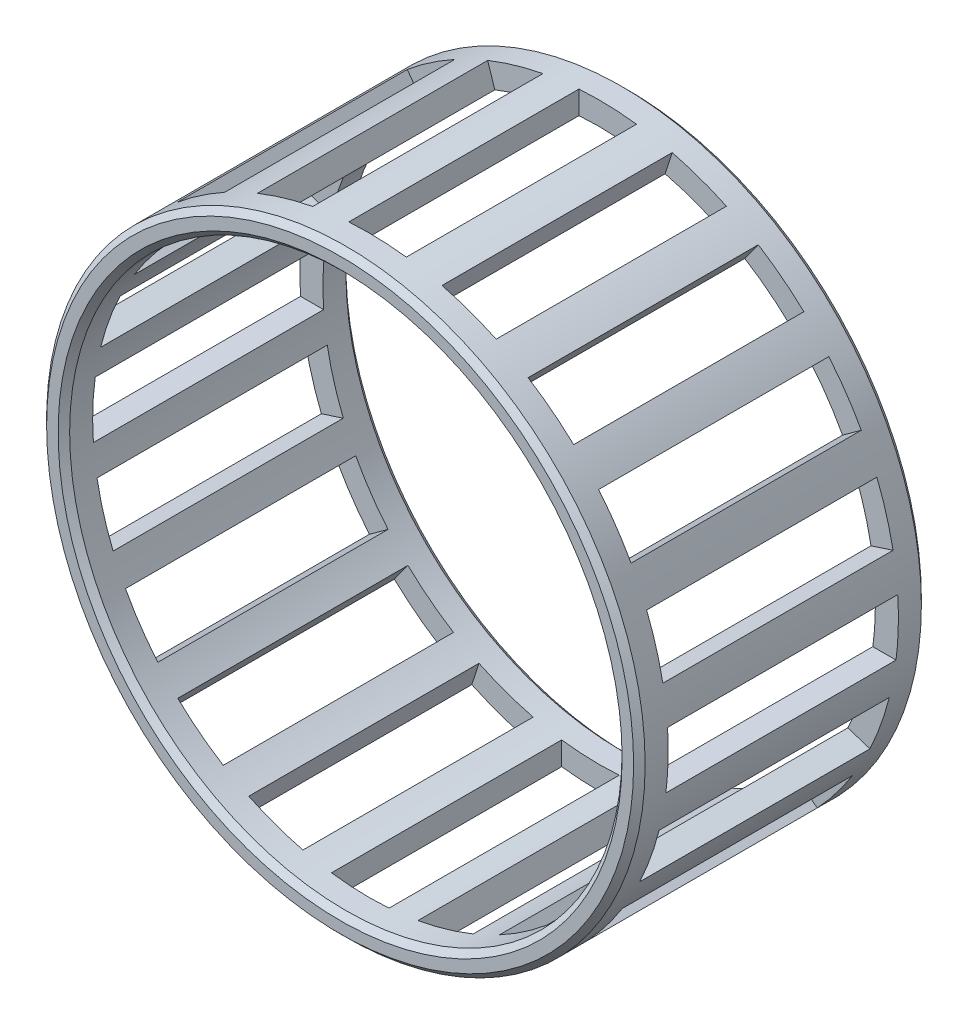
ISO-10303-21;
HEADER;
FILE_DESCRIPTION(('STEP AP214'),'2;1');
FILE_NAME('part.step','',(''),(''),'','','');
FILE_SCHEMA(('AUTOMOTIVE_DESIGN { 1 0 10303 214 1 1 1 1 }'));
ENDSEC;
DATA;
#1=APPLICATION_CONTEXT('core data for automotive mechanical design processes');
#2=APPLICATION_PROTOCOL_DEFINITION('international standard','automotive_design',2000,#1);
#3=PRODUCT_CONTEXT('',#1,'mechanical');
#4=PRODUCT('Part','Part','',(#3));
#5=PRODUCT_RELATED_PRODUCT_CATEGORY('part','',(#4));
#6=PRODUCT_DEFINITION_FORMATION('','',#4);
#7=PRODUCT_DEFINITION_CONTEXT('part definition',#1,'design');
#8=PRODUCT_DEFINITION('design','',#6,#7);
#9=PRODUCT_DEFINITION_SHAPE('','',#8);
#10=(LENGTH_UNIT() NAMED_UNIT(*) SI_UNIT(.MILLI.,.METRE.));
#11=(NAMED_UNIT(*) PLANE_ANGLE_UNIT() SI_UNIT($,.RADIAN.));
#12=(NAMED_UNIT(*) SI_UNIT($,.STERADIAN.) SOLID_ANGLE_UNIT());
#13=UNCERTAINTY_MEASURE_WITH_UNIT(LENGTH_MEASURE(1.E-05),#10,'distance_accuracy_value','');
#14=(GEOMETRIC_REPRESENTATION_CONTEXT(3) GLOBAL_UNCERTAINTY_ASSIGNED_CONTEXT((#13)) GLOBAL_UNIT_ASSIGNED_CONTEXT((#10,
#11,#12)) REPRESENTATION_CONTEXT('',''));
#15=CARTESIAN_POINT('',(0.,0.,0.));
#16=DIRECTION('',(0.,0.,1.));
#17=DIRECTION('',(1.,0.,0.));
#18=AXIS2_PLACEMENT_3D('',#15,#16,#17);
#19=CARTESIAN_POINT('',(0.,0.,25.));
#20=DIRECTION('',(0.,0.,1.));
#21=DIRECTION('',(1.,0.,0.));
#22=AXIS2_PLACEMENT_3D('',#19,#20,#21);
#23=PLANE('',#22);
#24=CARTESIAN_POINT('',(0.,0.,25.));
#25=DIRECTION('',(0.,0.,1.));
#26=DIRECTION('',(1.,0.,0.));
#27=AXIS2_PLACEMENT_3D('',#24,#25,#26);
#28=CIRCLE('',#27,25.5);
#29=CARTESIAN_POINT('',(25.5,0.,25.));
#30=VERTEX_POINT('',#29);
#31=EDGE_CURVE('E1227',#30,#30,#28,.T.);
#32=ORIENTED_EDGE('',*,*,#31,.T.);
#33=EDGE_LOOP('',(#32));
#34=FACE_BOUND('',#33,.T.);
#35=CARTESIAN_POINT('',(0.,0.,25.));
#36=DIRECTION('',(0.,0.,1.));
#37=DIRECTION('',(1.,0.,0.));
#38=AXIS2_PLACEMENT_3D('',#35,#36,#37);
#39=CIRCLE('',#38,24.5);
#40=CARTESIAN_POINT('',(24.5,0.,25.));
#41=VERTEX_POINT('',#40);
#42=EDGE_CURVE('E1224',#41,#41,#39,.F.);
#43=ORIENTED_EDGE('',*,*,#42,.T.);
#44=EDGE_LOOP('',(#43));
#45=FACE_BOUND('',#44,.T.);
#46=ADVANCED_FACE('F34',(#34,#45),#23,.T.);
#47=CARTESIAN_POINT('',(0.,0.,0.));
#48=DIRECTION('',(0.,0.,1.));
#49=DIRECTION('',(1.,0.,0.));
#50=AXIS2_PLACEMENT_3D('',#47,#48,#49);
#51=PLANE('',#50);
#52=CARTESIAN_POINT('',(0.,0.,0.));
#53=DIRECTION('',(0.,0.,1.));
#54=DIRECTION('',(1.,0.,0.));
#55=AXIS2_PLACEMENT_3D('',#52,#53,#54);
#56=CIRCLE('',#55,25.5);
#57=CARTESIAN_POINT('',(25.5,0.,0.));
#58=VERTEX_POINT('',#57);
#59=EDGE_CURVE('E1221',#58,#58,#56,.F.);
#60=ORIENTED_EDGE('',*,*,#59,.T.);
#61=EDGE_LOOP('',(#60));
#62=FACE_BOUND('',#61,.T.);
#63=CARTESIAN_POINT('',(0.,0.,0.));
#64=DIRECTION('',(0.,0.,1.));
#65=DIRECTION('',(1.,0.,0.));
#66=AXIS2_PLACEMENT_3D('',#63,#64,#65);
#67=CIRCLE('',#66,24.5);
#68=CARTESIAN_POINT('',(24.5,0.,0.));
#69=VERTEX_POINT('',#68);
#70=EDGE_CURVE('E1218',#69,#69,#67,.T.);
#71=ORIENTED_EDGE('',*,*,#70,.T.);
#72=EDGE_LOOP('',(#71));
#73=FACE_BOUND('',#72,.T.);
#74=ADVANCED_FACE('F1238',(#62,#73),#51,.F.);
#75=CARTESIAN_POINT('',(0.,0.,25.));
#76=DIRECTION('',(0.,0.,-1.));
#77=DIRECTION('',(-1.,0.,0.));
#78=AXIS2_PLACEMENT_3D('',#75,#76,#77);
#79=CYLINDRICAL_SURFACE('',#78,26.);
#80=CARTESIAN_POINT('',(0.,0.,0.500000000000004));
#81=DIRECTION('',(0.,0.,1.));
#82=DIRECTION('',(1.,0.,0.));
#83=AXIS2_PLACEMENT_3D('',#80,#81,#82);
#84=CIRCLE('',#83,26.);
#85=CARTESIAN_POINT('',(26.,0.,0.500000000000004));
#86=VERTEX_POINT('',#85);
#87=EDGE_CURVE('E1215',#86,#86,#84,.T.);
#88=ORIENTED_EDGE('',*,*,#87,.T.);
#89=EDGE_LOOP('',(#88));
#90=FACE_BOUND('',#89,.T.);
#91=CARTESIAN_POINT('',(0.,0.,24.5));
#92=DIRECTION('',(0.,0.,1.));
#93=DIRECTION('',(1.,0.,0.));
#94=AXIS2_PLACEMENT_3D('',#91,#92,#93);
#95=CIRCLE('',#94,26.);
#96=CARTESIAN_POINT('',(26.,0.,24.5));
#97=VERTEX_POINT('',#96);
#98=EDGE_CURVE('E1212',#97,#97,#95,.F.);
#99=ORIENTED_EDGE('',*,*,#98,.T.);
#100=EDGE_LOOP('',(#99));
#101=FACE_BOUND('',#100,.T.);
#102=CARTESIAN_POINT('',(0.,0.,2.5));
#103=DIRECTION('',(0.,0.,-1.));
#104=DIRECTION('',(-1.,0.,0.));
#105=AXIS2_PLACEMENT_3D('',#102,#103,#104);
#106=CIRCLE('',#105,26.);
#107=CARTESIAN_POINT('',(4.88049197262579,-25.5378307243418,2.5));
#108=VERTEX_POINT('',#107);
#109=CARTESIAN_POINT('',(9.68057078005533,-24.1306143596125,2.5));
#110=VERTEX_POINT('',#109);
#111=EDGE_CURVE('E555',#108,#110,#106,.F.);
#112=ORIENTED_EDGE('',*,*,#111,.F.);
#113=DIRECTION('',(0.,0.,-1.));
#114=VECTOR('',#113,1.);
#115=CARTESIAN_POINT('',(4.8804919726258,-25.5378307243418,25.));
#116=LINE('',#115,#114);
#117=CARTESIAN_POINT('',(4.8804919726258,-25.5378307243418,22.5));
#118=VERTEX_POINT('',#117);
#119=EDGE_CURVE('E558',#118,#108,#116,.T.);
#120=ORIENTED_EDGE('',*,*,#119,.F.);
#121=CARTESIAN_POINT('',(0.,0.,22.5));
#122=DIRECTION('',(0.,0.,1.));
#123=DIRECTION('',(1.,0.,0.));
#124=AXIS2_PLACEMENT_3D('',#121,#122,#123);
#125=CIRCLE('',#124,26.);
#126=CARTESIAN_POINT('',(9.68057078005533,-24.1306143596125,22.5));
#127=VERTEX_POINT('',#126);
#128=EDGE_CURVE('E537',#127,#118,#125,.F.);
#129=ORIENTED_EDGE('',*,*,#128,.F.);
#130=DIRECTION('',(0.,0.,-1.));
#131=VECTOR('',#130,1.);
#132=CARTESIAN_POINT('',(9.68057078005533,-24.1306143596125,25.));
#133=LINE('',#132,#131);
#134=EDGE_CURVE('E49',#110,#127,#133,.F.);
#135=ORIENTED_EDGE('',*,*,#134,.F.);
#136=EDGE_LOOP('',(#112,#120,#129,#135));
#137=FACE_BOUND('',#136,.T.);
#138=CARTESIAN_POINT('',(0.,0.,2.5));
#139=DIRECTION('',(0.,0.,-1.));
#140=DIRECTION('',(-1.,0.,0.));
#141=AXIS2_PLACEMENT_3D('',#138,#139,#140);
#142=CIRCLE('',#141,26.);
#143=CARTESIAN_POINT('',(12.5332473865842,-22.779765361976,2.5));
#144=VERTEX_POINT('',#143);
#145=CARTESIAN_POINT('',(16.6635398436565,-19.9581171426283,2.5));
#146=VERTEX_POINT('',#145);
#147=EDGE_CURVE('E577',#144,#146,#142,.F.);
#148=ORIENTED_EDGE('',*,*,#147,.F.);
#149=DIRECTION('',(0.,0.,-1.));
#150=VECTOR('',#149,1.);
#151=CARTESIAN_POINT('',(12.5332473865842,-22.779765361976,25.));
#152=LINE('',#151,#150);
#153=CARTESIAN_POINT('',(12.5332473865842,-22.779765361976,22.5));
#154=VERTEX_POINT('',#153);
#155=EDGE_CURVE('E580',#154,#144,#152,.T.);
#156=ORIENTED_EDGE('',*,*,#155,.F.);
#157=CARTESIAN_POINT('',(0.,0.,22.5));
#158=DIRECTION('',(0.,0.,1.));
#159=DIRECTION('',(1.,0.,0.));
#160=AXIS2_PLACEMENT_3D('',#157,#158,#159);
#161=CIRCLE('',#160,26.);
#162=CARTESIAN_POINT('',(16.6635398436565,-19.9581171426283,22.5));
#163=VERTEX_POINT('',#162);
#164=EDGE_CURVE('E597',#163,#154,#161,.F.);
#165=ORIENTED_EDGE('',*,*,#164,.F.);
#166=DIRECTION('',(0.,0.,-1.));
#167=VECTOR('',#166,1.);
#168=CARTESIAN_POINT('',(16.6635398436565,-19.9581171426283,25.));
#169=LINE('',#168,#167);
#170=EDGE_CURVE('E575',#146,#163,#169,.F.);
#171=ORIENTED_EDGE('',*,*,#170,.F.);
#172=EDGE_LOOP('',(#148,#156,#165,#171));
#173=FACE_BOUND('',#172,.T.);
#174=CARTESIAN_POINT('',(0.,0.,2.5));
#175=DIRECTION('',(0.,0.,-1.));
#176=DIRECTION('',(-1.,0.,0.));
#177=AXIS2_PLACEMENT_3D('',#174,#175,#176);
#178=CIRCLE('',#177,26.);
#179=CARTESIAN_POINT('',(18.9591612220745,-17.7918578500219,2.5));
#180=VERTEX_POINT('',#179);
#181=CARTESIAN_POINT('',(22.0153655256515,-13.8319803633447,2.5));
#182=VERTEX_POINT('',#181);
#183=EDGE_CURVE('E611',#180,#182,#178,.F.);
#184=ORIENTED_EDGE('',*,*,#183,.F.);
#185=DIRECTION('',(0.,0.,-1.));
#186=VECTOR('',#185,1.);
#187=CARTESIAN_POINT('',(18.9591612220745,-17.7918578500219,25.));
#188=LINE('',#187,#186);
#189=CARTESIAN_POINT('',(18.9591612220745,-17.7918578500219,22.5));
#190=VERTEX_POINT('',#189);
#191=EDGE_CURVE('E614',#190,#180,#188,.T.);
#192=ORIENTED_EDGE('',*,*,#191,.F.);
#193=CARTESIAN_POINT('',(0.,0.,22.5));
#194=DIRECTION('',(0.,0.,1.));
#195=DIRECTION('',(1.,0.,0.));
#196=AXIS2_PLACEMENT_3D('',#193,#194,#195);
#197=CIRCLE('',#196,26.);
#198=CARTESIAN_POINT('',(22.0153655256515,-13.8319803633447,22.5));
#199=VERTEX_POINT('',#198);
#200=EDGE_CURVE('E631',#199,#190,#197,.F.);
#201=ORIENTED_EDGE('',*,*,#200,.F.);
#202=DIRECTION('',(0.,0.,-1.));
#203=VECTOR('',#202,1.);
#204=CARTESIAN_POINT('',(22.0153655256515,-13.8319803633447,25.));
#205=LINE('',#204,#203);
#206=EDGE_CURVE('E609',#182,#199,#205,.F.);
#207=ORIENTED_EDGE('',*,*,#206,.F.);
#208=EDGE_LOOP('',(#184,#192,#201,#207));
#209=FACE_BOUND('',#208,.T.);
#210=CARTESIAN_POINT('',(0.,0.,2.5));
#211=DIRECTION('',(0.,0.,-1.));
#212=DIRECTION('',(-1.,0.,0.));
#213=AXIS2_PLACEMENT_3D('',#210,#211,#212);
#214=CIRCLE('',#213,26.);
#215=CARTESIAN_POINT('',(23.5292202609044,-11.0623593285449,2.5));
#216=VERTEX_POINT('',#215);
#217=CARTESIAN_POINT('',(25.2121738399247,-6.35187297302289,2.5));
#218=VERTEX_POINT('',#217);
#219=EDGE_CURVE('E645',#216,#218,#214,.F.);
#220=ORIENTED_EDGE('',*,*,#219,.F.);
#221=DIRECTION('',(0.,0.,-1.));
#222=VECTOR('',#221,1.);
#223=CARTESIAN_POINT('',(23.5292202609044,-11.0623593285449,25.));
#224=LINE('',#223,#222);
#225=CARTESIAN_POINT('',(23.5292202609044,-11.0623593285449,22.5));
#226=VERTEX_POINT('',#225);
#227=EDGE_CURVE('E648',#226,#216,#224,.T.);
#228=ORIENTED_EDGE('',*,*,#227,.F.);
#229=CARTESIAN_POINT('',(0.,0.,22.5));
#230=DIRECTION('',(0.,0.,1.));
#231=DIRECTION('',(1.,0.,0.));
#232=AXIS2_PLACEMENT_3D('',#229,#230,#231);
#233=CIRCLE('',#232,26.);
#234=CARTESIAN_POINT('',(25.2121738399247,-6.35187297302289,22.5));
#235=VERTEX_POINT('',#234);
#236=EDGE_CURVE('E665',#235,#226,#233,.F.);
#237=ORIENTED_EDGE('',*,*,#236,.F.);
#238=DIRECTION('',(0.,0.,-1.));
#239=VECTOR('',#238,1.);
#240=CARTESIAN_POINT('',(25.2121738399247,-6.35187297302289,25.));
#241=LINE('',#240,#239);
#242=EDGE_CURVE('E643',#218,#235,#241,.F.);
#243=ORIENTED_EDGE('',*,*,#242,.F.);
#244=EDGE_LOOP('',(#220,#228,#237,#243));
#245=FACE_BOUND('',#244,.T.);
#246=CARTESIAN_POINT('',(0.,0.,2.5));
#247=DIRECTION('',(0.,0.,-1.));
#248=DIRECTION('',(-1.,0.,0.));
#249=AXIS2_PLACEMENT_3D('',#246,#247,#248);
#250=CIRCLE('',#249,26.);
#251=CARTESIAN_POINT('',(25.7960752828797,-3.25000000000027,2.5));
#252=VERTEX_POINT('',#251);
#253=CARTESIAN_POINT('',(25.9410389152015,1.74999999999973,2.5));
#254=VERTEX_POINT('',#253);
#255=EDGE_CURVE('E679',#252,#254,#250,.F.);
#256=ORIENTED_EDGE('',*,*,#255,.F.);
#257=DIRECTION('',(0.,0.,-1.));
#258=VECTOR('',#257,1.);
#259=CARTESIAN_POINT('',(25.7960752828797,-3.25000000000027,25.));
#260=LINE('',#259,#258);
#261=CARTESIAN_POINT('',(25.7960752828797,-3.25000000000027,22.5));
#262=VERTEX_POINT('',#261);
#263=EDGE_CURVE('E682',#262,#252,#260,.T.);
#264=ORIENTED_EDGE('',*,*,#263,.F.);
#265=CARTESIAN_POINT('',(0.,0.,22.5));
#266=DIRECTION('',(0.,0.,1.));
#267=DIRECTION('',(1.,0.,0.));
#268=AXIS2_PLACEMENT_3D('',#265,#266,#267);
#269=CIRCLE('',#268,26.);
#270=CARTESIAN_POINT('',(25.9410389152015,1.74999999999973,22.5));
#271=VERTEX_POINT('',#270);
#272=EDGE_CURVE('E699',#271,#262,#269,.F.);
#273=ORIENTED_EDGE('',*,*,#272,.F.);
#274=DIRECTION('',(0.,0.,-1.));
#275=VECTOR('',#274,1.);
#276=CARTESIAN_POINT('',(25.9410389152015,1.74999999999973,25.));
#277=LINE('',#276,#275);
#278=EDGE_CURVE('E677',#254,#271,#277,.F.);
#279=ORIENTED_EDGE('',*,*,#278,.F.);
#280=EDGE_LOOP('',(#256,#264,#273,#279));
#281=FACE_BOUND('',#280,.T.);
#282=CARTESIAN_POINT('',(0.,0.,2.5));
#283=DIRECTION('',(0.,0.,-1.));
#284=DIRECTION('',(-1.,0.,0.));
#285=AXIS2_PLACEMENT_3D('',#282,#283,#284);
#286=CIRCLE('',#285,26.);
#287=CARTESIAN_POINT('',(25.5378307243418,4.88049197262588,2.5));
#288=VERTEX_POINT('',#287);
#289=CARTESIAN_POINT('',(24.1306143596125,9.68057078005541,2.5));
#290=VERTEX_POINT('',#289);
#291=EDGE_CURVE('E713',#288,#290,#286,.F.);
#292=ORIENTED_EDGE('',*,*,#291,.F.);
#293=DIRECTION('',(0.,0.,-1.));
#294=VECTOR('',#293,1.);
#295=CARTESIAN_POINT('',(25.5378307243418,4.88049197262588,25.));
#296=LINE('',#295,#294);
#297=CARTESIAN_POINT('',(25.5378307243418,4.88049197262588,22.5));
#298=VERTEX_POINT('',#297);
#299=EDGE_CURVE('E716',#298,#288,#296,.T.);
#300=ORIENTED_EDGE('',*,*,#299,.F.);
#301=CARTESIAN_POINT('',(0.,0.,22.5));
#302=DIRECTION('',(0.,0.,1.));
#303=DIRECTION('',(1.,0.,0.));
#304=AXIS2_PLACEMENT_3D('',#301,#302,#303);
#305=CIRCLE('',#304,26.);
#306=CARTESIAN_POINT('',(24.1306143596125,9.68057078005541,22.5));
#307=VERTEX_POINT('',#306);
#308=EDGE_CURVE('E733',#307,#298,#305,.F.);
#309=ORIENTED_EDGE('',*,*,#308,.F.);
#310=DIRECTION('',(0.,0.,-1.));
#311=VECTOR('',#310,1.);
#312=CARTESIAN_POINT('',(24.1306143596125,9.68057078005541,25.));
#313=LINE('',#312,#311);
#314=EDGE_CURVE('E711',#290,#307,#313,.F.);
#315=ORIENTED_EDGE('',*,*,#314,.F.);
#316=EDGE_LOOP('',(#292,#300,#309,#315));
#317=FACE_BOUND('',#316,.T.);
#318=CARTESIAN_POINT('',(0.,0.,2.5));
#319=DIRECTION('',(0.,0.,-1.));
#320=DIRECTION('',(-1.,0.,0.));
#321=AXIS2_PLACEMENT_3D('',#318,#319,#320);
#322=CIRCLE('',#321,26.);
#323=CARTESIAN_POINT('',(22.7797653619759,12.5332473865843,2.5));
#324=VERTEX_POINT('',#323);
#325=CARTESIAN_POINT('',(19.9581171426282,16.6635398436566,2.5));
#326=VERTEX_POINT('',#325);
#327=EDGE_CURVE('E747',#324,#326,#322,.F.);
#328=ORIENTED_EDGE('',*,*,#327,.F.);
#329=DIRECTION('',(0.,0.,-1.));
#330=VECTOR('',#329,1.);
#331=CARTESIAN_POINT('',(22.7797653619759,12.5332473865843,25.));
#332=LINE('',#331,#330);
#333=CARTESIAN_POINT('',(22.7797653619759,12.5332473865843,22.5));
#334=VERTEX_POINT('',#333);
#335=EDGE_CURVE('E750',#334,#324,#332,.T.);
#336=ORIENTED_EDGE('',*,*,#335,.F.);
#337=CARTESIAN_POINT('',(0.,0.,22.5));
#338=DIRECTION('',(0.,0.,1.));
#339=DIRECTION('',(1.,0.,0.));
#340=AXIS2_PLACEMENT_3D('',#337,#338,#339);
#341=CIRCLE('',#340,26.);
#342=CARTESIAN_POINT('',(19.9581171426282,16.6635398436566,22.5));
#343=VERTEX_POINT('',#342);
#344=EDGE_CURVE('E767',#343,#334,#341,.F.);
#345=ORIENTED_EDGE('',*,*,#344,.F.);
#346=DIRECTION('',(0.,0.,-1.));
#347=VECTOR('',#346,1.);
#348=CARTESIAN_POINT('',(19.9581171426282,16.6635398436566,25.));
#349=LINE('',#348,#347);
#350=EDGE_CURVE('E745',#326,#343,#349,.F.);
#351=ORIENTED_EDGE('',*,*,#350,.F.);
#352=EDGE_LOOP('',(#328,#336,#345,#351));
#353=FACE_BOUND('',#352,.T.);
#354=CARTESIAN_POINT('',(0.,0.,2.5));
#355=DIRECTION('',(0.,0.,-1.));
#356=DIRECTION('',(-1.,0.,0.));
#357=AXIS2_PLACEMENT_3D('',#354,#355,#356);
#358=CIRCLE('',#357,26.);
#359=CARTESIAN_POINT('',(17.7918578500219,18.9591612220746,2.5));
#360=VERTEX_POINT('',#359);
#361=CARTESIAN_POINT('',(13.8319803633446,22.0153655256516,2.5));
#362=VERTEX_POINT('',#361);
#363=EDGE_CURVE('E781',#360,#362,#358,.F.);
#364=ORIENTED_EDGE('',*,*,#363,.F.);
#365=DIRECTION('',(0.,0.,-1.));
#366=VECTOR('',#365,1.);
#367=CARTESIAN_POINT('',(17.7918578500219,18.9591612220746,25.));
#368=LINE('',#367,#366);
#369=CARTESIAN_POINT('',(17.7918578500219,18.9591612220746,22.5));
#370=VERTEX_POINT('',#369);
#371=EDGE_CURVE('E784',#370,#360,#368,.T.);
#372=ORIENTED_EDGE('',*,*,#371,.F.);
#373=CARTESIAN_POINT('',(0.,0.,22.5));
#374=DIRECTION('',(0.,0.,1.));
#375=DIRECTION('',(1.,0.,0.));
#376=AXIS2_PLACEMENT_3D('',#373,#374,#375);
#377=CIRCLE('',#376,26.);
#378=CARTESIAN_POINT('',(13.8319803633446,22.0153655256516,22.5));
#379=VERTEX_POINT('',#378);
#380=EDGE_CURVE('E801',#379,#370,#377,.F.);
#381=ORIENTED_EDGE('',*,*,#380,.F.);
#382=DIRECTION('',(0.,0.,-1.));
#383=VECTOR('',#382,1.);
#384=CARTESIAN_POINT('',(13.8319803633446,22.0153655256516,25.));
#385=LINE('',#384,#383);
#386=EDGE_CURVE('E779',#362,#379,#385,.F.);
#387=ORIENTED_EDGE('',*,*,#386,.F.);
#388=EDGE_LOOP('',(#364,#372,#381,#387));
#389=FACE_BOUND('',#388,.T.);
#390=CARTESIAN_POINT('',(0.,0.,2.5));
#391=DIRECTION('',(0.,0.,-1.));
#392=DIRECTION('',(-1.,0.,0.));
#393=AXIS2_PLACEMENT_3D('',#390,#391,#392);
#394=CIRCLE('',#393,26.);
#395=CARTESIAN_POINT('',(11.0623593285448,23.5292202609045,2.5));
#396=VERTEX_POINT('',#395);
#397=CARTESIAN_POINT('',(6.3518729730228,25.2121738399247,2.5));
#398=VERTEX_POINT('',#397);
#399=EDGE_CURVE('E815',#396,#398,#394,.F.);
#400=ORIENTED_EDGE('',*,*,#399,.F.);
#401=DIRECTION('',(0.,0.,-1.));
#402=VECTOR('',#401,1.);
#403=CARTESIAN_POINT('',(11.0623593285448,23.5292202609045,25.));
#404=LINE('',#403,#402);
#405=CARTESIAN_POINT('',(11.0623593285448,23.5292202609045,22.5));
#406=VERTEX_POINT('',#405);
#407=EDGE_CURVE('E818',#406,#396,#404,.T.);
#408=ORIENTED_EDGE('',*,*,#407,.F.);
#409=CARTESIAN_POINT('',(0.,0.,22.5));
#410=DIRECTION('',(0.,0.,1.));
#411=DIRECTION('',(1.,0.,0.));
#412=AXIS2_PLACEMENT_3D('',#409,#410,#411);
#413=CIRCLE('',#412,26.);
#414=CARTESIAN_POINT('',(6.3518729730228,25.2121738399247,22.5));
#415=VERTEX_POINT('',#414);
#416=EDGE_CURVE('E835',#415,#406,#413,.F.);
#417=ORIENTED_EDGE('',*,*,#416,.F.);
#418=DIRECTION('',(0.,0.,-1.));
#419=VECTOR('',#418,1.);
#420=CARTESIAN_POINT('',(6.3518729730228,25.2121738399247,25.));
#421=LINE('',#420,#419);
#422=EDGE_CURVE('E813',#398,#415,#421,.F.);
#423=ORIENTED_EDGE('',*,*,#422,.F.);
#424=EDGE_LOOP('',(#400,#408,#417,#423));
#425=FACE_BOUND('',#424,.T.);
#426=CARTESIAN_POINT('',(0.,0.,2.5));
#427=DIRECTION('',(0.,0.,-1.));
#428=DIRECTION('',(-1.,0.,0.));
#429=AXIS2_PLACEMENT_3D('',#426,#427,#428);
#430=CIRCLE('',#429,26.);
#431=CARTESIAN_POINT('',(3.25000000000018,25.7960752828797,2.5));
#432=VERTEX_POINT('',#431);
#433=CARTESIAN_POINT('',(-1.74999999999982,25.9410389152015,2.5));
#434=VERTEX_POINT('',#433);
#435=EDGE_CURVE('E849',#432,#434,#430,.F.);
#436=ORIENTED_EDGE('',*,*,#435,.F.);
#437=DIRECTION('',(0.,0.,-1.));
#438=VECTOR('',#437,1.);
#439=CARTESIAN_POINT('',(3.25000000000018,25.7960752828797,25.));
#440=LINE('',#439,#438);
#441=CARTESIAN_POINT('',(3.25000000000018,25.7960752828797,22.5));
#442=VERTEX_POINT('',#441);
#443=EDGE_CURVE('E852',#442,#432,#440,.T.);
#444=ORIENTED_EDGE('',*,*,#443,.F.);
#445=CARTESIAN_POINT('',(0.,0.,22.5));
#446=DIRECTION('',(0.,0.,1.));
#447=DIRECTION('',(1.,0.,0.));
#448=AXIS2_PLACEMENT_3D('',#445,#446,#447);
#449=CIRCLE('',#448,26.);
#450=CARTESIAN_POINT('',(-1.74999999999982,25.9410389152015,22.5));
#451=VERTEX_POINT('',#450);
#452=EDGE_CURVE('E869',#451,#442,#449,.F.);
#453=ORIENTED_EDGE('',*,*,#452,.F.);
#454=DIRECTION('',(0.,0.,-1.));
#455=VECTOR('',#454,1.);
#456=CARTESIAN_POINT('',(-1.74999999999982,25.9410389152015,25.));
#457=LINE('',#456,#455);
#458=EDGE_CURVE('E847',#434,#451,#457,.F.);
#459=ORIENTED_EDGE('',*,*,#458,.F.);
#460=EDGE_LOOP('',(#436,#444,#453,#459));
#461=FACE_BOUND('',#460,.T.);
#462=CARTESIAN_POINT('',(0.,0.,2.5));
#463=DIRECTION('',(0.,0.,-1.));
#464=DIRECTION('',(-1.,0.,0.));
#465=AXIS2_PLACEMENT_3D('',#462,#463,#464);
#466=CIRCLE('',#465,26.);
#467=CARTESIAN_POINT('',(-4.88049197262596,25.5378307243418,2.5));
#468=VERTEX_POINT('',#467);
#469=CARTESIAN_POINT('',(-9.68057078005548,24.1306143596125,2.5));
#470=VERTEX_POINT('',#469);
#471=EDGE_CURVE('E883',#468,#470,#466,.F.);
#472=ORIENTED_EDGE('',*,*,#471,.F.);
#473=DIRECTION('',(0.,0.,-1.));
#474=VECTOR('',#473,1.);
#475=CARTESIAN_POINT('',(-4.88049197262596,25.5378307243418,25.));
#476=LINE('',#475,#474);
#477=CARTESIAN_POINT('',(-4.88049197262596,25.5378307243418,22.5));
#478=VERTEX_POINT('',#477);
#479=EDGE_CURVE('E886',#478,#468,#476,.T.);
#480=ORIENTED_EDGE('',*,*,#479,.F.);
#481=CARTESIAN_POINT('',(0.,0.,22.5));
#482=DIRECTION('',(0.,0.,1.));
#483=DIRECTION('',(1.,0.,0.));
#484=AXIS2_PLACEMENT_3D('',#481,#482,#483);
#485=CIRCLE('',#484,26.);
#486=CARTESIAN_POINT('',(-9.68057078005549,24.1306143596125,22.5));
#487=VERTEX_POINT('',#486);
#488=EDGE_CURVE('E903',#487,#478,#485,.F.);
#489=ORIENTED_EDGE('',*,*,#488,.F.);
#490=DIRECTION('',(0.,0.,-1.));
#491=VECTOR('',#490,1.);
#492=CARTESIAN_POINT('',(-9.68057078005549,24.1306143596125,25.));
#493=LINE('',#492,#491);
#494=EDGE_CURVE('E881',#470,#487,#493,.F.);
#495=ORIENTED_EDGE('',*,*,#494,.F.);
#496=EDGE_LOOP('',(#472,#480,#489,#495));
#497=FACE_BOUND('',#496,.T.);
#498=CARTESIAN_POINT('',(0.,0.,2.5));
#499=DIRECTION('',(0.,0.,-1.));
#500=DIRECTION('',(-1.,0.,0.));
#501=AXIS2_PLACEMENT_3D('',#498,#499,#500);
#502=CIRCLE('',#501,26.);
#503=CARTESIAN_POINT('',(-12.5332473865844,22.7797653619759,2.5));
#504=VERTEX_POINT('',#503);
#505=CARTESIAN_POINT('',(-16.6635398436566,19.9581171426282,2.5));
#506=VERTEX_POINT('',#505);
#507=EDGE_CURVE('E917',#504,#506,#502,.F.);
#508=ORIENTED_EDGE('',*,*,#507,.F.);
#509=DIRECTION('',(0.,0.,-1.));
#510=VECTOR('',#509,1.);
#511=CARTESIAN_POINT('',(-12.5332473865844,22.7797653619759,25.));
#512=LINE('',#511,#510);
#513=CARTESIAN_POINT('',(-12.5332473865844,22.7797653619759,22.5));
#514=VERTEX_POINT('',#513);
#515=EDGE_CURVE('E920',#514,#504,#512,.T.);
#516=ORIENTED_EDGE('',*,*,#515,.F.);
#517=CARTESIAN_POINT('',(0.,0.,22.5));
#518=DIRECTION('',(0.,0.,1.));
#519=DIRECTION('',(1.,0.,0.));
#520=AXIS2_PLACEMENT_3D('',#517,#518,#519);
#521=CIRCLE('',#520,26.);
#522=CARTESIAN_POINT('',(-16.6635398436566,19.9581171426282,22.5));
#523=VERTEX_POINT('',#522);
#524=EDGE_CURVE('E937',#523,#514,#521,.F.);
#525=ORIENTED_EDGE('',*,*,#524,.F.);
#526=DIRECTION('',(0.,0.,-1.));
#527=VECTOR('',#526,1.);
#528=CARTESIAN_POINT('',(-16.6635398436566,19.9581171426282,25.));
#529=LINE('',#528,#527);
#530=EDGE_CURVE('E915',#506,#523,#529,.F.);
#531=ORIENTED_EDGE('',*,*,#530,.F.);
#532=EDGE_LOOP('',(#508,#516,#525,#531));
#533=FACE_BOUND('',#532,.T.);
#534=CARTESIAN_POINT('',(0.,0.,2.5));
#535=DIRECTION('',(0.,0.,-1.));
#536=DIRECTION('',(-1.,0.,0.));
#537=AXIS2_PLACEMENT_3D('',#534,#535,#536);
#538=CIRCLE('',#537,26.);
#539=CARTESIAN_POINT('',(-18.9591612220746,17.7918578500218,2.5));
#540=VERTEX_POINT('',#539);
#541=CARTESIAN_POINT('',(-22.0153655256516,13.8319803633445,2.5));
#542=VERTEX_POINT('',#541);
#543=EDGE_CURVE('E951',#540,#542,#538,.F.);
#544=ORIENTED_EDGE('',*,*,#543,.F.);
#545=DIRECTION('',(0.,0.,-1.));
#546=VECTOR('',#545,1.);
#547=CARTESIAN_POINT('',(-18.9591612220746,17.7918578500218,25.));
#548=LINE('',#547,#546);
#549=CARTESIAN_POINT('',(-18.9591612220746,17.7918578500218,22.5));
#550=VERTEX_POINT('',#549);
#551=EDGE_CURVE('E954',#550,#540,#548,.T.);
#552=ORIENTED_EDGE('',*,*,#551,.F.);
#553=CARTESIAN_POINT('',(0.,0.,22.5));
#554=DIRECTION('',(0.,0.,1.));
#555=DIRECTION('',(1.,0.,0.));
#556=AXIS2_PLACEMENT_3D('',#553,#554,#555);
#557=CIRCLE('',#556,26.);
#558=CARTESIAN_POINT('',(-22.0153655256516,13.8319803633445,22.5));
#559=VERTEX_POINT('',#558);
#560=EDGE_CURVE('E971',#559,#550,#557,.F.);
#561=ORIENTED_EDGE('',*,*,#560,.F.);
#562=DIRECTION('',(0.,0.,-1.));
#563=VECTOR('',#562,1.);
#564=CARTESIAN_POINT('',(-22.0153655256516,13.8319803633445,25.));
#565=LINE('',#564,#563);
#566=EDGE_CURVE('E949',#542,#559,#565,.F.);
#567=ORIENTED_EDGE('',*,*,#566,.F.);
#568=EDGE_LOOP('',(#544,#552,#561,#567));
#569=FACE_BOUND('',#568,.T.);
#570=CARTESIAN_POINT('',(0.,0.,2.5));
#571=DIRECTION('',(0.,0.,-1.));
#572=DIRECTION('',(-1.,0.,0.));
#573=AXIS2_PLACEMENT_3D('',#570,#571,#572);
#574=CIRCLE('',#573,26.);
#575=CARTESIAN_POINT('',(-23.5292202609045,11.0623593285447,2.5));
#576=VERTEX_POINT('',#575);
#577=CARTESIAN_POINT('',(-25.2121738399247,6.35187297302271,2.5));
#578=VERTEX_POINT('',#577);
#579=EDGE_CURVE('E985',#576,#578,#574,.F.);
#580=ORIENTED_EDGE('',*,*,#579,.F.);
#581=DIRECTION('',(0.,0.,-1.));
#582=VECTOR('',#581,1.);
#583=CARTESIAN_POINT('',(-23.5292202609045,11.0623593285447,25.));
#584=LINE('',#583,#582);
#585=CARTESIAN_POINT('',(-23.5292202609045,11.0623593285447,22.5));
#586=VERTEX_POINT('',#585);
#587=EDGE_CURVE('E988',#586,#576,#584,.T.);
#588=ORIENTED_EDGE('',*,*,#587,.F.);
#589=CARTESIAN_POINT('',(0.,0.,22.5));
#590=DIRECTION('',(0.,0.,1.));
#591=DIRECTION('',(1.,0.,0.));
#592=AXIS2_PLACEMENT_3D('',#589,#590,#591);
#593=CIRCLE('',#592,26.);
#594=CARTESIAN_POINT('',(-25.2121738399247,6.35187297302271,22.5));
#595=VERTEX_POINT('',#594);
#596=EDGE_CURVE('E1005',#595,#586,#593,.F.);
#597=ORIENTED_EDGE('',*,*,#596,.F.);
#598=DIRECTION('',(0.,0.,-1.));
#599=VECTOR('',#598,1.);
#600=CARTESIAN_POINT('',(-25.2121738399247,6.35187297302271,25.));
#601=LINE('',#600,#599);
#602=EDGE_CURVE('E983',#578,#595,#601,.F.);
#603=ORIENTED_EDGE('',*,*,#602,.F.);
#604=EDGE_LOOP('',(#580,#588,#597,#603));
#605=FACE_BOUND('',#604,.T.);
#606=CARTESIAN_POINT('',(0.,0.,2.5));
#607=DIRECTION('',(0.,0.,-1.));
#608=DIRECTION('',(-1.,0.,0.));
#609=AXIS2_PLACEMENT_3D('',#606,#607,#608);
#610=CIRCLE('',#609,26.);
#611=CARTESIAN_POINT('',(-25.7960752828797,3.25000000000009,2.5));
#612=VERTEX_POINT('',#611);
#613=CARTESIAN_POINT('',(-25.9410389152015,-1.74999999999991,2.5));
#614=VERTEX_POINT('',#613);
#615=EDGE_CURVE('E1019',#612,#614,#610,.F.);
#616=ORIENTED_EDGE('',*,*,#615,.F.);
#617=DIRECTION('',(0.,0.,-1.));
#618=VECTOR('',#617,1.);
#619=CARTESIAN_POINT('',(-25.7960752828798,3.25000000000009,25.));
#620=LINE('',#619,#618);
#621=CARTESIAN_POINT('',(-25.7960752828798,3.25000000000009,22.5));
#622=VERTEX_POINT('',#621);
#623=EDGE_CURVE('E1022',#622,#612,#620,.T.);
#624=ORIENTED_EDGE('',*,*,#623,.F.);
#625=CARTESIAN_POINT('',(0.,0.,22.5));
#626=DIRECTION('',(0.,0.,1.));
#627=DIRECTION('',(1.,0.,0.));
#628=AXIS2_PLACEMENT_3D('',#625,#626,#627);
#629=CIRCLE('',#628,26.);
#630=CARTESIAN_POINT('',(-25.9410389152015,-1.74999999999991,22.5));
#631=VERTEX_POINT('',#630);
#632=EDGE_CURVE('E1039',#631,#622,#629,.F.);
#633=ORIENTED_EDGE('',*,*,#632,.F.);
#634=DIRECTION('',(0.,0.,-1.));
#635=VECTOR('',#634,1.);
#636=CARTESIAN_POINT('',(-25.9410389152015,-1.74999999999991,25.));
#637=LINE('',#636,#635);
#638=EDGE_CURVE('E1017',#614,#631,#637,.F.);
#639=ORIENTED_EDGE('',*,*,#638,.F.);
#640=EDGE_LOOP('',(#616,#624,#633,#639));
#641=FACE_BOUND('',#640,.T.);
#642=CARTESIAN_POINT('',(0.,0.,2.5));
#643=DIRECTION('',(0.,0.,-1.));
#644=DIRECTION('',(-1.,0.,0.));
#645=AXIS2_PLACEMENT_3D('',#642,#643,#644);
#646=CIRCLE('',#645,26.);
#647=CARTESIAN_POINT('',(-25.5378307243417,-4.88049197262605,2.5));
#648=VERTEX_POINT('',#647);
#649=CARTESIAN_POINT('',(-24.1306143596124,-9.68057078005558,2.5));
#650=VERTEX_POINT('',#649);
#651=EDGE_CURVE('E1053',#648,#650,#646,.F.);
#652=ORIENTED_EDGE('',*,*,#651,.F.);
#653=DIRECTION('',(0.,0.,-1.));
#654=VECTOR('',#653,1.);
#655=CARTESIAN_POINT('',(-25.5378307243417,-4.88049197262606,25.));
#656=LINE('',#655,#654);
#657=CARTESIAN_POINT('',(-25.5378307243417,-4.88049197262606,22.5));
#658=VERTEX_POINT('',#657);
#659=EDGE_CURVE('E1056',#658,#648,#656,.T.);
#660=ORIENTED_EDGE('',*,*,#659,.F.);
#661=CARTESIAN_POINT('',(0.,0.,22.5));
#662=DIRECTION('',(0.,0.,1.));
#663=DIRECTION('',(1.,0.,0.));
#664=AXIS2_PLACEMENT_3D('',#661,#662,#663);
#665=CIRCLE('',#664,26.);
#666=CARTESIAN_POINT('',(-24.1306143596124,-9.68057078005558,22.5));
#667=VERTEX_POINT('',#666);
#668=EDGE_CURVE('E1073',#667,#658,#665,.F.);
#669=ORIENTED_EDGE('',*,*,#668,.F.);
#670=DIRECTION('',(0.,0.,-1.));
#671=VECTOR('',#670,1.);
#672=CARTESIAN_POINT('',(-24.1306143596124,-9.68057078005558,25.));
#673=LINE('',#672,#671);
#674=EDGE_CURVE('E1051',#650,#667,#673,.F.);
#675=ORIENTED_EDGE('',*,*,#674,.F.);
#676=EDGE_LOOP('',(#652,#660,#669,#675));
#677=FACE_BOUND('',#676,.T.);
#678=CARTESIAN_POINT('',(0.,0.,2.5));
#679=DIRECTION('',(0.,0.,-1.));
#680=DIRECTION('',(-1.,0.,0.));
#681=AXIS2_PLACEMENT_3D('',#678,#679,#680);
#682=CIRCLE('',#681,26.);
#683=CARTESIAN_POINT('',(-22.7797653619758,-12.5332473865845,2.5));
#684=VERTEX_POINT('',#683);
#685=CARTESIAN_POINT('',(-19.9581171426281,-16.6635398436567,2.5));
#686=VERTEX_POINT('',#685);
#687=EDGE_CURVE('E1087',#684,#686,#682,.F.);
#688=ORIENTED_EDGE('',*,*,#687,.F.);
#689=DIRECTION('',(0.,0.,-1.));
#690=VECTOR('',#689,1.);
#691=CARTESIAN_POINT('',(-22.7797653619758,-12.5332473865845,25.));
#692=LINE('',#691,#690);
#693=CARTESIAN_POINT('',(-22.7797653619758,-12.5332473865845,22.5));
#694=VERTEX_POINT('',#693);
#695=EDGE_CURVE('E1090',#694,#684,#692,.T.);
#696=ORIENTED_EDGE('',*,*,#695,.F.);
#697=CARTESIAN_POINT('',(0.,0.,22.5));
#698=DIRECTION('',(0.,0.,1.));
#699=DIRECTION('',(1.,0.,0.));
#700=AXIS2_PLACEMENT_3D('',#697,#698,#699);
#701=CIRCLE('',#700,26.);
#702=CARTESIAN_POINT('',(-19.9581171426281,-16.6635398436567,22.5));
#703=VERTEX_POINT('',#702);
#704=EDGE_CURVE('E1107',#703,#694,#701,.F.);
#705=ORIENTED_EDGE('',*,*,#704,.F.);
#706=DIRECTION('',(0.,0.,-1.));
#707=VECTOR('',#706,1.);
#708=CARTESIAN_POINT('',(-19.9581171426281,-16.6635398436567,25.));
#709=LINE('',#708,#707);
#710=EDGE_CURVE('E1085',#686,#703,#709,.F.);
#711=ORIENTED_EDGE('',*,*,#710,.F.);
#712=EDGE_LOOP('',(#688,#696,#705,#711));
#713=FACE_BOUND('',#712,.T.);
#714=CARTESIAN_POINT('',(0.,0.,2.5));
#715=DIRECTION('',(0.,0.,-1.));
#716=DIRECTION('',(-1.,0.,0.));
#717=AXIS2_PLACEMENT_3D('',#714,#715,#716);
#718=CIRCLE('',#717,26.);
#719=CARTESIAN_POINT('',(-17.7918578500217,-18.9591612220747,2.5));
#720=VERTEX_POINT('',#719);
#721=CARTESIAN_POINT('',(-13.8319803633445,-22.0153655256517,2.5));
#722=VERTEX_POINT('',#721);
#723=EDGE_CURVE('E1121',#720,#722,#718,.F.);
#724=ORIENTED_EDGE('',*,*,#723,.F.);
#725=DIRECTION('',(0.,0.,-1.));
#726=VECTOR('',#725,1.);
#727=CARTESIAN_POINT('',(-17.7918578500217,-18.9591612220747,25.));
#728=LINE('',#727,#726);
#729=CARTESIAN_POINT('',(-17.7918578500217,-18.9591612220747,22.5));
#730=VERTEX_POINT('',#729);
#731=EDGE_CURVE('E1124',#730,#720,#728,.T.);
#732=ORIENTED_EDGE('',*,*,#731,.F.);
#733=CARTESIAN_POINT('',(0.,0.,22.5));
#734=DIRECTION('',(0.,0.,1.));
#735=DIRECTION('',(1.,0.,0.));
#736=AXIS2_PLACEMENT_3D('',#733,#734,#735);
#737=CIRCLE('',#736,26.);
#738=CARTESIAN_POINT('',(-13.8319803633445,-22.0153655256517,22.5));
#739=VERTEX_POINT('',#738);
#740=EDGE_CURVE('E1141',#739,#730,#737,.F.);
#741=ORIENTED_EDGE('',*,*,#740,.F.);
#742=DIRECTION('',(0.,0.,-1.));
#743=VECTOR('',#742,1.);
#744=CARTESIAN_POINT('',(-13.8319803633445,-22.0153655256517,25.));
#745=LINE('',#744,#743);
#746=EDGE_CURVE('E1119',#722,#739,#745,.F.);
#747=ORIENTED_EDGE('',*,*,#746,.F.);
#748=EDGE_LOOP('',(#724,#732,#741,#747));
#749=FACE_BOUND('',#748,.T.);
#750=CARTESIAN_POINT('',(0.,0.,2.5));
#751=DIRECTION('',(0.,0.,-1.));
#752=DIRECTION('',(-1.,0.,0.));
#753=AXIS2_PLACEMENT_3D('',#750,#751,#752);
#754=CIRCLE('',#753,26.);
#755=CARTESIAN_POINT('',(-11.0623593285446,-23.5292202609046,2.5));
#756=VERTEX_POINT('',#755);
#757=CARTESIAN_POINT('',(-6.35187297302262,-25.2121738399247,2.5));
#758=VERTEX_POINT('',#757);
#759=EDGE_CURVE('E1155',#756,#758,#754,.F.);
#760=ORIENTED_EDGE('',*,*,#759,.F.);
#761=DIRECTION('',(0.,0.,-1.));
#762=VECTOR('',#761,1.);
#763=CARTESIAN_POINT('',(-11.0623593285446,-23.5292202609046,25.));
#764=LINE('',#763,#762);
#765=CARTESIAN_POINT('',(-11.0623593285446,-23.5292202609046,22.5));
#766=VERTEX_POINT('',#765);
#767=EDGE_CURVE('E1158',#766,#756,#764,.T.);
#768=ORIENTED_EDGE('',*,*,#767,.F.);
#769=CARTESIAN_POINT('',(0.,0.,22.5));
#770=DIRECTION('',(0.,0.,1.));
#771=DIRECTION('',(1.,0.,0.));
#772=AXIS2_PLACEMENT_3D('',#769,#770,#771);
#773=CIRCLE('',#772,26.);
#774=CARTESIAN_POINT('',(-6.35187297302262,-25.2121738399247,22.5));
#775=VERTEX_POINT('',#774);
#776=EDGE_CURVE('E1175',#775,#766,#773,.F.);
#777=ORIENTED_EDGE('',*,*,#776,.F.);
#778=DIRECTION('',(0.,0.,-1.));
#779=VECTOR('',#778,1.);
#780=CARTESIAN_POINT('',(-6.35187297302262,-25.2121738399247,25.));
#781=LINE('',#780,#779);
#782=EDGE_CURVE('E1153',#758,#775,#781,.F.);
#783=ORIENTED_EDGE('',*,*,#782,.F.);
#784=EDGE_LOOP('',(#760,#768,#777,#783));
#785=FACE_BOUND('',#784,.T.);
#786=CARTESIAN_POINT('',(0.,0.,2.5));
#787=DIRECTION('',(0.,0.,-1.));
#788=DIRECTION('',(-1.,0.,0.));
#789=AXIS2_PLACEMENT_3D('',#786,#787,#788);
#790=CIRCLE('',#789,26.);
#791=CARTESIAN_POINT('',(-3.25,-25.7960752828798,2.5));
#792=VERTEX_POINT('',#791);
#793=CARTESIAN_POINT('',(1.75,-25.9410389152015,2.5));
#794=VERTEX_POINT('',#793);
#795=EDGE_CURVE('E1189',#792,#794,#790,.F.);
#796=ORIENTED_EDGE('',*,*,#795,.F.);
#797=DIRECTION('',(0.,0.,-1.));
#798=VECTOR('',#797,1.);
#799=CARTESIAN_POINT('',(-3.25,-25.7960752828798,25.));
#800=LINE('',#799,#798);
#801=CARTESIAN_POINT('',(-3.25,-25.7960752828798,22.5));
#802=VERTEX_POINT('',#801);
#803=EDGE_CURVE('E1192',#802,#792,#800,.T.);
#804=ORIENTED_EDGE('',*,*,#803,.F.);
#805=CARTESIAN_POINT('',(0.,0.,22.5));
#806=DIRECTION('',(0.,0.,1.));
#807=DIRECTION('',(1.,0.,0.));
#808=AXIS2_PLACEMENT_3D('',#805,#806,#807);
#809=CIRCLE('',#808,26.);
#810=CARTESIAN_POINT('',(1.75,-25.9410389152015,22.5));
#811=VERTEX_POINT('',#810);
#812=EDGE_CURVE('E1209',#811,#802,#809,.F.);
#813=ORIENTED_EDGE('',*,*,#812,.F.);
#814=DIRECTION('',(0.,0.,-1.));
#815=VECTOR('',#814,1.);
#816=CARTESIAN_POINT('',(1.75,-25.9410389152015,25.));
#817=LINE('',#816,#815);
#818=EDGE_CURVE('E1187',#794,#811,#817,.F.);
#819=ORIENTED_EDGE('',*,*,#818,.F.);
#820=EDGE_LOOP('',(#796,#804,#813,#819));
#821=FACE_BOUND('',#820,.T.);
#822=ADVANCED_FACE('F1240',(#90,#101,#137,#173,#209,#245,#281,#317,#353,#389,#425,#461,#497,
#533,#569,#605,#641,#677,#713,#749,#785,#821),#79,.T.);
#823=CARTESIAN_POINT('',(0.,0.,25.));
#824=DIRECTION('',(0.,0.,-1.));
#825=DIRECTION('',(-1.,0.,0.));
#826=AXIS2_PLACEMENT_3D('',#823,#824,#825);
#827=CYLINDRICAL_SURFACE('',#826,24.);
#828=CARTESIAN_POINT('',(0.,0.,24.5));
#829=DIRECTION('',(0.,0.,1.));
#830=DIRECTION('',(1.,0.,0.));
#831=AXIS2_PLACEMENT_3D('',#828,#829,#830);
#832=CIRCLE('',#831,24.);
#833=CARTESIAN_POINT('',(24.,0.,24.5));
#834=VERTEX_POINT('',#833);
#835=EDGE_CURVE('E11',#834,#834,#832,.T.);
#836=ORIENTED_EDGE('',*,*,#835,.T.);
#837=EDGE_LOOP('',(#836));
#838=FACE_BOUND('',#837,.T.);
#839=CARTESIAN_POINT('',(0.,0.,0.500000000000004));
#840=DIRECTION('',(0.,0.,1.));
#841=DIRECTION('',(1.,0.,0.));
#842=AXIS2_PLACEMENT_3D('',#839,#840,#841);
#843=CIRCLE('',#842,24.);
#844=CARTESIAN_POINT('',(24.,0.,0.500000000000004));
#845=VERTEX_POINT('',#844);
#846=EDGE_CURVE('E42',#845,#845,#843,.F.);
#847=ORIENTED_EDGE('',*,*,#846,.T.);
#848=EDGE_LOOP('',(#847));
#849=FACE_BOUND('',#848,.T.);
#850=DIRECTION('',(0.,0.,-1.));
#851=VECTOR('',#850,1.);
#852=CARTESIAN_POINT('',(4.25715972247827,-23.6194113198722,25.));
#853=LINE('',#852,#851);
#854=CARTESIAN_POINT('',(4.25715972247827,-23.6194113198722,22.5));
#855=VERTEX_POINT('',#854);
#856=CARTESIAN_POINT('',(4.25715972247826,-23.6194113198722,2.5));
#857=VERTEX_POINT('',#856);
#858=EDGE_CURVE('E550',#855,#857,#853,.T.);
#859=ORIENTED_EDGE('',*,*,#858,.T.);
#860=CARTESIAN_POINT('',(0.,0.,2.5));
#861=DIRECTION('',(0.,0.,-1.));
#862=DIRECTION('',(-1.,0.,0.));
#863=AXIS2_PLACEMENT_3D('',#860,#861,#862);
#864=CIRCLE('',#863,24.);
#865=CARTESIAN_POINT('',(9.06101456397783,-22.2238163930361,2.5));
#866=VERTEX_POINT('',#865);
#867=EDGE_CURVE('E548',#857,#866,#864,.F.);
#868=ORIENTED_EDGE('',*,*,#867,.T.);
#869=DIRECTION('',(0.,0.,-1.));
#870=VECTOR('',#869,1.);
#871=CARTESIAN_POINT('',(9.06101456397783,-22.2238163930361,25.));
#872=LINE('',#871,#870);
#873=CARTESIAN_POINT('',(9.06101456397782,-22.2238163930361,22.5));
#874=VERTEX_POINT('',#873);
#875=EDGE_CURVE('E541',#866,#874,#872,.F.);
#876=ORIENTED_EDGE('',*,*,#875,.T.);
#877=CARTESIAN_POINT('',(0.,0.,22.5));
#878=DIRECTION('',(0.,0.,1.));
#879=DIRECTION('',(1.,0.,0.));
#880=AXIS2_PLACEMENT_3D('',#877,#878,#879);
#881=CIRCLE('',#880,24.);
#882=EDGE_CURVE('E530',#874,#855,#881,.F.);
#883=ORIENTED_EDGE('',*,*,#882,.T.);
#884=EDGE_LOOP('',(#859,#868,#876,#883));
#885=FACE_BOUND('',#884,.T.);
#886=DIRECTION('',(0.,0.,-1.));
#887=VECTOR('',#886,1.);
#888=CARTESIAN_POINT('',(11.3475989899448,-21.1478603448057,25.));
#889=LINE('',#888,#887);
#890=CARTESIAN_POINT('',(11.3475989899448,-21.1478603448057,22.5));
#891=VERTEX_POINT('',#890);
#892=CARTESIAN_POINT('',(11.3475989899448,-21.1478603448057,2.5));
#893=VERTEX_POINT('',#892);
#894=EDGE_CURVE('E572',#891,#893,#889,.T.);
#895=ORIENTED_EDGE('',*,*,#894,.T.);
#896=CARTESIAN_POINT('',(0.,0.,2.5));
#897=DIRECTION('',(0.,0.,-1.));
#898=DIRECTION('',(-1.,0.,0.));
#899=AXIS2_PLACEMENT_3D('',#896,#897,#898);
#900=CIRCLE('',#899,24.);
#901=CARTESIAN_POINT('',(15.4850738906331,-18.336097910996,2.5));
#902=VERTEX_POINT('',#901);
#903=EDGE_CURVE('E569',#893,#902,#900,.F.);
#904=ORIENTED_EDGE('',*,*,#903,.T.);
#905=DIRECTION('',(0.,0.,-1.));
#906=VECTOR('',#905,1.);
#907=CARTESIAN_POINT('',(15.4850738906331,-18.336097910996,25.));
#908=LINE('',#907,#906);
#909=CARTESIAN_POINT('',(15.4850738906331,-18.336097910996,22.5));
#910=VERTEX_POINT('',#909);
#911=EDGE_CURVE('E566',#902,#910,#908,.F.);
#912=ORIENTED_EDGE('',*,*,#911,.T.);
#913=CARTESIAN_POINT('',(0.,0.,22.5));
#914=DIRECTION('',(0.,0.,1.));
#915=DIRECTION('',(1.,0.,0.));
#916=AXIS2_PLACEMENT_3D('',#913,#914,#915);
#917=CIRCLE('',#916,24.);
#918=EDGE_CURVE('E587',#910,#891,#917,.F.);
#919=ORIENTED_EDGE('',*,*,#918,.T.);
#920=EDGE_LOOP('',(#895,#904,#912,#919));
#921=FACE_BOUND('',#920,.T.);
#922=DIRECTION('',(0.,0.,-1.));
#923=VECTOR('',#922,1.);
#924=CARTESIAN_POINT('',(17.3272562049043,-16.6062094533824,25.));
#925=LINE('',#924,#923);
#926=CARTESIAN_POINT('',(17.3272562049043,-16.6062094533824,22.5));
#927=VERTEX_POINT('',#926);
#928=CARTESIAN_POINT('',(17.3272562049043,-16.6062094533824,2.5));
#929=VERTEX_POINT('',#928);
#930=EDGE_CURVE('E606',#927,#929,#925,.T.);
#931=ORIENTED_EDGE('',*,*,#930,.T.);
#932=CARTESIAN_POINT('',(0.,0.,2.5));
#933=DIRECTION('',(0.,0.,-1.));
#934=DIRECTION('',(-1.,0.,0.));
#935=AXIS2_PLACEMENT_3D('',#932,#933,#934);
#936=CIRCLE('',#935,24.);
#937=CARTESIAN_POINT('',(20.3933462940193,-12.6535144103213,2.5));
#938=VERTEX_POINT('',#937);
#939=EDGE_CURVE('E603',#929,#938,#936,.F.);
#940=ORIENTED_EDGE('',*,*,#939,.T.);
#941=DIRECTION('',(0.,0.,-1.));
#942=VECTOR('',#941,1.);
#943=CARTESIAN_POINT('',(20.3933462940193,-12.6535144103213,25.));
#944=LINE('',#943,#942);
#945=CARTESIAN_POINT('',(20.3933462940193,-12.6535144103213,22.5));
#946=VERTEX_POINT('',#945);
#947=EDGE_CURVE('E600',#938,#946,#944,.F.);
#948=ORIENTED_EDGE('',*,*,#947,.T.);
#949=CARTESIAN_POINT('',(0.,0.,22.5));
#950=DIRECTION('',(0.,0.,1.));
#951=DIRECTION('',(1.,0.,0.));
#952=AXIS2_PLACEMENT_3D('',#949,#950,#951);
#953=CIRCLE('',#952,24.);
#954=EDGE_CURVE('E621',#946,#927,#953,.F.);
#955=ORIENTED_EDGE('',*,*,#954,.T.);
#956=EDGE_LOOP('',(#931,#940,#948,#955));
#957=FACE_BOUND('',#956,.T.);
#958=DIRECTION('',(0.,0.,-1.));
#959=VECTOR('',#958,1.);
#960=CARTESIAN_POINT('',(21.6108008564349,-10.4390270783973,25.));
#961=LINE('',#960,#959);
#962=CARTESIAN_POINT('',(21.6108008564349,-10.4390270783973,22.5));
#963=VERTEX_POINT('',#962);
#964=CARTESIAN_POINT('',(21.6108008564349,-10.4390270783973,2.5));
#965=VERTEX_POINT('',#964);
#966=EDGE_CURVE('E640',#963,#965,#961,.T.);
#967=ORIENTED_EDGE('',*,*,#966,.T.);
#968=CARTESIAN_POINT('',(0.,0.,2.5));
#969=DIRECTION('',(0.,0.,-1.));
#970=DIRECTION('',(-1.,0.,0.));
#971=AXIS2_PLACEMENT_3D('',#968,#969,#970);
#972=CIRCLE('',#971,24.);
#973=CARTESIAN_POINT('',(23.3053758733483,-5.73231675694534,2.5));
#974=VERTEX_POINT('',#973);
#975=EDGE_CURVE('E637',#965,#974,#972,.F.);
#976=ORIENTED_EDGE('',*,*,#975,.T.);
#977=DIRECTION('',(0.,0.,-1.));
#978=VECTOR('',#977,1.);
#979=CARTESIAN_POINT('',(23.3053758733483,-5.73231675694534,25.));
#980=LINE('',#979,#978);
#981=CARTESIAN_POINT('',(23.3053758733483,-5.73231675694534,22.5));
#982=VERTEX_POINT('',#981);
#983=EDGE_CURVE('E634',#974,#982,#980,.F.);
#984=ORIENTED_EDGE('',*,*,#983,.T.);
#985=CARTESIAN_POINT('',(0.,0.,22.5));
#986=DIRECTION('',(0.,0.,1.));
#987=DIRECTION('',(1.,0.,0.));
#988=AXIS2_PLACEMENT_3D('',#985,#986,#987);
#989=CIRCLE('',#988,24.);
#990=EDGE_CURVE('E655',#982,#963,#989,.F.);
#991=ORIENTED_EDGE('',*,*,#990,.T.);
#992=EDGE_LOOP('',(#967,#976,#984,#991));
#993=FACE_BOUND('',#992,.T.);
#994=DIRECTION('',(0.,0.,-1.));
#995=VECTOR('',#994,1.);
#996=CARTESIAN_POINT('',(23.7789297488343,-3.25000000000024,25.));
#997=LINE('',#996,#995);
#998=CARTESIAN_POINT('',(23.7789297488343,-3.25000000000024,22.5));
#999=VERTEX_POINT('',#998);
#1000=CARTESIAN_POINT('',(23.7789297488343,-3.25000000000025,2.5));
#1001=VERTEX_POINT('',#1000);
#1002=EDGE_CURVE('E674',#999,#1001,#997,.T.);
#1003=ORIENTED_EDGE('',*,*,#1002,.T.);
#1004=CARTESIAN_POINT('',(0.,0.,2.5));
#1005=DIRECTION('',(0.,0.,-1.));
#1006=DIRECTION('',(-1.,0.,0.));
#1007=AXIS2_PLACEMENT_3D('',#1004,#1005,#1006);
#1008=CIRCLE('',#1007,24.);
#1009=CARTESIAN_POINT('',(23.9361128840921,1.74999999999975,2.5));
#1010=VERTEX_POINT('',#1009);
#1011=EDGE_CURVE('E671',#1001,#1010,#1008,.F.);
#1012=ORIENTED_EDGE('',*,*,#1011,.T.);
#1013=DIRECTION('',(0.,0.,-1.));
#1014=VECTOR('',#1013,1.);
#1015=CARTESIAN_POINT('',(23.9361128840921,1.74999999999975,25.));
#1016=LINE('',#1015,#1014);
#1017=CARTESIAN_POINT('',(23.9361128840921,1.74999999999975,22.5));
#1018=VERTEX_POINT('',#1017);
#1019=EDGE_CURVE('E668',#1010,#1018,#1016,.F.);
#1020=ORIENTED_EDGE('',*,*,#1019,.T.);
#1021=CARTESIAN_POINT('',(0.,0.,22.5));
#1022=DIRECTION('',(0.,0.,1.));
#1023=DIRECTION('',(1.,0.,0.));
#1024=AXIS2_PLACEMENT_3D('',#1021,#1022,#1023);
#1025=CIRCLE('',#1024,24.);
#1026=EDGE_CURVE('E689',#1018,#999,#1025,.F.);
#1027=ORIENTED_EDGE('',*,*,#1026,.T.);
#1028=EDGE_LOOP('',(#1003,#1012,#1020,#1027));
#1029=FACE_BOUND('',#1028,.T.);
#1030=DIRECTION('',(0.,0.,-1.));
#1031=VECTOR('',#1030,1.);
#1032=CARTESIAN_POINT('',(23.6194113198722,4.25715972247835,25.));
#1033=LINE('',#1032,#1031);
#1034=CARTESIAN_POINT('',(23.6194113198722,4.25715972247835,22.5));
#1035=VERTEX_POINT('',#1034);
#1036=CARTESIAN_POINT('',(23.6194113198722,4.25715972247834,2.5));
#1037=VERTEX_POINT('',#1036);
#1038=EDGE_CURVE('E708',#1035,#1037,#1033,.T.);
#1039=ORIENTED_EDGE('',*,*,#1038,.T.);
#1040=CARTESIAN_POINT('',(0.,0.,2.5));
#1041=DIRECTION('',(0.,0.,-1.));
#1042=DIRECTION('',(-1.,0.,0.));
#1043=AXIS2_PLACEMENT_3D('',#1040,#1041,#1042);
#1044=CIRCLE('',#1043,24.);
#1045=CARTESIAN_POINT('',(22.2238163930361,9.06101456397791,2.5));
#1046=VERTEX_POINT('',#1045);
#1047=EDGE_CURVE('E705',#1037,#1046,#1044,.F.);
#1048=ORIENTED_EDGE('',*,*,#1047,.T.);
#1049=DIRECTION('',(0.,0.,-1.));
#1050=VECTOR('',#1049,1.);
#1051=CARTESIAN_POINT('',(22.2238163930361,9.06101456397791,25.));
#1052=LINE('',#1051,#1050);
#1053=CARTESIAN_POINT('',(22.2238163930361,9.0610145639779,22.5));
#1054=VERTEX_POINT('',#1053);
#1055=EDGE_CURVE('E702',#1046,#1054,#1052,.F.);
#1056=ORIENTED_EDGE('',*,*,#1055,.T.);
#1057=CARTESIAN_POINT('',(0.,0.,22.5));
#1058=DIRECTION('',(0.,0.,1.));
#1059=DIRECTION('',(1.,0.,0.));
#1060=AXIS2_PLACEMENT_3D('',#1057,#1058,#1059);
#1061=CIRCLE('',#1060,24.);
#1062=EDGE_CURVE('E723',#1054,#1035,#1061,.F.);
#1063=ORIENTED_EDGE('',*,*,#1062,.T.);
#1064=EDGE_LOOP('',(#1039,#1048,#1056,#1063));
#1065=FACE_BOUND('',#1064,.T.);
#1066=DIRECTION('',(0.,0.,-1.));
#1067=VECTOR('',#1066,1.);
#1068=CARTESIAN_POINT('',(21.1478603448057,11.3475989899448,25.));
#1069=LINE('',#1068,#1067);
#1070=CARTESIAN_POINT('',(21.1478603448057,11.3475989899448,22.5));
#1071=VERTEX_POINT('',#1070);
#1072=CARTESIAN_POINT('',(21.1478603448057,11.3475989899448,2.5));
#1073=VERTEX_POINT('',#1072);
#1074=EDGE_CURVE('E742',#1071,#1073,#1069,.T.);
#1075=ORIENTED_EDGE('',*,*,#1074,.T.);
#1076=CARTESIAN_POINT('',(0.,0.,2.5));
#1077=DIRECTION('',(0.,0.,-1.));
#1078=DIRECTION('',(-1.,0.,0.));
#1079=AXIS2_PLACEMENT_3D('',#1076,#1077,#1078);
#1080=CIRCLE('',#1079,24.);
#1081=CARTESIAN_POINT('',(18.336097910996,15.4850738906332,2.5));
#1082=VERTEX_POINT('',#1081);
#1083=EDGE_CURVE('E739',#1073,#1082,#1080,.F.);
#1084=ORIENTED_EDGE('',*,*,#1083,.T.);
#1085=DIRECTION('',(0.,0.,-1.));
#1086=VECTOR('',#1085,1.);
#1087=CARTESIAN_POINT('',(18.336097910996,15.4850738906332,25.));
#1088=LINE('',#1087,#1086);
#1089=CARTESIAN_POINT('',(18.336097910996,15.4850738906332,22.5));
#1090=VERTEX_POINT('',#1089);
#1091=EDGE_CURVE('E736',#1082,#1090,#1088,.F.);
#1092=ORIENTED_EDGE('',*,*,#1091,.T.);
#1093=CARTESIAN_POINT('',(0.,0.,22.5));
#1094=DIRECTION('',(0.,0.,1.));
#1095=DIRECTION('',(1.,0.,0.));
#1096=AXIS2_PLACEMENT_3D('',#1093,#1094,#1095);
#1097=CIRCLE('',#1096,24.);
#1098=EDGE_CURVE('E757',#1090,#1071,#1097,.F.);
#1099=ORIENTED_EDGE('',*,*,#1098,.T.);
#1100=EDGE_LOOP('',(#1075,#1084,#1092,#1099));
#1101=FACE_BOUND('',#1100,.T.);
#1102=DIRECTION('',(0.,0.,-1.));
#1103=VECTOR('',#1102,1.);
#1104=CARTESIAN_POINT('',(16.6062094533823,17.3272562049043,25.));
#1105=LINE('',#1104,#1103);
#1106=CARTESIAN_POINT('',(16.6062094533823,17.3272562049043,22.5));
#1107=VERTEX_POINT('',#1106);
#1108=CARTESIAN_POINT('',(16.6062094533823,17.3272562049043,2.5));
#1109=VERTEX_POINT('',#1108);
#1110=EDGE_CURVE('E776',#1107,#1109,#1105,.T.);
#1111=ORIENTED_EDGE('',*,*,#1110,.T.);
#1112=CARTESIAN_POINT('',(0.,0.,2.5));
#1113=DIRECTION('',(0.,0.,-1.));
#1114=DIRECTION('',(-1.,0.,0.));
#1115=AXIS2_PLACEMENT_3D('',#1112,#1113,#1114);
#1116=CIRCLE('',#1115,24.);
#1117=CARTESIAN_POINT('',(12.6535144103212,20.3933462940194,2.5));
#1118=VERTEX_POINT('',#1117);
#1119=EDGE_CURVE('E773',#1109,#1118,#1116,.F.);
#1120=ORIENTED_EDGE('',*,*,#1119,.T.);
#1121=DIRECTION('',(0.,0.,-1.));
#1122=VECTOR('',#1121,1.);
#1123=CARTESIAN_POINT('',(12.6535144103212,20.3933462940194,25.));
#1124=LINE('',#1123,#1122);
#1125=CARTESIAN_POINT('',(12.6535144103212,20.3933462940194,22.5));
#1126=VERTEX_POINT('',#1125);
#1127=EDGE_CURVE('E770',#1118,#1126,#1124,.F.);
#1128=ORIENTED_EDGE('',*,*,#1127,.T.);
#1129=CARTESIAN_POINT('',(0.,0.,22.5));
#1130=DIRECTION('',(0.,0.,1.));
#1131=DIRECTION('',(1.,0.,0.));
#1132=AXIS2_PLACEMENT_3D('',#1129,#1130,#1131);
#1133=CIRCLE('',#1132,24.);
#1134=EDGE_CURVE('E791',#1126,#1107,#1133,.F.);
#1135=ORIENTED_EDGE('',*,*,#1134,.T.);
#1136=EDGE_LOOP('',(#1111,#1120,#1128,#1135));
#1137=FACE_BOUND('',#1136,.T.);
#1138=DIRECTION('',(0.,0.,-1.));
#1139=VECTOR('',#1138,1.);
#1140=CARTESIAN_POINT('',(10.4390270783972,21.6108008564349,25.));
#1141=LINE('',#1140,#1139);
#1142=CARTESIAN_POINT('',(10.4390270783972,21.6108008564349,22.5));
#1143=VERTEX_POINT('',#1142);
#1144=CARTESIAN_POINT('',(10.4390270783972,21.6108008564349,2.5));
#1145=VERTEX_POINT('',#1144);
#1146=EDGE_CURVE('E810',#1143,#1145,#1141,.T.);
#1147=ORIENTED_EDGE('',*,*,#1146,.T.);
#1148=CARTESIAN_POINT('',(0.,0.,2.5));
#1149=DIRECTION('',(0.,0.,-1.));
#1150=DIRECTION('',(-1.,0.,0.));
#1151=AXIS2_PLACEMENT_3D('',#1148,#1149,#1150);
#1152=CIRCLE('',#1151,24.);
#1153=CARTESIAN_POINT('',(5.73231675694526,23.3053758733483,2.5));
#1154=VERTEX_POINT('',#1153);
#1155=EDGE_CURVE('E807',#1145,#1154,#1152,.F.);
#1156=ORIENTED_EDGE('',*,*,#1155,.T.);
#1157=DIRECTION('',(0.,0.,-1.));
#1158=VECTOR('',#1157,1.);
#1159=CARTESIAN_POINT('',(5.73231675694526,23.3053758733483,25.));
#1160=LINE('',#1159,#1158);
#1161=CARTESIAN_POINT('',(5.73231675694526,23.3053758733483,22.5));
#1162=VERTEX_POINT('',#1161);
#1163=EDGE_CURVE('E804',#1154,#1162,#1160,.F.);
#1164=ORIENTED_EDGE('',*,*,#1163,.T.);
#1165=CARTESIAN_POINT('',(0.,0.,22.5));
#1166=DIRECTION('',(0.,0.,1.));
#1167=DIRECTION('',(1.,0.,0.));
#1168=AXIS2_PLACEMENT_3D('',#1165,#1166,#1167);
#1169=CIRCLE('',#1168,24.);
#1170=EDGE_CURVE('E825',#1162,#1143,#1169,.F.);
#1171=ORIENTED_EDGE('',*,*,#1170,.T.);
#1172=EDGE_LOOP('',(#1147,#1156,#1164,#1171));
#1173=FACE_BOUND('',#1172,.T.);
#1174=DIRECTION('',(0.,0.,-1.));
#1175=VECTOR('',#1174,1.);
#1176=CARTESIAN_POINT('',(3.25000000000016,23.7789297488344,25.));
#1177=LINE('',#1176,#1175);
#1178=CARTESIAN_POINT('',(3.25000000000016,23.7789297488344,22.5));
#1179=VERTEX_POINT('',#1178);
#1180=CARTESIAN_POINT('',(3.25000000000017,23.7789297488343,2.5));
#1181=VERTEX_POINT('',#1180);
#1182=EDGE_CURVE('E844',#1179,#1181,#1177,.T.);
#1183=ORIENTED_EDGE('',*,*,#1182,.T.);
#1184=CARTESIAN_POINT('',(0.,0.,2.5));
#1185=DIRECTION('',(0.,0.,-1.));
#1186=DIRECTION('',(-1.,0.,0.));
#1187=AXIS2_PLACEMENT_3D('',#1184,#1185,#1186);
#1188=CIRCLE('',#1187,24.);
#1189=CARTESIAN_POINT('',(-1.74999999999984,23.9361128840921,2.5));
#1190=VERTEX_POINT('',#1189);
#1191=EDGE_CURVE('E841',#1181,#1190,#1188,.F.);
#1192=ORIENTED_EDGE('',*,*,#1191,.T.);
#1193=DIRECTION('',(0.,0.,-1.));
#1194=VECTOR('',#1193,1.);
#1195=CARTESIAN_POINT('',(-1.74999999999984,23.9361128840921,25.));
#1196=LINE('',#1195,#1194);
#1197=CARTESIAN_POINT('',(-1.74999999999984,23.9361128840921,22.5));
#1198=VERTEX_POINT('',#1197);
#1199=EDGE_CURVE('E838',#1190,#1198,#1196,.F.);
#1200=ORIENTED_EDGE('',*,*,#1199,.T.);
#1201=CARTESIAN_POINT('',(0.,0.,22.5));
#1202=DIRECTION('',(0.,0.,1.));
#1203=DIRECTION('',(1.,0.,0.));
#1204=AXIS2_PLACEMENT_3D('',#1201,#1202,#1203);
#1205=CIRCLE('',#1204,24.);
#1206=EDGE_CURVE('E859',#1198,#1179,#1205,.F.);
#1207=ORIENTED_EDGE('',*,*,#1206,.T.);
#1208=EDGE_LOOP('',(#1183,#1192,#1200,#1207));
#1209=FACE_BOUND('',#1208,.T.);
#1210=DIRECTION('',(0.,0.,-1.));
#1211=VECTOR('',#1210,1.);
#1212=CARTESIAN_POINT('',(-4.25715972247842,23.6194113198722,25.));
#1213=LINE('',#1212,#1211);
#1214=CARTESIAN_POINT('',(-4.25715972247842,23.6194113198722,22.5));
#1215=VERTEX_POINT('',#1214);
#1216=CARTESIAN_POINT('',(-4.25715972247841,23.6194113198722,2.5));
#1217=VERTEX_POINT('',#1216);
#1218=EDGE_CURVE('E878',#1215,#1217,#1213,.T.);
#1219=ORIENTED_EDGE('',*,*,#1218,.T.);
#1220=CARTESIAN_POINT('',(0.,0.,2.5));
#1221=DIRECTION('',(0.,0.,-1.));
#1222=DIRECTION('',(-1.,0.,0.));
#1223=AXIS2_PLACEMENT_3D('',#1220,#1221,#1222);
#1224=CIRCLE('',#1223,24.);
#1225=CARTESIAN_POINT('',(-9.06101456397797,22.2238163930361,2.5));
#1226=VERTEX_POINT('',#1225);
#1227=EDGE_CURVE('E875',#1217,#1226,#1224,.F.);
#1228=ORIENTED_EDGE('',*,*,#1227,.T.);
#1229=DIRECTION('',(0.,0.,-1.));
#1230=VECTOR('',#1229,1.);
#1231=CARTESIAN_POINT('',(-9.06101456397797,22.2238163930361,25.));
#1232=LINE('',#1231,#1230);
#1233=CARTESIAN_POINT('',(-9.06101456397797,22.2238163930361,22.5));
#1234=VERTEX_POINT('',#1233);
#1235=EDGE_CURVE('E872',#1226,#1234,#1232,.F.);
#1236=ORIENTED_EDGE('',*,*,#1235,.T.);
#1237=CARTESIAN_POINT('',(0.,0.,22.5));
#1238=DIRECTION('',(0.,0.,1.));
#1239=DIRECTION('',(1.,0.,0.));
#1240=AXIS2_PLACEMENT_3D('',#1237,#1238,#1239);
#1241=CIRCLE('',#1240,24.);
#1242=EDGE_CURVE('E893',#1234,#1215,#1241,.F.);
#1243=ORIENTED_EDGE('',*,*,#1242,.T.);
#1244=EDGE_LOOP('',(#1219,#1228,#1236,#1243));
#1245=FACE_BOUND('',#1244,.T.);
#1246=DIRECTION('',(0.,0.,-1.));
#1247=VECTOR('',#1246,1.);
#1248=CARTESIAN_POINT('',(-11.3475989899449,21.1478603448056,25.));
#1249=LINE('',#1248,#1247);
#1250=CARTESIAN_POINT('',(-11.3475989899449,21.1478603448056,22.5));
#1251=VERTEX_POINT('',#1250);
#1252=CARTESIAN_POINT('',(-11.3475989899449,21.1478603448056,2.5));
#1253=VERTEX_POINT('',#1252);
#1254=EDGE_CURVE('E912',#1251,#1253,#1249,.T.);
#1255=ORIENTED_EDGE('',*,*,#1254,.T.);
#1256=CARTESIAN_POINT('',(0.,0.,2.5));
#1257=DIRECTION('',(0.,0.,-1.));
#1258=DIRECTION('',(-1.,0.,0.));
#1259=AXIS2_PLACEMENT_3D('',#1256,#1257,#1258);
#1260=CIRCLE('',#1259,24.);
#1261=CARTESIAN_POINT('',(-15.4850738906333,18.3360979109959,2.5));
#1262=VERTEX_POINT('',#1261);
#1263=EDGE_CURVE('E909',#1253,#1262,#1260,.F.);
#1264=ORIENTED_EDGE('',*,*,#1263,.T.);
#1265=DIRECTION('',(0.,0.,-1.));
#1266=VECTOR('',#1265,1.);
#1267=CARTESIAN_POINT('',(-15.4850738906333,18.3360979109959,25.));
#1268=LINE('',#1267,#1266);
#1269=CARTESIAN_POINT('',(-15.4850738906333,18.3360979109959,22.5));
#1270=VERTEX_POINT('',#1269);
#1271=EDGE_CURVE('E906',#1262,#1270,#1268,.F.);
#1272=ORIENTED_EDGE('',*,*,#1271,.T.);
#1273=CARTESIAN_POINT('',(0.,0.,22.5));
#1274=DIRECTION('',(0.,0.,1.));
#1275=DIRECTION('',(1.,0.,0.));
#1276=AXIS2_PLACEMENT_3D('',#1273,#1274,#1275);
#1277=CIRCLE('',#1276,24.);
#1278=EDGE_CURVE('E927',#1270,#1251,#1277,.F.);
#1279=ORIENTED_EDGE('',*,*,#1278,.T.);
#1280=EDGE_LOOP('',(#1255,#1264,#1272,#1279));
#1281=FACE_BOUND('',#1280,.T.);
#1282=DIRECTION('',(0.,0.,-1.));
#1283=VECTOR('',#1282,1.);
#1284=CARTESIAN_POINT('',(-17.3272562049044,16.6062094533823,25.));
#1285=LINE('',#1284,#1283);
#1286=CARTESIAN_POINT('',(-17.3272562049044,16.6062094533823,22.5));
#1287=VERTEX_POINT('',#1286);
#1288=CARTESIAN_POINT('',(-17.3272562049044,16.6062094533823,2.5));
#1289=VERTEX_POINT('',#1288);
#1290=EDGE_CURVE('E946',#1287,#1289,#1285,.T.);
#1291=ORIENTED_EDGE('',*,*,#1290,.T.);
#1292=CARTESIAN_POINT('',(0.,0.,2.5));
#1293=DIRECTION('',(0.,0.,-1.));
#1294=DIRECTION('',(-1.,0.,0.));
#1295=AXIS2_PLACEMENT_3D('',#1292,#1293,#1294);
#1296=CIRCLE('',#1295,24.);
#1297=CARTESIAN_POINT('',(-20.3933462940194,12.6535144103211,2.5));
#1298=VERTEX_POINT('',#1297);
#1299=EDGE_CURVE('E943',#1289,#1298,#1296,.F.);
#1300=ORIENTED_EDGE('',*,*,#1299,.T.);
#1301=DIRECTION('',(0.,0.,-1.));
#1302=VECTOR('',#1301,1.);
#1303=CARTESIAN_POINT('',(-20.3933462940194,12.6535144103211,25.));
#1304=LINE('',#1303,#1302);
#1305=CARTESIAN_POINT('',(-20.3933462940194,12.6535144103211,22.5));
#1306=VERTEX_POINT('',#1305);
#1307=EDGE_CURVE('E940',#1298,#1306,#1304,.F.);
#1308=ORIENTED_EDGE('',*,*,#1307,.T.);
#1309=CARTESIAN_POINT('',(0.,0.,22.5));
#1310=DIRECTION('',(0.,0.,1.));
#1311=DIRECTION('',(1.,0.,0.));
#1312=AXIS2_PLACEMENT_3D('',#1309,#1310,#1311);
#1313=CIRCLE('',#1312,24.);
#1314=EDGE_CURVE('E961',#1306,#1287,#1313,.F.);
#1315=ORIENTED_EDGE('',*,*,#1314,.T.);
#1316=EDGE_LOOP('',(#1291,#1300,#1308,#1315));
#1317=FACE_BOUND('',#1316,.T.);
#1318=DIRECTION('',(0.,0.,-1.));
#1319=VECTOR('',#1318,1.);
#1320=CARTESIAN_POINT('',(-21.610800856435,10.4390270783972,25.));
#1321=LINE('',#1320,#1319);
#1322=CARTESIAN_POINT('',(-21.610800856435,10.4390270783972,22.5));
#1323=VERTEX_POINT('',#1322);
#1324=CARTESIAN_POINT('',(-21.610800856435,10.4390270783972,2.5));
#1325=VERTEX_POINT('',#1324);
#1326=EDGE_CURVE('E980',#1323,#1325,#1321,.T.);
#1327=ORIENTED_EDGE('',*,*,#1326,.T.);
#1328=CARTESIAN_POINT('',(0.,0.,2.5));
#1329=DIRECTION('',(0.,0.,-1.));
#1330=DIRECTION('',(-1.,0.,0.));
#1331=AXIS2_PLACEMENT_3D('',#1328,#1329,#1330);
#1332=CIRCLE('',#1331,24.);
#1333=CARTESIAN_POINT('',(-23.3053758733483,5.73231675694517,2.5));
#1334=VERTEX_POINT('',#1333);
#1335=EDGE_CURVE('E977',#1325,#1334,#1332,.F.);
#1336=ORIENTED_EDGE('',*,*,#1335,.T.);
#1337=DIRECTION('',(0.,0.,-1.));
#1338=VECTOR('',#1337,1.);
#1339=CARTESIAN_POINT('',(-23.3053758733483,5.73231675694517,25.));
#1340=LINE('',#1339,#1338);
#1341=CARTESIAN_POINT('',(-23.3053758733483,5.73231675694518,22.5));
#1342=VERTEX_POINT('',#1341);
#1343=EDGE_CURVE('E974',#1334,#1342,#1340,.F.);
#1344=ORIENTED_EDGE('',*,*,#1343,.T.);
#1345=CARTESIAN_POINT('',(0.,0.,22.5));
#1346=DIRECTION('',(0.,0.,1.));
#1347=DIRECTION('',(1.,0.,0.));
#1348=AXIS2_PLACEMENT_3D('',#1345,#1346,#1347);
#1349=CIRCLE('',#1348,24.);
#1350=EDGE_CURVE('E995',#1342,#1323,#1349,.F.);
#1351=ORIENTED_EDGE('',*,*,#1350,.T.);
#1352=EDGE_LOOP('',(#1327,#1336,#1344,#1351));
#1353=FACE_BOUND('',#1352,.T.);
#1354=DIRECTION('',(0.,0.,-1.));
#1355=VECTOR('',#1354,1.);
#1356=CARTESIAN_POINT('',(-23.7789297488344,3.25000000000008,25.));
#1357=LINE('',#1356,#1355);
#1358=CARTESIAN_POINT('',(-23.7789297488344,3.25000000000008,22.5));
#1359=VERTEX_POINT('',#1358);
#1360=CARTESIAN_POINT('',(-23.7789297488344,3.25000000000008,2.5));
#1361=VERTEX_POINT('',#1360);
#1362=EDGE_CURVE('E1014',#1359,#1361,#1357,.T.);
#1363=ORIENTED_EDGE('',*,*,#1362,.T.);
#1364=CARTESIAN_POINT('',(0.,0.,2.5));
#1365=DIRECTION('',(0.,0.,-1.));
#1366=DIRECTION('',(-1.,0.,0.));
#1367=AXIS2_PLACEMENT_3D('',#1364,#1365,#1366);
#1368=CIRCLE('',#1367,24.);
#1369=CARTESIAN_POINT('',(-23.9361128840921,-1.74999999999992,2.5));
#1370=VERTEX_POINT('',#1369);
#1371=EDGE_CURVE('E1011',#1361,#1370,#1368,.F.);
#1372=ORIENTED_EDGE('',*,*,#1371,.T.);
#1373=DIRECTION('',(0.,0.,-1.));
#1374=VECTOR('',#1373,1.);
#1375=CARTESIAN_POINT('',(-23.9361128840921,-1.74999999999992,25.));
#1376=LINE('',#1375,#1374);
#1377=CARTESIAN_POINT('',(-23.9361128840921,-1.74999999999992,22.5));
#1378=VERTEX_POINT('',#1377);
#1379=EDGE_CURVE('E1008',#1370,#1378,#1376,.F.);
#1380=ORIENTED_EDGE('',*,*,#1379,.T.);
#1381=CARTESIAN_POINT('',(0.,0.,22.5));
#1382=DIRECTION('',(0.,0.,1.));
#1383=DIRECTION('',(1.,0.,0.));
#1384=AXIS2_PLACEMENT_3D('',#1381,#1382,#1383);
#1385=CIRCLE('',#1384,24.);
#1386=EDGE_CURVE('E1029',#1378,#1359,#1385,.F.);
#1387=ORIENTED_EDGE('',*,*,#1386,.T.);
#1388=EDGE_LOOP('',(#1363,#1372,#1380,#1387));
#1389=FACE_BOUND('',#1388,.T.);
#1390=DIRECTION('',(0.,0.,-1.));
#1391=VECTOR('',#1390,1.);
#1392=CARTESIAN_POINT('',(-23.6194113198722,-4.25715972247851,25.));
#1393=LINE('',#1392,#1391);
#1394=CARTESIAN_POINT('',(-23.6194113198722,-4.25715972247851,22.5));
#1395=VERTEX_POINT('',#1394);
#1396=CARTESIAN_POINT('',(-23.6194113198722,-4.2571597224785,2.5));
#1397=VERTEX_POINT('',#1396);
#1398=EDGE_CURVE('E1048',#1395,#1397,#1393,.T.);
#1399=ORIENTED_EDGE('',*,*,#1398,.T.);
#1400=CARTESIAN_POINT('',(0.,0.,2.5));
#1401=DIRECTION('',(0.,0.,-1.));
#1402=DIRECTION('',(-1.,0.,0.));
#1403=AXIS2_PLACEMENT_3D('',#1400,#1401,#1402);
#1404=CIRCLE('',#1403,24.);
#1405=CARTESIAN_POINT('',(-22.223816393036,-9.06101456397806,2.5));
#1406=VERTEX_POINT('',#1405);
#1407=EDGE_CURVE('E1045',#1397,#1406,#1404,.F.);
#1408=ORIENTED_EDGE('',*,*,#1407,.T.);
#1409=DIRECTION('',(0.,0.,-1.));
#1410=VECTOR('',#1409,1.);
#1411=CARTESIAN_POINT('',(-22.223816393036,-9.06101456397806,25.));
#1412=LINE('',#1411,#1410);
#1413=CARTESIAN_POINT('',(-22.223816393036,-9.06101456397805,22.5));
#1414=VERTEX_POINT('',#1413);
#1415=EDGE_CURVE('E1042',#1406,#1414,#1412,.F.);
#1416=ORIENTED_EDGE('',*,*,#1415,.T.);
#1417=CARTESIAN_POINT('',(0.,0.,22.5));
#1418=DIRECTION('',(0.,0.,1.));
#1419=DIRECTION('',(1.,0.,0.));
#1420=AXIS2_PLACEMENT_3D('',#1417,#1418,#1419);
#1421=CIRCLE('',#1420,24.);
#1422=EDGE_CURVE('E1063',#1414,#1395,#1421,.F.);
#1423=ORIENTED_EDGE('',*,*,#1422,.T.);
#1424=EDGE_LOOP('',(#1399,#1408,#1416,#1423));
#1425=FACE_BOUND('',#1424,.T.);
#1426=DIRECTION('',(0.,0.,-1.));
#1427=VECTOR('',#1426,1.);
#1428=CARTESIAN_POINT('',(-21.1478603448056,-11.347598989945,25.));
#1429=LINE('',#1428,#1427);
#1430=CARTESIAN_POINT('',(-21.1478603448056,-11.347598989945,22.5));
#1431=VERTEX_POINT('',#1430);
#1432=CARTESIAN_POINT('',(-21.1478603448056,-11.347598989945,2.5));
#1433=VERTEX_POINT('',#1432);
#1434=EDGE_CURVE('E1082',#1431,#1433,#1429,.T.);
#1435=ORIENTED_EDGE('',*,*,#1434,.T.);
#1436=CARTESIAN_POINT('',(0.,0.,2.5));
#1437=DIRECTION('',(0.,0.,-1.));
#1438=DIRECTION('',(-1.,0.,0.));
#1439=AXIS2_PLACEMENT_3D('',#1436,#1437,#1438);
#1440=CIRCLE('',#1439,24.);
#1441=CARTESIAN_POINT('',(-18.3360979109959,-15.4850738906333,2.5));
#1442=VERTEX_POINT('',#1441);
#1443=EDGE_CURVE('E1079',#1433,#1442,#1440,.F.);
#1444=ORIENTED_EDGE('',*,*,#1443,.T.);
#1445=DIRECTION('',(0.,0.,-1.));
#1446=VECTOR('',#1445,1.);
#1447=CARTESIAN_POINT('',(-18.3360979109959,-15.4850738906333,25.));
#1448=LINE('',#1447,#1446);
#1449=CARTESIAN_POINT('',(-18.3360979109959,-15.4850738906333,22.5));
#1450=VERTEX_POINT('',#1449);
#1451=EDGE_CURVE('E1076',#1442,#1450,#1448,.F.);
#1452=ORIENTED_EDGE('',*,*,#1451,.T.);
#1453=CARTESIAN_POINT('',(0.,0.,22.5));
#1454=DIRECTION('',(0.,0.,1.));
#1455=DIRECTION('',(1.,0.,0.));
#1456=AXIS2_PLACEMENT_3D('',#1453,#1454,#1455);
#1457=CIRCLE('',#1456,24.);
#1458=EDGE_CURVE('E1097',#1450,#1431,#1457,.F.);
#1459=ORIENTED_EDGE('',*,*,#1458,.T.);
#1460=EDGE_LOOP('',(#1435,#1444,#1452,#1459));
#1461=FACE_BOUND('',#1460,.T.);
#1462=DIRECTION('',(0.,0.,-1.));
#1463=VECTOR('',#1462,1.);
#1464=CARTESIAN_POINT('',(-16.6062094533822,-17.3272562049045,25.));
#1465=LINE('',#1464,#1463);
#1466=CARTESIAN_POINT('',(-16.6062094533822,-17.3272562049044,22.5));
#1467=VERTEX_POINT('',#1466);
#1468=CARTESIAN_POINT('',(-16.6062094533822,-17.3272562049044,2.5));
#1469=VERTEX_POINT('',#1468);
#1470=EDGE_CURVE('E1116',#1467,#1469,#1465,.T.);
#1471=ORIENTED_EDGE('',*,*,#1470,.T.);
#1472=CARTESIAN_POINT('',(0.,0.,2.5));
#1473=DIRECTION('',(0.,0.,-1.));
#1474=DIRECTION('',(-1.,0.,0.));
#1475=AXIS2_PLACEMENT_3D('',#1472,#1473,#1474);
#1476=CIRCLE('',#1475,24.);
#1477=CARTESIAN_POINT('',(-12.6535144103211,-20.3933462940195,2.5));
#1478=VERTEX_POINT('',#1477);
#1479=EDGE_CURVE('E1113',#1469,#1478,#1476,.F.);
#1480=ORIENTED_EDGE('',*,*,#1479,.T.);
#1481=DIRECTION('',(0.,0.,-1.));
#1482=VECTOR('',#1481,1.);
#1483=CARTESIAN_POINT('',(-12.6535144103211,-20.3933462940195,25.));
#1484=LINE('',#1483,#1482);
#1485=CARTESIAN_POINT('',(-12.6535144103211,-20.3933462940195,22.5));
#1486=VERTEX_POINT('',#1485);
#1487=EDGE_CURVE('E1110',#1478,#1486,#1484,.F.);
#1488=ORIENTED_EDGE('',*,*,#1487,.T.);
#1489=CARTESIAN_POINT('',(0.,0.,22.5));
#1490=DIRECTION('',(0.,0.,1.));
#1491=DIRECTION('',(1.,0.,0.));
#1492=AXIS2_PLACEMENT_3D('',#1489,#1490,#1491);
#1493=CIRCLE('',#1492,24.);
#1494=EDGE_CURVE('E1131',#1486,#1467,#1493,.F.);
#1495=ORIENTED_EDGE('',*,*,#1494,.T.);
#1496=EDGE_LOOP('',(#1471,#1480,#1488,#1495));
#1497=FACE_BOUND('',#1496,.T.);
#1498=DIRECTION('',(0.,0.,-1.));
#1499=VECTOR('',#1498,1.);
#1500=CARTESIAN_POINT('',(-10.4390270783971,-21.610800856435,25.));
#1501=LINE('',#1500,#1499);
#1502=CARTESIAN_POINT('',(-10.4390270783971,-21.610800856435,22.5));
#1503=VERTEX_POINT('',#1502);
#1504=CARTESIAN_POINT('',(-10.4390270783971,-21.610800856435,2.5));
#1505=VERTEX_POINT('',#1504);
#1506=EDGE_CURVE('E1150',#1503,#1505,#1501,.T.);
#1507=ORIENTED_EDGE('',*,*,#1506,.T.);
#1508=CARTESIAN_POINT('',(0.,0.,2.5));
#1509=DIRECTION('',(0.,0.,-1.));
#1510=DIRECTION('',(-1.,0.,0.));
#1511=AXIS2_PLACEMENT_3D('',#1508,#1509,#1510);
#1512=CIRCLE('',#1511,24.);
#1513=CARTESIAN_POINT('',(-5.73231675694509,-23.3053758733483,2.5));
#1514=VERTEX_POINT('',#1513);
#1515=EDGE_CURVE('E1147',#1505,#1514,#1512,.F.);
#1516=ORIENTED_EDGE('',*,*,#1515,.T.);
#1517=DIRECTION('',(0.,0.,-1.));
#1518=VECTOR('',#1517,1.);
#1519=CARTESIAN_POINT('',(-5.73231675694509,-23.3053758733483,25.));
#1520=LINE('',#1519,#1518);
#1521=CARTESIAN_POINT('',(-5.73231675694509,-23.3053758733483,22.5));
#1522=VERTEX_POINT('',#1521);
#1523=EDGE_CURVE('E1144',#1514,#1522,#1520,.F.);
#1524=ORIENTED_EDGE('',*,*,#1523,.T.);
#1525=CARTESIAN_POINT('',(0.,0.,22.5));
#1526=DIRECTION('',(0.,0.,1.));
#1527=DIRECTION('',(1.,0.,0.));
#1528=AXIS2_PLACEMENT_3D('',#1525,#1526,#1527);
#1529=CIRCLE('',#1528,24.);
#1530=EDGE_CURVE('E1165',#1522,#1503,#1529,.F.);
#1531=ORIENTED_EDGE('',*,*,#1530,.T.);
#1532=EDGE_LOOP('',(#1507,#1516,#1524,#1531));
#1533=FACE_BOUND('',#1532,.T.);
#1534=DIRECTION('',(0.,0.,-1.));
#1535=VECTOR('',#1534,1.);
#1536=CARTESIAN_POINT('',(-3.25,-23.7789297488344,25.));
#1537=LINE('',#1536,#1535);
#1538=CARTESIAN_POINT('',(-3.25,-23.7789297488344,22.5));
#1539=VERTEX_POINT('',#1538);
#1540=CARTESIAN_POINT('',(-3.25,-23.7789297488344,2.5));
#1541=VERTEX_POINT('',#1540);
#1542=EDGE_CURVE('E1184',#1539,#1541,#1537,.T.);
#1543=ORIENTED_EDGE('',*,*,#1542,.T.);
#1544=CARTESIAN_POINT('',(0.,0.,2.5));
#1545=DIRECTION('',(0.,0.,-1.));
#1546=DIRECTION('',(-1.,0.,0.));
#1547=AXIS2_PLACEMENT_3D('',#1544,#1545,#1546);
#1548=CIRCLE('',#1547,24.);
#1549=CARTESIAN_POINT('',(1.75,-23.9361128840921,2.5));
#1550=VERTEX_POINT('',#1549);
#1551=EDGE_CURVE('E1181',#1541,#1550,#1548,.F.);
#1552=ORIENTED_EDGE('',*,*,#1551,.T.);
#1553=DIRECTION('',(0.,0.,-1.));
#1554=VECTOR('',#1553,1.);
#1555=CARTESIAN_POINT('',(1.75,-23.9361128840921,25.));
#1556=LINE('',#1555,#1554);
#1557=CARTESIAN_POINT('',(1.75,-23.9361128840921,22.5));
#1558=VERTEX_POINT('',#1557);
#1559=EDGE_CURVE('E1178',#1550,#1558,#1556,.F.);
#1560=ORIENTED_EDGE('',*,*,#1559,.T.);
#1561=CARTESIAN_POINT('',(0.,0.,22.5));
#1562=DIRECTION('',(0.,0.,1.));
#1563=DIRECTION('',(1.,0.,0.));
#1564=AXIS2_PLACEMENT_3D('',#1561,#1562,#1563);
#1565=CIRCLE('',#1564,24.);
#1566=EDGE_CURVE('E1199',#1558,#1539,#1565,.F.);
#1567=ORIENTED_EDGE('',*,*,#1566,.T.);
#1568=EDGE_LOOP('',(#1543,#1552,#1560,#1567));
#1569=FACE_BOUND('',#1568,.T.);
#1570=ADVANCED_FACE('F546',(#838,#849,#885,#921,#957,#993,#1029,#1065,#1101,#1137,#1173,#1209,
#1245,#1281,#1317,#1353,#1389,#1425,#1461,#1497,#1533,#1569),#827,.F.);
#1571=CARTESIAN_POINT('',(-3.25,-26.001,2.5));
#1572=DIRECTION('',(-1.,0.,0.));
#1573=DIRECTION('',(0.,0.,1.));
#1574=AXIS2_PLACEMENT_3D('',#1571,#1572,#1573);
#1575=PLANE('',#1574);
#1576=ORIENTED_EDGE('',*,*,#803,.T.);
#1577=DIRECTION('',(0.,1.,0.));
#1578=VECTOR('',#1577,1.);
#1579=CARTESIAN_POINT('',(-3.25,-26.001,2.5));
#1580=LINE('',#1579,#1578);
#1581=EDGE_CURVE('E1196',#792,#1541,#1580,.T.);
#1582=ORIENTED_EDGE('',*,*,#1581,.T.);
#1583=ORIENTED_EDGE('',*,*,#1542,.F.);
#1584=DIRECTION('',(0.,1.,0.));
#1585=VECTOR('',#1584,1.);
#1586=CARTESIAN_POINT('',(-3.25,-26.001,22.5));
#1587=LINE('',#1586,#1585);
#1588=EDGE_CURVE('E1195',#802,#1539,#1587,.T.);
#1589=ORIENTED_EDGE('',*,*,#1588,.F.);
#1590=EDGE_LOOP('',(#1576,#1582,#1583,#1589));
#1591=FACE_BOUND('',#1590,.T.);
#1592=ADVANCED_FACE('F1269',(#1591),#1575,.F.);
#1593=CARTESIAN_POINT('',(-3.25,-26.001,2.5));
#1594=DIRECTION('',(0.,0.,-1.));
#1595=DIRECTION('',(-1.,0.,0.));
#1596=AXIS2_PLACEMENT_3D('',#1593,#1594,#1595);
#1597=PLANE('',#1596);
#1598=ORIENTED_EDGE('',*,*,#795,.T.);
#1599=DIRECTION('',(0.,1.,0.));
#1600=VECTOR('',#1599,1.);
#1601=CARTESIAN_POINT('',(1.75,-26.001,2.5));
#1602=LINE('',#1601,#1600);
#1603=EDGE_CURVE('E1200',#794,#1550,#1602,.T.);
#1604=ORIENTED_EDGE('',*,*,#1603,.T.);
#1605=ORIENTED_EDGE('',*,*,#1551,.F.);
#1606=ORIENTED_EDGE('',*,*,#1581,.F.);
#1607=EDGE_LOOP('',(#1598,#1604,#1605,#1606));
#1608=FACE_BOUND('',#1607,.T.);
#1609=ADVANCED_FACE('F1273',(#1608),#1597,.F.);
#1610=CARTESIAN_POINT('',(1.75,-26.001,2.5));
#1611=DIRECTION('',(1.,0.,0.));
#1612=DIRECTION('',(0.,0.,-1.));
#1613=AXIS2_PLACEMENT_3D('',#1610,#1611,#1612);
#1614=PLANE('',#1613);
#1615=ORIENTED_EDGE('',*,*,#818,.T.);
#1616=DIRECTION('',(0.,1.,0.));
#1617=VECTOR('',#1616,1.);
#1618=CARTESIAN_POINT('',(1.75,-26.001,22.5));
#1619=LINE('',#1618,#1617);
#1620=EDGE_CURVE('E1203',#811,#1558,#1619,.T.);
#1621=ORIENTED_EDGE('',*,*,#1620,.T.);
#1622=ORIENTED_EDGE('',*,*,#1559,.F.);
#1623=ORIENTED_EDGE('',*,*,#1603,.F.);
#1624=EDGE_LOOP('',(#1615,#1621,#1622,#1623));
#1625=FACE_BOUND('',#1624,.T.);
#1626=ADVANCED_FACE('F1281',(#1625),#1614,.F.);
#1627=CARTESIAN_POINT('',(-3.25,-26.001,22.5));
#1628=DIRECTION('',(0.,0.,1.));
#1629=DIRECTION('',(1.,0.,0.));
#1630=AXIS2_PLACEMENT_3D('',#1627,#1628,#1629);
#1631=PLANE('',#1630);
#1632=ORIENTED_EDGE('',*,*,#812,.T.);
#1633=ORIENTED_EDGE('',*,*,#1588,.T.);
#1634=ORIENTED_EDGE('',*,*,#1566,.F.);
#1635=ORIENTED_EDGE('',*,*,#1620,.F.);
#1636=EDGE_LOOP('',(#1632,#1633,#1634,#1635));
#1637=FACE_BOUND('',#1636,.T.);
#1638=ADVANCED_FACE('F1277',(#1637),#1631,.F.);
#1639=CARTESIAN_POINT('',(-13.2153104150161,-30.1553223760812,2.5));
#1640=DIRECTION('',(-0.951056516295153,0.309016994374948,0.));
#1641=DIRECTION('',(-0.309016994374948,-0.951056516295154,0.));
#1642=AXIS2_PLACEMENT_3D('',#1639,#1640,#1641);
#1643=PLANE('',#1642);
#1644=ORIENTED_EDGE('',*,*,#767,.T.);
#1645=DIRECTION('',(0.309016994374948,0.951056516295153,0.));
#1646=VECTOR('',#1645,1.);
#1647=CARTESIAN_POINT('',(-13.2153104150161,-30.1553223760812,2.5));
#1648=LINE('',#1647,#1646);
#1649=EDGE_CURVE('E1162',#756,#1505,#1648,.T.);
#1650=ORIENTED_EDGE('',*,*,#1649,.T.);
#1651=ORIENTED_EDGE('',*,*,#1506,.F.);
#1652=DIRECTION('',(0.309016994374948,0.951056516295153,0.));
#1653=VECTOR('',#1652,1.);
#1654=CARTESIAN_POINT('',(-13.2153104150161,-30.1553223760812,22.5));
#1655=LINE('',#1654,#1653);
#1656=EDGE_CURVE('E1161',#766,#1503,#1655,.T.);
#1657=ORIENTED_EDGE('',*,*,#1656,.F.);
#1658=EDGE_LOOP('',(#1644,#1650,#1651,#1657));
#1659=FACE_BOUND('',#1658,.T.);
#1660=ADVANCED_FACE('F1280',(#1659),#1643,.F.);
#1661=CARTESIAN_POINT('',(-13.2153104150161,-30.1553223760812,2.5));
#1662=DIRECTION('',(0.,0.,-1.));
#1663=DIRECTION('',(-1.,0.,0.));
#1664=AXIS2_PLACEMENT_3D('',#1661,#1662,#1663);
#1665=PLANE('',#1664);
#1666=ORIENTED_EDGE('',*,*,#759,.T.);
#1667=DIRECTION('',(0.309016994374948,0.951056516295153,0.));
#1668=VECTOR('',#1667,1.);
#1669=CARTESIAN_POINT('',(-8.4600278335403,-31.700407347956,2.5));
#1670=LINE('',#1669,#1668);
#1671=EDGE_CURVE('E1166',#758,#1514,#1670,.T.);
#1672=ORIENTED_EDGE('',*,*,#1671,.T.);
#1673=ORIENTED_EDGE('',*,*,#1515,.F.);
#1674=ORIENTED_EDGE('',*,*,#1649,.F.);
#1675=EDGE_LOOP('',(#1666,#1672,#1673,#1674));
#1676=FACE_BOUND('',#1675,.T.);
#1677=ADVANCED_FACE('F1291',(#1676),#1665,.F.);
#1678=CARTESIAN_POINT('',(-8.4600278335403,-31.700407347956,2.5));
#1679=DIRECTION('',(0.951056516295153,-0.309016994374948,0.));
#1680=DIRECTION('',(0.309016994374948,0.951056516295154,0.));
#1681=AXIS2_PLACEMENT_3D('',#1678,#1679,#1680);
#1682=PLANE('',#1681);
#1683=ORIENTED_EDGE('',*,*,#782,.T.);
#1684=DIRECTION('',(0.309016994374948,0.951056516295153,0.));
#1685=VECTOR('',#1684,1.);
#1686=CARTESIAN_POINT('',(-8.4600278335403,-31.700407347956,22.5));
#1687=LINE('',#1686,#1685);
#1688=EDGE_CURVE('E1169',#775,#1522,#1687,.T.);
#1689=ORIENTED_EDGE('',*,*,#1688,.T.);
#1690=ORIENTED_EDGE('',*,*,#1523,.F.);
#1691=ORIENTED_EDGE('',*,*,#1671,.F.);
#1692=EDGE_LOOP('',(#1683,#1689,#1690,#1691));
#1693=FACE_BOUND('',#1692,.T.);
#1694=ADVANCED_FACE('F1297',(#1693),#1682,.F.);
#1695=CARTESIAN_POINT('',(-13.2153104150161,-30.1553223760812,22.5));
#1696=DIRECTION('',(0.,0.,1.));
#1697=DIRECTION('',(1.,0.,0.));
#1698=AXIS2_PLACEMENT_3D('',#1695,#1696,#1697);
#1699=PLANE('',#1698);
#1700=ORIENTED_EDGE('',*,*,#776,.T.);
#1701=ORIENTED_EDGE('',*,*,#1656,.T.);
#1702=ORIENTED_EDGE('',*,*,#1530,.F.);
#1703=ORIENTED_EDGE('',*,*,#1688,.F.);
#1704=EDGE_LOOP('',(#1700,#1701,#1702,#1703));
#1705=FACE_BOUND('',#1704,.T.);
#1706=ADVANCED_FACE('F1293',(#1705),#1699,.F.);
#1707=CARTESIAN_POINT('',(-23.9766400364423,-27.4717836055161,2.5));
#1708=DIRECTION('',(-0.809016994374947,0.587785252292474,0.));
#1709=DIRECTION('',(-0.587785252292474,-0.809016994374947,0.));
#1710=AXIS2_PLACEMENT_3D('',#1707,#1708,#1709);
#1711=PLANE('',#1710);
#1712=ORIENTED_EDGE('',*,*,#731,.T.);
#1713=DIRECTION('',(0.587785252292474,0.809016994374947,0.));
#1714=VECTOR('',#1713,1.);
#1715=CARTESIAN_POINT('',(-23.9766400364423,-27.4717836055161,2.5));
#1716=LINE('',#1715,#1714);
#1717=EDGE_CURVE('E1128',#720,#1469,#1716,.T.);
#1718=ORIENTED_EDGE('',*,*,#1717,.T.);
#1719=ORIENTED_EDGE('',*,*,#1470,.F.);
#1720=DIRECTION('',(0.587785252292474,0.809016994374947,0.));
#1721=VECTOR('',#1720,1.);
#1722=CARTESIAN_POINT('',(-23.9766400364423,-27.4717836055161,22.5));
#1723=LINE('',#1722,#1721);
#1724=EDGE_CURVE('E1127',#730,#1467,#1723,.T.);
#1725=ORIENTED_EDGE('',*,*,#1724,.F.);
#1726=EDGE_LOOP('',(#1712,#1718,#1719,#1725));
#1727=FACE_BOUND('',#1726,.T.);
#1728=ADVANCED_FACE('F1296',(#1727),#1711,.F.);
#1729=CARTESIAN_POINT('',(-23.9766400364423,-27.4717836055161,2.5));
#1730=DIRECTION('',(0.,0.,-1.));
#1731=DIRECTION('',(-1.,0.,0.));
#1732=AXIS2_PLACEMENT_3D('',#1729,#1730,#1731);
#1733=PLANE('',#1732);
#1734=ORIENTED_EDGE('',*,*,#723,.T.);
#1735=DIRECTION('',(0.587785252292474,0.809016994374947,0.));
#1736=VECTOR('',#1735,1.);
#1737=CARTESIAN_POINT('',(-19.9315550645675,-30.4107098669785,2.5));
#1738=LINE('',#1737,#1736);
#1739=EDGE_CURVE('E1132',#722,#1478,#1738,.T.);
#1740=ORIENTED_EDGE('',*,*,#1739,.T.);
#1741=ORIENTED_EDGE('',*,*,#1479,.F.);
#1742=ORIENTED_EDGE('',*,*,#1717,.F.);
#1743=EDGE_LOOP('',(#1734,#1740,#1741,#1742));
#1744=FACE_BOUND('',#1743,.T.);
#1745=ADVANCED_FACE('F1307',(#1744),#1733,.F.);
#1746=CARTESIAN_POINT('',(-19.9315550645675,-30.4107098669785,2.5));
#1747=DIRECTION('',(0.809016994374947,-0.587785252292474,0.));
#1748=DIRECTION('',(0.587785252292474,0.809016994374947,0.));
#1749=AXIS2_PLACEMENT_3D('',#1746,#1747,#1748);
#1750=PLANE('',#1749);
#1751=ORIENTED_EDGE('',*,*,#746,.T.);
#1752=DIRECTION('',(0.587785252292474,0.809016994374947,0.));
#1753=VECTOR('',#1752,1.);
#1754=CARTESIAN_POINT('',(-19.9315550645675,-30.4107098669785,22.5));
#1755=LINE('',#1754,#1753);
#1756=EDGE_CURVE('E1135',#739,#1486,#1755,.T.);
#1757=ORIENTED_EDGE('',*,*,#1756,.T.);
#1758=ORIENTED_EDGE('',*,*,#1487,.F.);
#1759=ORIENTED_EDGE('',*,*,#1739,.F.);
#1760=EDGE_LOOP('',(#1751,#1757,#1758,#1759));
#1761=FACE_BOUND('',#1760,.T.);
#1762=ADVANCED_FACE('F1313',(#1761),#1750,.F.);
#1763=CARTESIAN_POINT('',(-23.9766400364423,-27.4717836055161,22.5));
#1764=DIRECTION('',(0.,0.,1.));
#1765=DIRECTION('',(1.,0.,0.));
#1766=AXIS2_PLACEMENT_3D('',#1763,#1764,#1765);
#1767=PLANE('',#1766);
#1768=ORIENTED_EDGE('',*,*,#740,.T.);
#1769=ORIENTED_EDGE('',*,*,#1724,.T.);
#1770=ORIENTED_EDGE('',*,*,#1494,.F.);
#1771=ORIENTED_EDGE('',*,*,#1756,.F.);
#1772=EDGE_LOOP('',(#1768,#1769,#1770,#1771));
#1773=FACE_BOUND('',#1772,.T.);
#1774=ADVANCED_FACE('F1309',(#1773),#1767,.F.);
#1775=CARTESIAN_POINT('',(-31.2923877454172,-18.718029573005,2.5));
#1776=DIRECTION('',(-0.587785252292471,0.809016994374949,0.));
#1777=DIRECTION('',(-0.809016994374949,-0.587785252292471,0.));
#1778=AXIS2_PLACEMENT_3D('',#1775,#1776,#1777);
#1779=PLANE('',#1778);
#1780=ORIENTED_EDGE('',*,*,#695,.T.);
#1781=DIRECTION('',(0.809016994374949,0.587785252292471,0.));
#1782=VECTOR('',#1781,1.);
#1783=CARTESIAN_POINT('',(-31.2923877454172,-18.718029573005,2.5));
#1784=LINE('',#1783,#1782);
#1785=EDGE_CURVE('E1094',#684,#1433,#1784,.T.);
#1786=ORIENTED_EDGE('',*,*,#1785,.T.);
#1787=ORIENTED_EDGE('',*,*,#1434,.F.);
#1788=DIRECTION('',(0.809016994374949,0.587785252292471,0.));
#1789=VECTOR('',#1788,1.);
#1790=CARTESIAN_POINT('',(-31.2923877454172,-18.718029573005,22.5));
#1791=LINE('',#1790,#1789);
#1792=EDGE_CURVE('E1093',#694,#1431,#1791,.T.);
#1793=ORIENTED_EDGE('',*,*,#1792,.F.);
#1794=EDGE_LOOP('',(#1780,#1786,#1787,#1793));
#1795=FACE_BOUND('',#1794,.T.);
#1796=ADVANCED_FACE('F1312',(#1795),#1779,.F.);
#1797=CARTESIAN_POINT('',(-31.2923877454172,-18.718029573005,2.5));
#1798=DIRECTION('',(0.,0.,-1.));
#1799=DIRECTION('',(-1.,0.,0.));
#1800=AXIS2_PLACEMENT_3D('',#1797,#1798,#1799);
#1801=PLANE('',#1800);
#1802=ORIENTED_EDGE('',*,*,#687,.T.);
#1803=DIRECTION('',(0.809016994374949,0.587785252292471,0.));
#1804=VECTOR('',#1803,1.);
#1805=CARTESIAN_POINT('',(-28.3534614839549,-22.7631145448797,2.5));
#1806=LINE('',#1805,#1804);
#1807=EDGE_CURVE('E1098',#686,#1442,#1806,.T.);
#1808=ORIENTED_EDGE('',*,*,#1807,.T.);
#1809=ORIENTED_EDGE('',*,*,#1443,.F.);
#1810=ORIENTED_EDGE('',*,*,#1785,.F.);
#1811=EDGE_LOOP('',(#1802,#1808,#1809,#1810));
#1812=FACE_BOUND('',#1811,.T.);
#1813=ADVANCED_FACE('F1323',(#1812),#1801,.F.);
#1814=CARTESIAN_POINT('',(-28.3534614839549,-22.7631145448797,2.5));
#1815=DIRECTION('',(0.587785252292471,-0.809016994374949,0.));
#1816=DIRECTION('',(0.809016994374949,0.587785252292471,0.));
#1817=AXIS2_PLACEMENT_3D('',#1814,#1815,#1816);
#1818=PLANE('',#1817);
#1819=ORIENTED_EDGE('',*,*,#710,.T.);
#1820=DIRECTION('',(0.809016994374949,0.587785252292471,0.));
#1821=VECTOR('',#1820,1.);
#1822=CARTESIAN_POINT('',(-28.3534614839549,-22.7631145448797,22.5));
#1823=LINE('',#1822,#1821);
#1824=EDGE_CURVE('E1101',#703,#1450,#1823,.T.);
#1825=ORIENTED_EDGE('',*,*,#1824,.T.);
#1826=ORIENTED_EDGE('',*,*,#1451,.F.);
#1827=ORIENTED_EDGE('',*,*,#1807,.F.);
#1828=EDGE_LOOP('',(#1819,#1825,#1826,#1827));
#1829=FACE_BOUND('',#1828,.T.);
#1830=ADVANCED_FACE('F1329',(#1829),#1818,.F.);
#1831=CARTESIAN_POINT('',(-31.2923877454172,-18.718029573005,22.5));
#1832=DIRECTION('',(0.,0.,1.));
#1833=DIRECTION('',(1.,0.,0.));
#1834=AXIS2_PLACEMENT_3D('',#1831,#1832,#1833);
#1835=PLANE('',#1834);
#1836=ORIENTED_EDGE('',*,*,#704,.T.);
#1837=ORIENTED_EDGE('',*,*,#1792,.T.);
#1838=ORIENTED_EDGE('',*,*,#1458,.F.);
#1839=ORIENTED_EDGE('',*,*,#1824,.F.);
#1840=EDGE_LOOP('',(#1836,#1837,#1838,#1839));
#1841=FACE_BOUND('',#1840,.T.);
#1842=ADVANCED_FACE('F1325',(#1841),#1835,.F.);
#1843=CARTESIAN_POINT('',(-32.1639328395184,-7.03344305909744,2.5));
#1844=DIRECTION('',(-0.309016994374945,0.951056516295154,0.));
#1845=DIRECTION('',(-0.951056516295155,-0.309016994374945,0.));
#1846=AXIS2_PLACEMENT_3D('',#1843,#1844,#1845);
#1847=PLANE('',#1846);
#1848=ORIENTED_EDGE('',*,*,#659,.T.);
#1849=DIRECTION('',(0.951056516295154,0.309016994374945,0.));
#1850=VECTOR('',#1849,1.);
#1851=CARTESIAN_POINT('',(-32.1639328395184,-7.03344305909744,2.5));
#1852=LINE('',#1851,#1850);
#1853=EDGE_CURVE('E1060',#648,#1397,#1852,.T.);
#1854=ORIENTED_EDGE('',*,*,#1853,.T.);
#1855=ORIENTED_EDGE('',*,*,#1398,.F.);
#1856=DIRECTION('',(0.951056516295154,0.309016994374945,0.));
#1857=VECTOR('',#1856,1.);
#1858=CARTESIAN_POINT('',(-32.1639328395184,-7.03344305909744,22.5));
#1859=LINE('',#1858,#1857);
#1860=EDGE_CURVE('E1059',#658,#1395,#1859,.T.);
#1861=ORIENTED_EDGE('',*,*,#1860,.F.);
#1862=EDGE_LOOP('',(#1848,#1854,#1855,#1861));
#1863=FACE_BOUND('',#1862,.T.);
#1864=ADVANCED_FACE('F1328',(#1863),#1847,.F.);
#1865=CARTESIAN_POINT('',(-32.1639328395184,-7.03344305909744,2.5));
#1866=DIRECTION('',(0.,0.,-1.));
#1867=DIRECTION('',(-1.,0.,0.));
#1868=AXIS2_PLACEMENT_3D('',#1865,#1866,#1867);
#1869=PLANE('',#1868);
#1870=ORIENTED_EDGE('',*,*,#651,.T.);
#1871=DIRECTION('',(0.951056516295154,0.309016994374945,0.));
#1872=VECTOR('',#1871,1.);
#1873=CARTESIAN_POINT('',(-30.6188478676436,-11.7887256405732,2.5));
#1874=LINE('',#1873,#1872);
#1875=EDGE_CURVE('E1064',#650,#1406,#1874,.T.);
#1876=ORIENTED_EDGE('',*,*,#1875,.T.);
#1877=ORIENTED_EDGE('',*,*,#1407,.F.);
#1878=ORIENTED_EDGE('',*,*,#1853,.F.);
#1879=EDGE_LOOP('',(#1870,#1876,#1877,#1878));
#1880=FACE_BOUND('',#1879,.T.);
#1881=ADVANCED_FACE('F1339',(#1880),#1869,.F.);
#1882=CARTESIAN_POINT('',(-30.6188478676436,-11.7887256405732,2.5));
#1883=DIRECTION('',(0.309016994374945,-0.951056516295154,0.));
#1884=DIRECTION('',(0.951056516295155,0.309016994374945,0.));
#1885=AXIS2_PLACEMENT_3D('',#1882,#1883,#1884);
#1886=PLANE('',#1885);
#1887=ORIENTED_EDGE('',*,*,#674,.T.);
#1888=DIRECTION('',(0.951056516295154,0.309016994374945,0.));
#1889=VECTOR('',#1888,1.);
#1890=CARTESIAN_POINT('',(-30.6188478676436,-11.7887256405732,22.5));
#1891=LINE('',#1890,#1889);
#1892=EDGE_CURVE('E1067',#667,#1414,#1891,.T.);
#1893=ORIENTED_EDGE('',*,*,#1892,.T.);
#1894=ORIENTED_EDGE('',*,*,#1415,.F.);
#1895=ORIENTED_EDGE('',*,*,#1875,.F.);
#1896=EDGE_LOOP('',(#1887,#1893,#1894,#1895));
#1897=FACE_BOUND('',#1896,.T.);
#1898=ADVANCED_FACE('F1345',(#1897),#1886,.F.);
#1899=CARTESIAN_POINT('',(-32.1639328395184,-7.03344305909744,22.5));
#1900=DIRECTION('',(0.,0.,1.));
#1901=DIRECTION('',(1.,0.,0.));
#1902=AXIS2_PLACEMENT_3D('',#1899,#1900,#1901);
#1903=PLANE('',#1902);
#1904=ORIENTED_EDGE('',*,*,#668,.T.);
#1905=ORIENTED_EDGE('',*,*,#1860,.T.);
#1906=ORIENTED_EDGE('',*,*,#1422,.F.);
#1907=ORIENTED_EDGE('',*,*,#1892,.F.);
#1908=EDGE_LOOP('',(#1904,#1905,#1906,#1907));
#1909=FACE_BOUND('',#1908,.T.);
#1910=ADVANCED_FACE('F1341',(#1909),#1903,.F.);
#1911=CARTESIAN_POINT('',(-26.0010000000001,3.25000000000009,2.5));
#1912=DIRECTION('',(0.,1.,0.));
#1913=DIRECTION('',(-1.,0.,0.));
#1914=AXIS2_PLACEMENT_3D('',#1911,#1912,#1913);
#1915=PLANE('',#1914);
#1916=ORIENTED_EDGE('',*,*,#623,.T.);
#1917=DIRECTION('',(1.,0.,0.));
#1918=VECTOR('',#1917,1.);
#1919=CARTESIAN_POINT('',(-26.0010000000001,3.25000000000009,2.5));
#1920=LINE('',#1919,#1918);
#1921=EDGE_CURVE('E1026',#612,#1361,#1920,.T.);
#1922=ORIENTED_EDGE('',*,*,#1921,.T.);
#1923=ORIENTED_EDGE('',*,*,#1362,.F.);
#1924=DIRECTION('',(1.,0.,0.));
#1925=VECTOR('',#1924,1.);
#1926=CARTESIAN_POINT('',(-26.0010000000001,3.25000000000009,22.5));
#1927=LINE('',#1926,#1925);
#1928=EDGE_CURVE('E1025',#622,#1359,#1927,.T.);
#1929=ORIENTED_EDGE('',*,*,#1928,.F.);
#1930=EDGE_LOOP('',(#1916,#1922,#1923,#1929));
#1931=FACE_BOUND('',#1930,.T.);
#1932=ADVANCED_FACE('F1344',(#1931),#1915,.F.);
#1933=CARTESIAN_POINT('',(-26.0010000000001,3.25000000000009,2.5));
#1934=DIRECTION('',(0.,0.,-1.));
#1935=DIRECTION('',(-1.,0.,0.));
#1936=AXIS2_PLACEMENT_3D('',#1933,#1934,#1935);
#1937=PLANE('',#1936);
#1938=ORIENTED_EDGE('',*,*,#615,.T.);
#1939=DIRECTION('',(1.,0.,0.));
#1940=VECTOR('',#1939,1.);
#1941=CARTESIAN_POINT('',(-26.0010000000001,-1.74999999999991,2.5));
#1942=LINE('',#1941,#1940);
#1943=EDGE_CURVE('E1030',#614,#1370,#1942,.T.);
#1944=ORIENTED_EDGE('',*,*,#1943,.T.);
#1945=ORIENTED_EDGE('',*,*,#1371,.F.);
#1946=ORIENTED_EDGE('',*,*,#1921,.F.);
#1947=EDGE_LOOP('',(#1938,#1944,#1945,#1946));
#1948=FACE_BOUND('',#1947,.T.);
#1949=ADVANCED_FACE('F1355',(#1948),#1937,.F.);
#1950=CARTESIAN_POINT('',(-26.0010000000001,-1.74999999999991,2.5));
#1951=DIRECTION('',(0.,-1.,0.));
#1952=DIRECTION('',(1.,0.,0.));
#1953=AXIS2_PLACEMENT_3D('',#1950,#1951,#1952);
#1954=PLANE('',#1953);
#1955=ORIENTED_EDGE('',*,*,#638,.T.);
#1956=DIRECTION('',(1.,0.,0.));
#1957=VECTOR('',#1956,1.);
#1958=CARTESIAN_POINT('',(-26.0010000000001,-1.74999999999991,22.5));
#1959=LINE('',#1958,#1957);
#1960=EDGE_CURVE('E1033',#631,#1378,#1959,.T.);
#1961=ORIENTED_EDGE('',*,*,#1960,.T.);
#1962=ORIENTED_EDGE('',*,*,#1379,.F.);
#1963=ORIENTED_EDGE('',*,*,#1943,.F.);
#1964=EDGE_LOOP('',(#1955,#1961,#1962,#1963));
#1965=FACE_BOUND('',#1964,.T.);
#1966=ADVANCED_FACE('F1361',(#1965),#1954,.F.);
#1967=CARTESIAN_POINT('',(-26.0010000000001,3.25000000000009,22.5));
#1968=DIRECTION('',(0.,0.,1.));
#1969=DIRECTION('',(1.,0.,0.));
#1970=AXIS2_PLACEMENT_3D('',#1967,#1968,#1969);
#1971=PLANE('',#1970);
#1972=ORIENTED_EDGE('',*,*,#632,.T.);
#1973=ORIENTED_EDGE('',*,*,#1928,.T.);
#1974=ORIENTED_EDGE('',*,*,#1386,.F.);
#1975=ORIENTED_EDGE('',*,*,#1960,.F.);
#1976=EDGE_LOOP('',(#1972,#1973,#1974,#1975));
#1977=FACE_BOUND('',#1976,.T.);
#1978=ADVANCED_FACE('F1357',(#1977),#1971,.F.);
#1979=CARTESIAN_POINT('',(-30.1553223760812,13.2153104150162,2.5));
#1980=DIRECTION('',(0.309016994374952,0.951056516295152,0.));
#1981=DIRECTION('',(-0.951056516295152,0.309016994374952,0.));
#1982=AXIS2_PLACEMENT_3D('',#1979,#1980,#1981);
#1983=PLANE('',#1982);
#1984=ORIENTED_EDGE('',*,*,#587,.T.);
#1985=DIRECTION('',(0.951056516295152,-0.309016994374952,0.));
#1986=VECTOR('',#1985,1.);
#1987=CARTESIAN_POINT('',(-30.1553223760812,13.2153104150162,2.5));
#1988=LINE('',#1987,#1986);
#1989=EDGE_CURVE('E992',#576,#1325,#1988,.T.);
#1990=ORIENTED_EDGE('',*,*,#1989,.T.);
#1991=ORIENTED_EDGE('',*,*,#1326,.F.);
#1992=DIRECTION('',(0.951056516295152,-0.309016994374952,0.));
#1993=VECTOR('',#1992,1.);
#1994=CARTESIAN_POINT('',(-30.1553223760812,13.2153104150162,22.5));
#1995=LINE('',#1994,#1993);
#1996=EDGE_CURVE('E991',#586,#1323,#1995,.T.);
#1997=ORIENTED_EDGE('',*,*,#1996,.F.);
#1998=EDGE_LOOP('',(#1984,#1990,#1991,#1997));
#1999=FACE_BOUND('',#1998,.T.);
#2000=ADVANCED_FACE('F1360',(#1999),#1983,.F.);
#2001=CARTESIAN_POINT('',(-30.1553223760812,13.2153104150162,2.5));
#2002=DIRECTION('',(0.,0.,-1.));
#2003=DIRECTION('',(-1.,0.,0.));
#2004=AXIS2_PLACEMENT_3D('',#2001,#2002,#2003);
#2005=PLANE('',#2004);
#2006=ORIENTED_EDGE('',*,*,#579,.T.);
#2007=DIRECTION('',(0.951056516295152,-0.309016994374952,0.));
#2008=VECTOR('',#2007,1.);
#2009=CARTESIAN_POINT('',(-31.700407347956,8.46002783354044,2.5));
#2010=LINE('',#2009,#2008);
#2011=EDGE_CURVE('E996',#578,#1334,#2010,.T.);
#2012=ORIENTED_EDGE('',*,*,#2011,.T.);
#2013=ORIENTED_EDGE('',*,*,#1335,.F.);
#2014=ORIENTED_EDGE('',*,*,#1989,.F.);
#2015=EDGE_LOOP('',(#2006,#2012,#2013,#2014));
#2016=FACE_BOUND('',#2015,.T.);
#2017=ADVANCED_FACE('F1371',(#2016),#2005,.F.);
#2018=CARTESIAN_POINT('',(-31.700407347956,8.46002783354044,2.5));
#2019=DIRECTION('',(-0.309016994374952,-0.951056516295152,0.));
#2020=DIRECTION('',(0.951056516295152,-0.309016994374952,0.));
#2021=AXIS2_PLACEMENT_3D('',#2018,#2019,#2020);
#2022=PLANE('',#2021);
#2023=ORIENTED_EDGE('',*,*,#602,.T.);
#2024=DIRECTION('',(0.951056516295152,-0.309016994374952,0.));
#2025=VECTOR('',#2024,1.);
#2026=CARTESIAN_POINT('',(-31.700407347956,8.46002783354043,22.5));
#2027=LINE('',#2026,#2025);
#2028=EDGE_CURVE('E999',#595,#1342,#2027,.T.);
#2029=ORIENTED_EDGE('',*,*,#2028,.T.);
#2030=ORIENTED_EDGE('',*,*,#1343,.F.);
#2031=ORIENTED_EDGE('',*,*,#2011,.F.);
#2032=EDGE_LOOP('',(#2023,#2029,#2030,#2031));
#2033=FACE_BOUND('',#2032,.T.);
#2034=ADVANCED_FACE('F1377',(#2033),#2022,.F.);
#2035=CARTESIAN_POINT('',(-30.1553223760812,13.2153104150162,22.5));
#2036=DIRECTION('',(0.,0.,1.));
#2037=DIRECTION('',(1.,0.,0.));
#2038=AXIS2_PLACEMENT_3D('',#2035,#2036,#2037);
#2039=PLANE('',#2038);
#2040=ORIENTED_EDGE('',*,*,#596,.T.);
#2041=ORIENTED_EDGE('',*,*,#1996,.T.);
#2042=ORIENTED_EDGE('',*,*,#1350,.F.);
#2043=ORIENTED_EDGE('',*,*,#2028,.F.);
#2044=EDGE_LOOP('',(#2040,#2041,#2042,#2043));
#2045=FACE_BOUND('',#2044,.T.);
#2046=ADVANCED_FACE('F1373',(#2045),#2039,.F.);
#2047=CARTESIAN_POINT('',(-27.471783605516,23.9766400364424,2.5));
#2048=DIRECTION('',(0.587785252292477,0.809016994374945,0.));
#2049=DIRECTION('',(-0.809016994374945,0.587785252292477,0.));
#2050=AXIS2_PLACEMENT_3D('',#2047,#2048,#2049);
#2051=PLANE('',#2050);
#2052=ORIENTED_EDGE('',*,*,#551,.T.);
#2053=DIRECTION('',(0.809016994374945,-0.587785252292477,0.));
#2054=VECTOR('',#2053,1.);
#2055=CARTESIAN_POINT('',(-27.471783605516,23.9766400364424,2.5));
#2056=LINE('',#2055,#2054);
#2057=EDGE_CURVE('E958',#540,#1289,#2056,.T.);
#2058=ORIENTED_EDGE('',*,*,#2057,.T.);
#2059=ORIENTED_EDGE('',*,*,#1290,.F.);
#2060=DIRECTION('',(0.809016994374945,-0.587785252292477,0.));
#2061=VECTOR('',#2060,1.);
#2062=CARTESIAN_POINT('',(-27.471783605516,23.9766400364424,22.5));
#2063=LINE('',#2062,#2061);
#2064=EDGE_CURVE('E957',#550,#1287,#2063,.T.);
#2065=ORIENTED_EDGE('',*,*,#2064,.F.);
#2066=EDGE_LOOP('',(#2052,#2058,#2059,#2065));
#2067=FACE_BOUND('',#2066,.T.);
#2068=ADVANCED_FACE('F1376',(#2067),#2051,.F.);
#2069=CARTESIAN_POINT('',(-27.471783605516,23.9766400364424,2.5));
#2070=DIRECTION('',(0.,0.,-1.));
#2071=DIRECTION('',(-1.,0.,0.));
#2072=AXIS2_PLACEMENT_3D('',#2069,#2070,#2071);
#2073=PLANE('',#2072);
#2074=ORIENTED_EDGE('',*,*,#543,.T.);
#2075=DIRECTION('',(0.809016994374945,-0.587785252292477,0.));
#2076=VECTOR('',#2075,1.);
#2077=CARTESIAN_POINT('',(-30.4107098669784,19.9315550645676,2.5));
#2078=LINE('',#2077,#2076);
#2079=EDGE_CURVE('E962',#542,#1298,#2078,.T.);
#2080=ORIENTED_EDGE('',*,*,#2079,.T.);
#2081=ORIENTED_EDGE('',*,*,#1299,.F.);
#2082=ORIENTED_EDGE('',*,*,#2057,.F.);
#2083=EDGE_LOOP('',(#2074,#2080,#2081,#2082));
#2084=FACE_BOUND('',#2083,.T.);
#2085=ADVANCED_FACE('F1387',(#2084),#2073,.F.);
#2086=CARTESIAN_POINT('',(-30.4107098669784,19.9315550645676,2.5));
#2087=DIRECTION('',(-0.587785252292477,-0.809016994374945,0.));
#2088=DIRECTION('',(0.809016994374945,-0.587785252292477,0.));
#2089=AXIS2_PLACEMENT_3D('',#2086,#2087,#2088);
#2090=PLANE('',#2089);
#2091=ORIENTED_EDGE('',*,*,#566,.T.);
#2092=DIRECTION('',(0.809016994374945,-0.587785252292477,0.));
#2093=VECTOR('',#2092,1.);
#2094=CARTESIAN_POINT('',(-30.4107098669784,19.9315550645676,22.5));
#2095=LINE('',#2094,#2093);
#2096=EDGE_CURVE('E965',#559,#1306,#2095,.T.);
#2097=ORIENTED_EDGE('',*,*,#2096,.T.);
#2098=ORIENTED_EDGE('',*,*,#1307,.F.);
#2099=ORIENTED_EDGE('',*,*,#2079,.F.);
#2100=EDGE_LOOP('',(#2091,#2097,#2098,#2099));
#2101=FACE_BOUND('',#2100,.T.);
#2102=ADVANCED_FACE('F1393',(#2101),#2090,.F.);
#2103=CARTESIAN_POINT('',(-27.471783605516,23.9766400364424,22.5));
#2104=DIRECTION('',(0.,0.,1.));
#2105=DIRECTION('',(1.,0.,0.));
#2106=AXIS2_PLACEMENT_3D('',#2103,#2104,#2105);
#2107=PLANE('',#2106);
#2108=ORIENTED_EDGE('',*,*,#560,.T.);
#2109=ORIENTED_EDGE('',*,*,#2064,.T.);
#2110=ORIENTED_EDGE('',*,*,#1314,.F.);
#2111=ORIENTED_EDGE('',*,*,#2096,.F.);
#2112=EDGE_LOOP('',(#2108,#2109,#2110,#2111));
#2113=FACE_BOUND('',#2112,.T.);
#2114=ADVANCED_FACE('F1389',(#2113),#2107,.F.);
#2115=CARTESIAN_POINT('',(-18.7180295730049,31.2923877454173,2.5));
#2116=DIRECTION('',(0.809016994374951,0.587785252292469,0.));
#2117=DIRECTION('',(-0.587785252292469,0.809016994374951,0.));
#2118=AXIS2_PLACEMENT_3D('',#2115,#2116,#2117);
#2119=PLANE('',#2118);
#2120=ORIENTED_EDGE('',*,*,#515,.T.);
#2121=DIRECTION('',(0.587785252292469,-0.809016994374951,0.));
#2122=VECTOR('',#2121,1.);
#2123=CARTESIAN_POINT('',(-18.7180295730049,31.2923877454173,2.5));
#2124=LINE('',#2123,#2122);
#2125=EDGE_CURVE('E924',#504,#1253,#2124,.T.);
#2126=ORIENTED_EDGE('',*,*,#2125,.T.);
#2127=ORIENTED_EDGE('',*,*,#1254,.F.);
#2128=DIRECTION('',(0.587785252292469,-0.809016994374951,0.));
#2129=VECTOR('',#2128,1.);
#2130=CARTESIAN_POINT('',(-18.7180295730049,31.2923877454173,22.5));
#2131=LINE('',#2130,#2129);
#2132=EDGE_CURVE('E923',#514,#1251,#2131,.T.);
#2133=ORIENTED_EDGE('',*,*,#2132,.F.);
#2134=EDGE_LOOP('',(#2120,#2126,#2127,#2133));
#2135=FACE_BOUND('',#2134,.T.);
#2136=ADVANCED_FACE('F1392',(#2135),#2119,.F.);
#2137=CARTESIAN_POINT('',(-18.7180295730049,31.2923877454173,2.5));
#2138=DIRECTION('',(0.,0.,-1.));
#2139=DIRECTION('',(-1.,0.,0.));
#2140=AXIS2_PLACEMENT_3D('',#2137,#2138,#2139);
#2141=PLANE('',#2140);
#2142=ORIENTED_EDGE('',*,*,#507,.T.);
#2143=DIRECTION('',(0.587785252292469,-0.809016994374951,0.));
#2144=VECTOR('',#2143,1.);
#2145=CARTESIAN_POINT('',(-22.7631145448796,28.3534614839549,2.5));
#2146=LINE('',#2145,#2144);
#2147=EDGE_CURVE('E928',#506,#1262,#2146,.T.);
#2148=ORIENTED_EDGE('',*,*,#2147,.T.);
#2149=ORIENTED_EDGE('',*,*,#1263,.F.);
#2150=ORIENTED_EDGE('',*,*,#2125,.F.);
#2151=EDGE_LOOP('',(#2142,#2148,#2149,#2150));
#2152=FACE_BOUND('',#2151,.T.);
#2153=ADVANCED_FACE('F1403',(#2152),#2141,.F.);
#2154=CARTESIAN_POINT('',(-22.7631145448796,28.3534614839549,2.5));
#2155=DIRECTION('',(-0.809016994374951,-0.587785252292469,0.));
#2156=DIRECTION('',(0.587785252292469,-0.809016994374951,0.));
#2157=AXIS2_PLACEMENT_3D('',#2154,#2155,#2156);
#2158=PLANE('',#2157);
#2159=ORIENTED_EDGE('',*,*,#530,.T.);
#2160=DIRECTION('',(0.587785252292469,-0.809016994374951,0.));
#2161=VECTOR('',#2160,1.);
#2162=CARTESIAN_POINT('',(-22.7631145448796,28.3534614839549,22.5));
#2163=LINE('',#2162,#2161);
#2164=EDGE_CURVE('E931',#523,#1270,#2163,.T.);
#2165=ORIENTED_EDGE('',*,*,#2164,.T.);
#2166=ORIENTED_EDGE('',*,*,#1271,.F.);
#2167=ORIENTED_EDGE('',*,*,#2147,.F.);
#2168=EDGE_LOOP('',(#2159,#2165,#2166,#2167));
#2169=FACE_BOUND('',#2168,.T.);
#2170=ADVANCED_FACE('F1409',(#2169),#2158,.F.);
#2171=CARTESIAN_POINT('',(-18.7180295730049,31.2923877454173,22.5));
#2172=DIRECTION('',(0.,0.,1.));
#2173=DIRECTION('',(1.,0.,0.));
#2174=AXIS2_PLACEMENT_3D('',#2171,#2172,#2173);
#2175=PLANE('',#2174);
#2176=ORIENTED_EDGE('',*,*,#524,.T.);
#2177=ORIENTED_EDGE('',*,*,#2132,.T.);
#2178=ORIENTED_EDGE('',*,*,#1278,.F.);
#2179=ORIENTED_EDGE('',*,*,#2164,.F.);
#2180=EDGE_LOOP('',(#2176,#2177,#2178,#2179));
#2181=FACE_BOUND('',#2180,.T.);
#2182=ADVANCED_FACE('F1405',(#2181),#2175,.F.);
#2183=CARTESIAN_POINT('',(-7.0334430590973,32.1639328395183,2.5));
#2184=DIRECTION('',(0.951056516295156,0.309016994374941,0.));
#2185=DIRECTION('',(-0.309016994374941,0.951056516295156,0.));
#2186=AXIS2_PLACEMENT_3D('',#2183,#2184,#2185);
#2187=PLANE('',#2186);
#2188=ORIENTED_EDGE('',*,*,#479,.T.);
#2189=DIRECTION('',(0.309016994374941,-0.951056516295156,0.));
#2190=VECTOR('',#2189,1.);
#2191=CARTESIAN_POINT('',(-7.0334430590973,32.1639328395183,2.5));
#2192=LINE('',#2191,#2190);
#2193=EDGE_CURVE('E890',#468,#1217,#2192,.T.);
#2194=ORIENTED_EDGE('',*,*,#2193,.T.);
#2195=ORIENTED_EDGE('',*,*,#1218,.F.);
#2196=DIRECTION('',(0.309016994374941,-0.951056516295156,0.));
#2197=VECTOR('',#2196,1.);
#2198=CARTESIAN_POINT('',(-7.0334430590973,32.1639328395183,22.5));
#2199=LINE('',#2198,#2197);
#2200=EDGE_CURVE('E889',#478,#1215,#2199,.T.);
#2201=ORIENTED_EDGE('',*,*,#2200,.F.);
#2202=EDGE_LOOP('',(#2188,#2194,#2195,#2201));
#2203=FACE_BOUND('',#2202,.T.);
#2204=ADVANCED_FACE('F1408',(#2203),#2187,.F.);
#2205=CARTESIAN_POINT('',(-7.0334430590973,32.1639328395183,2.5));
#2206=DIRECTION('',(0.,0.,-1.));
#2207=DIRECTION('',(-1.,0.,0.));
#2208=AXIS2_PLACEMENT_3D('',#2205,#2206,#2207);
#2209=PLANE('',#2208);
#2210=ORIENTED_EDGE('',*,*,#471,.T.);
#2211=DIRECTION('',(0.309016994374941,-0.951056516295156,0.));
#2212=VECTOR('',#2211,1.);
#2213=CARTESIAN_POINT('',(-11.7887256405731,30.6188478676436,2.5));
#2214=LINE('',#2213,#2212);
#2215=EDGE_CURVE('E894',#470,#1226,#2214,.T.);
#2216=ORIENTED_EDGE('',*,*,#2215,.T.);
#2217=ORIENTED_EDGE('',*,*,#1227,.F.);
#2218=ORIENTED_EDGE('',*,*,#2193,.F.);
#2219=EDGE_LOOP('',(#2210,#2216,#2217,#2218));
#2220=FACE_BOUND('',#2219,.T.);
#2221=ADVANCED_FACE('F1419',(#2220),#2209,.F.);
#2222=CARTESIAN_POINT('',(-11.7887256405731,30.6188478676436,2.5));
#2223=DIRECTION('',(-0.951056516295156,-0.309016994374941,0.));
#2224=DIRECTION('',(0.309016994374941,-0.951056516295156,0.));
#2225=AXIS2_PLACEMENT_3D('',#2222,#2223,#2224);
#2226=PLANE('',#2225);
#2227=ORIENTED_EDGE('',*,*,#494,.T.);
#2228=DIRECTION('',(0.309016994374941,-0.951056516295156,0.));
#2229=VECTOR('',#2228,1.);
#2230=CARTESIAN_POINT('',(-11.7887256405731,30.6188478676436,22.5));
#2231=LINE('',#2230,#2229);
#2232=EDGE_CURVE('E897',#487,#1234,#2231,.T.);
#2233=ORIENTED_EDGE('',*,*,#2232,.T.);
#2234=ORIENTED_EDGE('',*,*,#1235,.F.);
#2235=ORIENTED_EDGE('',*,*,#2215,.F.);
#2236=EDGE_LOOP('',(#2227,#2233,#2234,#2235));
#2237=FACE_BOUND('',#2236,.T.);
#2238=ADVANCED_FACE('F1425',(#2237),#2226,.F.);
#2239=CARTESIAN_POINT('',(-7.0334430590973,32.1639328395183,22.5));
#2240=DIRECTION('',(0.,0.,1.));
#2241=DIRECTION('',(1.,0.,0.));
#2242=AXIS2_PLACEMENT_3D('',#2239,#2240,#2241);
#2243=PLANE('',#2242);
#2244=ORIENTED_EDGE('',*,*,#488,.T.);
#2245=ORIENTED_EDGE('',*,*,#2200,.T.);
#2246=ORIENTED_EDGE('',*,*,#1242,.F.);
#2247=ORIENTED_EDGE('',*,*,#2232,.F.);
#2248=EDGE_LOOP('',(#2244,#2245,#2246,#2247));
#2249=FACE_BOUND('',#2248,.T.);
#2250=ADVANCED_FACE('F1421',(#2249),#2243,.F.);
#2251=CARTESIAN_POINT('',(3.25000000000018,26.0010000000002,2.5));
#2252=DIRECTION('',(1.,0.,0.));
#2253=DIRECTION('',(0.,1.,0.));
#2254=AXIS2_PLACEMENT_3D('',#2251,#2252,#2253);
#2255=PLANE('',#2254);
#2256=ORIENTED_EDGE('',*,*,#443,.T.);
#2257=DIRECTION('',(0.,-1.,0.));
#2258=VECTOR('',#2257,1.);
#2259=CARTESIAN_POINT('',(3.25000000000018,26.0010000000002,2.5));
#2260=LINE('',#2259,#2258);
#2261=EDGE_CURVE('E856',#432,#1181,#2260,.T.);
#2262=ORIENTED_EDGE('',*,*,#2261,.T.);
#2263=ORIENTED_EDGE('',*,*,#1182,.F.);
#2264=DIRECTION('',(0.,-1.,0.));
#2265=VECTOR('',#2264,1.);
#2266=CARTESIAN_POINT('',(3.25000000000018,26.0010000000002,22.5));
#2267=LINE('',#2266,#2265);
#2268=EDGE_CURVE('E855',#442,#1179,#2267,.T.);
#2269=ORIENTED_EDGE('',*,*,#2268,.F.);
#2270=EDGE_LOOP('',(#2256,#2262,#2263,#2269));
#2271=FACE_BOUND('',#2270,.T.);
#2272=ADVANCED_FACE('F1424',(#2271),#2255,.F.);
#2273=CARTESIAN_POINT('',(3.25000000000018,26.0010000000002,2.5));
#2274=DIRECTION('',(0.,0.,-1.));
#2275=DIRECTION('',(-1.,0.,0.));
#2276=AXIS2_PLACEMENT_3D('',#2273,#2274,#2275);
#2277=PLANE('',#2276);
#2278=ORIENTED_EDGE('',*,*,#435,.T.);
#2279=DIRECTION('',(0.,-1.,0.));
#2280=VECTOR('',#2279,1.);
#2281=CARTESIAN_POINT('',(-1.74999999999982,26.0010000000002,2.5));
#2282=LINE('',#2281,#2280);
#2283=EDGE_CURVE('E860',#434,#1190,#2282,.T.);
#2284=ORIENTED_EDGE('',*,*,#2283,.T.);
#2285=ORIENTED_EDGE('',*,*,#1191,.F.);
#2286=ORIENTED_EDGE('',*,*,#2261,.F.);
#2287=EDGE_LOOP('',(#2278,#2284,#2285,#2286));
#2288=FACE_BOUND('',#2287,.T.);
#2289=ADVANCED_FACE('F1435',(#2288),#2277,.F.);
#2290=CARTESIAN_POINT('',(-1.74999999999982,26.0010000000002,2.5));
#2291=DIRECTION('',(-1.,0.,0.));
#2292=DIRECTION('',(0.,-1.,0.));
#2293=AXIS2_PLACEMENT_3D('',#2290,#2291,#2292);
#2294=PLANE('',#2293);
#2295=ORIENTED_EDGE('',*,*,#458,.T.);
#2296=DIRECTION('',(0.,-1.,0.));
#2297=VECTOR('',#2296,1.);
#2298=CARTESIAN_POINT('',(-1.74999999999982,26.0010000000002,22.5));
#2299=LINE('',#2298,#2297);
#2300=EDGE_CURVE('E863',#451,#1198,#2299,.T.);
#2301=ORIENTED_EDGE('',*,*,#2300,.T.);
#2302=ORIENTED_EDGE('',*,*,#1199,.F.);
#2303=ORIENTED_EDGE('',*,*,#2283,.F.);
#2304=EDGE_LOOP('',(#2295,#2301,#2302,#2303));
#2305=FACE_BOUND('',#2304,.T.);
#2306=ADVANCED_FACE('F1441',(#2305),#2294,.F.);
#2307=CARTESIAN_POINT('',(3.25000000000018,26.0010000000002,22.5));
#2308=DIRECTION('',(0.,0.,1.));
#2309=DIRECTION('',(1.,0.,0.));
#2310=AXIS2_PLACEMENT_3D('',#2307,#2308,#2309);
#2311=PLANE('',#2310);
#2312=ORIENTED_EDGE('',*,*,#452,.T.);
#2313=ORIENTED_EDGE('',*,*,#2268,.T.);
#2314=ORIENTED_EDGE('',*,*,#1206,.F.);
#2315=ORIENTED_EDGE('',*,*,#2300,.F.);
#2316=EDGE_LOOP('',(#2312,#2313,#2314,#2315));
#2317=FACE_BOUND('',#2316,.T.);
#2318=ADVANCED_FACE('F1437',(#2317),#2311,.F.);
#2319=CARTESIAN_POINT('',(13.2153104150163,30.1553223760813,2.5));
#2320=DIRECTION('',(0.951056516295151,-0.309016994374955,0.));
#2321=DIRECTION('',(0.309016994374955,0.951056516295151,0.));
#2322=AXIS2_PLACEMENT_3D('',#2319,#2320,#2321);
#2323=PLANE('',#2322);
#2324=ORIENTED_EDGE('',*,*,#407,.T.);
#2325=DIRECTION('',(-0.309016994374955,-0.951056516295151,0.));
#2326=VECTOR('',#2325,1.);
#2327=CARTESIAN_POINT('',(13.2153104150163,30.1553223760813,2.5));
#2328=LINE('',#2327,#2326);
#2329=EDGE_CURVE('E822',#396,#1145,#2328,.T.);
#2330=ORIENTED_EDGE('',*,*,#2329,.T.);
#2331=ORIENTED_EDGE('',*,*,#1146,.F.);
#2332=DIRECTION('',(-0.309016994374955,-0.951056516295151,0.));
#2333=VECTOR('',#2332,1.);
#2334=CARTESIAN_POINT('',(13.2153104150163,30.1553223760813,22.5));
#2335=LINE('',#2334,#2333);
#2336=EDGE_CURVE('E821',#406,#1143,#2335,.T.);
#2337=ORIENTED_EDGE('',*,*,#2336,.F.);
#2338=EDGE_LOOP('',(#2324,#2330,#2331,#2337));
#2339=FACE_BOUND('',#2338,.T.);
#2340=ADVANCED_FACE('F1440',(#2339),#2323,.F.);
#2341=CARTESIAN_POINT('',(13.2153104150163,30.1553223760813,2.5));
#2342=DIRECTION('',(0.,0.,-1.));
#2343=DIRECTION('',(-1.,0.,0.));
#2344=AXIS2_PLACEMENT_3D('',#2341,#2342,#2343);
#2345=PLANE('',#2344);
#2346=ORIENTED_EDGE('',*,*,#399,.T.);
#2347=DIRECTION('',(-0.309016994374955,-0.951056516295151,0.));
#2348=VECTOR('',#2347,1.);
#2349=CARTESIAN_POINT('',(8.46002783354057,31.700407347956,2.5));
#2350=LINE('',#2349,#2348);
#2351=EDGE_CURVE('E826',#398,#1154,#2350,.T.);
#2352=ORIENTED_EDGE('',*,*,#2351,.T.);
#2353=ORIENTED_EDGE('',*,*,#1155,.F.);
#2354=ORIENTED_EDGE('',*,*,#2329,.F.);
#2355=EDGE_LOOP('',(#2346,#2352,#2353,#2354));
#2356=FACE_BOUND('',#2355,.T.);
#2357=ADVANCED_FACE('F1451',(#2356),#2345,.F.);
#2358=CARTESIAN_POINT('',(8.46002783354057,31.700407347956,2.5));
#2359=DIRECTION('',(-0.951056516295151,0.309016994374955,0.));
#2360=DIRECTION('',(-0.309016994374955,-0.951056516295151,0.));
#2361=AXIS2_PLACEMENT_3D('',#2358,#2359,#2360);
#2362=PLANE('',#2361);
#2363=ORIENTED_EDGE('',*,*,#422,.T.);
#2364=DIRECTION('',(-0.309016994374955,-0.951056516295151,0.));
#2365=VECTOR('',#2364,1.);
#2366=CARTESIAN_POINT('',(8.46002783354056,31.700407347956,22.5));
#2367=LINE('',#2366,#2365);
#2368=EDGE_CURVE('E829',#415,#1162,#2367,.T.);
#2369=ORIENTED_EDGE('',*,*,#2368,.T.);
#2370=ORIENTED_EDGE('',*,*,#1163,.F.);
#2371=ORIENTED_EDGE('',*,*,#2351,.F.);
#2372=EDGE_LOOP('',(#2363,#2369,#2370,#2371));
#2373=FACE_BOUND('',#2372,.T.);
#2374=ADVANCED_FACE('F1457',(#2373),#2362,.F.);
#2375=CARTESIAN_POINT('',(13.2153104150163,30.1553223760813,22.5));
#2376=DIRECTION('',(0.,0.,1.));
#2377=DIRECTION('',(1.,0.,0.));
#2378=AXIS2_PLACEMENT_3D('',#2375,#2376,#2377);
#2379=PLANE('',#2378);
#2380=ORIENTED_EDGE('',*,*,#416,.T.);
#2381=ORIENTED_EDGE('',*,*,#2336,.T.);
#2382=ORIENTED_EDGE('',*,*,#1170,.F.);
#2383=ORIENTED_EDGE('',*,*,#2368,.F.);
#2384=EDGE_LOOP('',(#2380,#2381,#2382,#2383));
#2385=FACE_BOUND('',#2384,.T.);
#2386=ADVANCED_FACE('F1453',(#2385),#2379,.F.);
#2387=CARTESIAN_POINT('',(23.9766400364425,27.4717836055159,2.5));
#2388=DIRECTION('',(0.809016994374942,-0.58778525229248,0.));
#2389=DIRECTION('',(0.58778525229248,0.809016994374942,0.));
#2390=AXIS2_PLACEMENT_3D('',#2387,#2388,#2389);
#2391=PLANE('',#2390);
#2392=ORIENTED_EDGE('',*,*,#371,.T.);
#2393=DIRECTION('',(-0.58778525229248,-0.809016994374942,0.));
#2394=VECTOR('',#2393,1.);
#2395=CARTESIAN_POINT('',(23.9766400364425,27.4717836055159,2.5));
#2396=LINE('',#2395,#2394);
#2397=EDGE_CURVE('E788',#360,#1109,#2396,.T.);
#2398=ORIENTED_EDGE('',*,*,#2397,.T.);
#2399=ORIENTED_EDGE('',*,*,#1110,.F.);
#2400=DIRECTION('',(-0.58778525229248,-0.809016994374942,0.));
#2401=VECTOR('',#2400,1.);
#2402=CARTESIAN_POINT('',(23.9766400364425,27.4717836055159,22.5));
#2403=LINE('',#2402,#2401);
#2404=EDGE_CURVE('E787',#370,#1107,#2403,.T.);
#2405=ORIENTED_EDGE('',*,*,#2404,.F.);
#2406=EDGE_LOOP('',(#2392,#2398,#2399,#2405));
#2407=FACE_BOUND('',#2406,.T.);
#2408=ADVANCED_FACE('F1456',(#2407),#2391,.F.);
#2409=CARTESIAN_POINT('',(23.9766400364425,27.4717836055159,2.5));
#2410=DIRECTION('',(0.,0.,-1.));
#2411=DIRECTION('',(-1.,0.,0.));
#2412=AXIS2_PLACEMENT_3D('',#2409,#2410,#2411);
#2413=PLANE('',#2412);
#2414=ORIENTED_EDGE('',*,*,#363,.T.);
#2415=DIRECTION('',(-0.58778525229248,-0.809016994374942,0.));
#2416=VECTOR('',#2415,1.);
#2417=CARTESIAN_POINT('',(19.9315550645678,30.4107098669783,2.5));
#2418=LINE('',#2417,#2416);
#2419=EDGE_CURVE('E792',#362,#1118,#2418,.T.);
#2420=ORIENTED_EDGE('',*,*,#2419,.T.);
#2421=ORIENTED_EDGE('',*,*,#1119,.F.);
#2422=ORIENTED_EDGE('',*,*,#2397,.F.);
#2423=EDGE_LOOP('',(#2414,#2420,#2421,#2422));
#2424=FACE_BOUND('',#2423,.T.);
#2425=ADVANCED_FACE('F1467',(#2424),#2413,.F.);
#2426=CARTESIAN_POINT('',(19.9315550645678,30.4107098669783,2.5));
#2427=DIRECTION('',(-0.809016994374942,0.58778525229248,0.));
#2428=DIRECTION('',(-0.58778525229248,-0.809016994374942,0.));
#2429=AXIS2_PLACEMENT_3D('',#2426,#2427,#2428);
#2430=PLANE('',#2429);
#2431=ORIENTED_EDGE('',*,*,#386,.T.);
#2432=DIRECTION('',(-0.58778525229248,-0.809016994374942,0.));
#2433=VECTOR('',#2432,1.);
#2434=CARTESIAN_POINT('',(19.9315550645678,30.4107098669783,22.5));
#2435=LINE('',#2434,#2433);
#2436=EDGE_CURVE('E795',#379,#1126,#2435,.T.);
#2437=ORIENTED_EDGE('',*,*,#2436,.T.);
#2438=ORIENTED_EDGE('',*,*,#1127,.F.);
#2439=ORIENTED_EDGE('',*,*,#2419,.F.);
#2440=EDGE_LOOP('',(#2431,#2437,#2438,#2439));
#2441=FACE_BOUND('',#2440,.T.);
#2442=ADVANCED_FACE('F1473',(#2441),#2430,.F.);
#2443=CARTESIAN_POINT('',(23.9766400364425,27.4717836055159,22.5));
#2444=DIRECTION('',(0.,0.,1.));
#2445=DIRECTION('',(1.,0.,0.));
#2446=AXIS2_PLACEMENT_3D('',#2443,#2444,#2445);
#2447=PLANE('',#2446);
#2448=ORIENTED_EDGE('',*,*,#380,.T.);
#2449=ORIENTED_EDGE('',*,*,#2404,.T.);
#2450=ORIENTED_EDGE('',*,*,#1134,.F.);
#2451=ORIENTED_EDGE('',*,*,#2436,.F.);
#2452=EDGE_LOOP('',(#2448,#2449,#2450,#2451));
#2453=FACE_BOUND('',#2452,.T.);
#2454=ADVANCED_FACE('F1469',(#2453),#2447,.F.);
#2455=CARTESIAN_POINT('',(31.2923877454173,18.7180295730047,2.5));
#2456=DIRECTION('',(0.587785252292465,-0.809016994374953,0.));
#2457=DIRECTION('',(0.809016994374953,0.587785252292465,0.));
#2458=AXIS2_PLACEMENT_3D('',#2455,#2456,#2457);
#2459=PLANE('',#2458);
#2460=ORIENTED_EDGE('',*,*,#335,.T.);
#2461=DIRECTION('',(-0.809016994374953,-0.587785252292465,0.));
#2462=VECTOR('',#2461,1.);
#2463=CARTESIAN_POINT('',(31.2923877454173,18.7180295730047,2.5));
#2464=LINE('',#2463,#2462);
#2465=EDGE_CURVE('E754',#324,#1073,#2464,.T.);
#2466=ORIENTED_EDGE('',*,*,#2465,.T.);
#2467=ORIENTED_EDGE('',*,*,#1074,.F.);
#2468=DIRECTION('',(-0.809016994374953,-0.587785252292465,0.));
#2469=VECTOR('',#2468,1.);
#2470=CARTESIAN_POINT('',(31.2923877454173,18.7180295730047,22.5));
#2471=LINE('',#2470,#2469);
#2472=EDGE_CURVE('E753',#334,#1071,#2471,.T.);
#2473=ORIENTED_EDGE('',*,*,#2472,.F.);
#2474=EDGE_LOOP('',(#2460,#2466,#2467,#2473));
#2475=FACE_BOUND('',#2474,.T.);
#2476=ADVANCED_FACE('F1472',(#2475),#2459,.F.);
#2477=CARTESIAN_POINT('',(31.2923877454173,18.7180295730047,2.5));
#2478=DIRECTION('',(0.,0.,-1.));
#2479=DIRECTION('',(-1.,0.,0.));
#2480=AXIS2_PLACEMENT_3D('',#2477,#2478,#2479);
#2481=PLANE('',#2480);
#2482=ORIENTED_EDGE('',*,*,#327,.T.);
#2483=DIRECTION('',(-0.809016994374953,-0.587785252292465,0.));
#2484=VECTOR('',#2483,1.);
#2485=CARTESIAN_POINT('',(28.353461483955,22.7631145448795,2.5));
#2486=LINE('',#2485,#2484);
#2487=EDGE_CURVE('E758',#326,#1082,#2486,.T.);
#2488=ORIENTED_EDGE('',*,*,#2487,.T.);
#2489=ORIENTED_EDGE('',*,*,#1083,.F.);
#2490=ORIENTED_EDGE('',*,*,#2465,.F.);
#2491=EDGE_LOOP('',(#2482,#2488,#2489,#2490));
#2492=FACE_BOUND('',#2491,.T.);
#2493=ADVANCED_FACE('F1483',(#2492),#2481,.F.);
#2494=CARTESIAN_POINT('',(28.353461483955,22.7631145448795,2.5));
#2495=DIRECTION('',(-0.587785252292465,0.809016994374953,0.));
#2496=DIRECTION('',(-0.809016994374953,-0.587785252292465,0.));
#2497=AXIS2_PLACEMENT_3D('',#2494,#2495,#2496);
#2498=PLANE('',#2497);
#2499=ORIENTED_EDGE('',*,*,#350,.T.);
#2500=DIRECTION('',(-0.809016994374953,-0.587785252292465,0.));
#2501=VECTOR('',#2500,1.);
#2502=CARTESIAN_POINT('',(28.353461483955,22.7631145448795,22.5));
#2503=LINE('',#2502,#2501);
#2504=EDGE_CURVE('E761',#343,#1090,#2503,.T.);
#2505=ORIENTED_EDGE('',*,*,#2504,.T.);
#2506=ORIENTED_EDGE('',*,*,#1091,.F.);
#2507=ORIENTED_EDGE('',*,*,#2487,.F.);
#2508=EDGE_LOOP('',(#2499,#2505,#2506,#2507));
#2509=FACE_BOUND('',#2508,.T.);
#2510=ADVANCED_FACE('F1489',(#2509),#2498,.F.);
#2511=CARTESIAN_POINT('',(31.2923877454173,18.7180295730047,22.5));
#2512=DIRECTION('',(0.,0.,1.));
#2513=DIRECTION('',(1.,0.,0.));
#2514=AXIS2_PLACEMENT_3D('',#2511,#2512,#2513);
#2515=PLANE('',#2514);
#2516=ORIENTED_EDGE('',*,*,#344,.T.);
#2517=ORIENTED_EDGE('',*,*,#2472,.T.);
#2518=ORIENTED_EDGE('',*,*,#1098,.F.);
#2519=ORIENTED_EDGE('',*,*,#2504,.F.);
#2520=EDGE_LOOP('',(#2516,#2517,#2518,#2519));
#2521=FACE_BOUND('',#2520,.T.);
#2522=ADVANCED_FACE('F1485',(#2521),#2515,.F.);
#2523=CARTESIAN_POINT('',(32.1639328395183,7.03344305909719,2.5));
#2524=DIRECTION('',(0.309016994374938,-0.951056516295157,0.));
#2525=DIRECTION('',(0.951056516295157,0.309016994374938,0.));
#2526=AXIS2_PLACEMENT_3D('',#2523,#2524,#2525);
#2527=PLANE('',#2526);
#2528=ORIENTED_EDGE('',*,*,#299,.T.);
#2529=DIRECTION('',(-0.951056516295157,-0.309016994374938,0.));
#2530=VECTOR('',#2529,1.);
#2531=CARTESIAN_POINT('',(32.1639328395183,7.03344305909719,2.5));
#2532=LINE('',#2531,#2530);
#2533=EDGE_CURVE('E720',#288,#1037,#2532,.T.);
#2534=ORIENTED_EDGE('',*,*,#2533,.T.);
#2535=ORIENTED_EDGE('',*,*,#1038,.F.);
#2536=DIRECTION('',(-0.951056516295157,-0.309016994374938,0.));
#2537=VECTOR('',#2536,1.);
#2538=CARTESIAN_POINT('',(32.1639328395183,7.03344305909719,22.5));
#2539=LINE('',#2538,#2537);
#2540=EDGE_CURVE('E719',#298,#1035,#2539,.T.);
#2541=ORIENTED_EDGE('',*,*,#2540,.F.);
#2542=EDGE_LOOP('',(#2528,#2534,#2535,#2541));
#2543=FACE_BOUND('',#2542,.T.);
#2544=ADVANCED_FACE('F1488',(#2543),#2527,.F.);
#2545=CARTESIAN_POINT('',(32.1639328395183,7.03344305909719,2.5));
#2546=DIRECTION('',(0.,0.,-1.));
#2547=DIRECTION('',(-1.,0.,0.));
#2548=AXIS2_PLACEMENT_3D('',#2545,#2546,#2547);
#2549=PLANE('',#2548);
#2550=ORIENTED_EDGE('',*,*,#291,.T.);
#2551=DIRECTION('',(-0.951056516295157,-0.309016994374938,0.));
#2552=VECTOR('',#2551,1.);
#2553=CARTESIAN_POINT('',(30.6188478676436,11.788725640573,2.5));
#2554=LINE('',#2553,#2552);
#2555=EDGE_CURVE('E724',#290,#1046,#2554,.T.);
#2556=ORIENTED_EDGE('',*,*,#2555,.T.);
#2557=ORIENTED_EDGE('',*,*,#1047,.F.);
#2558=ORIENTED_EDGE('',*,*,#2533,.F.);
#2559=EDGE_LOOP('',(#2550,#2556,#2557,#2558));
#2560=FACE_BOUND('',#2559,.T.);
#2561=ADVANCED_FACE('F1499',(#2560),#2549,.F.);
#2562=CARTESIAN_POINT('',(30.6188478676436,11.788725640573,2.5));
#2563=DIRECTION('',(-0.309016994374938,0.951056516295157,0.));
#2564=DIRECTION('',(-0.951056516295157,-0.309016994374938,0.));
#2565=AXIS2_PLACEMENT_3D('',#2562,#2563,#2564);
#2566=PLANE('',#2565);
#2567=ORIENTED_EDGE('',*,*,#314,.T.);
#2568=DIRECTION('',(-0.951056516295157,-0.309016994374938,0.));
#2569=VECTOR('',#2568,1.);
#2570=CARTESIAN_POINT('',(30.6188478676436,11.788725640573,22.5));
#2571=LINE('',#2570,#2569);
#2572=EDGE_CURVE('E727',#307,#1054,#2571,.T.);
#2573=ORIENTED_EDGE('',*,*,#2572,.T.);
#2574=ORIENTED_EDGE('',*,*,#1055,.F.);
#2575=ORIENTED_EDGE('',*,*,#2555,.F.);
#2576=EDGE_LOOP('',(#2567,#2573,#2574,#2575));
#2577=FACE_BOUND('',#2576,.T.);
#2578=ADVANCED_FACE('F1505',(#2577),#2566,.F.);
#2579=CARTESIAN_POINT('',(32.1639328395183,7.03344305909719,22.5));
#2580=DIRECTION('',(0.,0.,1.));
#2581=DIRECTION('',(1.,0.,0.));
#2582=AXIS2_PLACEMENT_3D('',#2579,#2580,#2581);
#2583=PLANE('',#2582);
#2584=ORIENTED_EDGE('',*,*,#308,.T.);
#2585=ORIENTED_EDGE('',*,*,#2540,.T.);
#2586=ORIENTED_EDGE('',*,*,#1062,.F.);
#2587=ORIENTED_EDGE('',*,*,#2572,.F.);
#2588=EDGE_LOOP('',(#2584,#2585,#2586,#2587));
#2589=FACE_BOUND('',#2588,.T.);
#2590=ADVANCED_FACE('F1501',(#2589),#2583,.F.);
#2591=CARTESIAN_POINT('',(26.0010000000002,-3.25000000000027,2.5));
#2592=DIRECTION('',(0.,-1.,0.));
#2593=DIRECTION('',(1.,0.,0.));
#2594=AXIS2_PLACEMENT_3D('',#2591,#2592,#2593);
#2595=PLANE('',#2594);
#2596=ORIENTED_EDGE('',*,*,#263,.T.);
#2597=DIRECTION('',(-1.,0.,0.));
#2598=VECTOR('',#2597,1.);
#2599=CARTESIAN_POINT('',(26.0010000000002,-3.25000000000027,2.5));
#2600=LINE('',#2599,#2598);
#2601=EDGE_CURVE('E686',#252,#1001,#2600,.T.);
#2602=ORIENTED_EDGE('',*,*,#2601,.T.);
#2603=ORIENTED_EDGE('',*,*,#1002,.F.);
#2604=DIRECTION('',(-1.,0.,0.));
#2605=VECTOR('',#2604,1.);
#2606=CARTESIAN_POINT('',(26.0010000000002,-3.25000000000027,22.5));
#2607=LINE('',#2606,#2605);
#2608=EDGE_CURVE('E685',#262,#999,#2607,.T.);
#2609=ORIENTED_EDGE('',*,*,#2608,.F.);
#2610=EDGE_LOOP('',(#2596,#2602,#2603,#2609));
#2611=FACE_BOUND('',#2610,.T.);
#2612=ADVANCED_FACE('F1504',(#2611),#2595,.F.);
#2613=CARTESIAN_POINT('',(26.0010000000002,-3.25000000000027,2.5));
#2614=DIRECTION('',(0.,0.,-1.));
#2615=DIRECTION('',(-1.,0.,0.));
#2616=AXIS2_PLACEMENT_3D('',#2613,#2614,#2615);
#2617=PLANE('',#2616);
#2618=ORIENTED_EDGE('',*,*,#255,.T.);
#2619=DIRECTION('',(-1.,0.,0.));
#2620=VECTOR('',#2619,1.);
#2621=CARTESIAN_POINT('',(26.0010000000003,1.74999999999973,2.5));
#2622=LINE('',#2621,#2620);
#2623=EDGE_CURVE('E690',#254,#1010,#2622,.T.);
#2624=ORIENTED_EDGE('',*,*,#2623,.T.);
#2625=ORIENTED_EDGE('',*,*,#1011,.F.);
#2626=ORIENTED_EDGE('',*,*,#2601,.F.);
#2627=EDGE_LOOP('',(#2618,#2624,#2625,#2626));
#2628=FACE_BOUND('',#2627,.T.);
#2629=ADVANCED_FACE('F1515',(#2628),#2617,.F.);
#2630=CARTESIAN_POINT('',(26.0010000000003,1.74999999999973,2.5));
#2631=DIRECTION('',(0.,1.,0.));
#2632=DIRECTION('',(-1.,0.,0.));
#2633=AXIS2_PLACEMENT_3D('',#2630,#2631,#2632);
#2634=PLANE('',#2633);
#2635=ORIENTED_EDGE('',*,*,#278,.T.);
#2636=DIRECTION('',(-1.,0.,0.));
#2637=VECTOR('',#2636,1.);
#2638=CARTESIAN_POINT('',(26.0010000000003,1.74999999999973,22.5));
#2639=LINE('',#2638,#2637);
#2640=EDGE_CURVE('E693',#271,#1018,#2639,.T.);
#2641=ORIENTED_EDGE('',*,*,#2640,.T.);
#2642=ORIENTED_EDGE('',*,*,#1019,.F.);
#2643=ORIENTED_EDGE('',*,*,#2623,.F.);
#2644=EDGE_LOOP('',(#2635,#2641,#2642,#2643));
#2645=FACE_BOUND('',#2644,.T.);
#2646=ADVANCED_FACE('F1521',(#2645),#2634,.F.);
#2647=CARTESIAN_POINT('',(26.0010000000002,-3.25000000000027,22.5));
#2648=DIRECTION('',(0.,0.,1.));
#2649=DIRECTION('',(1.,0.,0.));
#2650=AXIS2_PLACEMENT_3D('',#2647,#2648,#2649);
#2651=PLANE('',#2650);
#2652=ORIENTED_EDGE('',*,*,#272,.T.);
#2653=ORIENTED_EDGE('',*,*,#2608,.T.);
#2654=ORIENTED_EDGE('',*,*,#1026,.F.);
#2655=ORIENTED_EDGE('',*,*,#2640,.F.);
#2656=EDGE_LOOP('',(#2652,#2653,#2654,#2655));
#2657=FACE_BOUND('',#2656,.T.);
#2658=ADVANCED_FACE('F1517',(#2657),#2651,.F.);
#2659=CARTESIAN_POINT('',(30.1553223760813,-13.2153104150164,2.5));
#2660=DIRECTION('',(-0.309016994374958,-0.95105651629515,0.));
#2661=DIRECTION('',(0.95105651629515,-0.309016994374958,0.));
#2662=AXIS2_PLACEMENT_3D('',#2659,#2660,#2661);
#2663=PLANE('',#2662);
#2664=ORIENTED_EDGE('',*,*,#227,.T.);
#2665=DIRECTION('',(-0.95105651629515,0.309016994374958,0.));
#2666=VECTOR('',#2665,1.);
#2667=CARTESIAN_POINT('',(30.1553223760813,-13.2153104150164,2.5));
#2668=LINE('',#2667,#2666);
#2669=EDGE_CURVE('E652',#216,#965,#2668,.T.);
#2670=ORIENTED_EDGE('',*,*,#2669,.T.);
#2671=ORIENTED_EDGE('',*,*,#966,.F.);
#2672=DIRECTION('',(-0.95105651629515,0.309016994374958,0.));
#2673=VECTOR('',#2672,1.);
#2674=CARTESIAN_POINT('',(30.1553223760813,-13.2153104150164,22.5));
#2675=LINE('',#2674,#2673);
#2676=EDGE_CURVE('E651',#226,#963,#2675,.T.);
#2677=ORIENTED_EDGE('',*,*,#2676,.F.);
#2678=EDGE_LOOP('',(#2664,#2670,#2671,#2677));
#2679=FACE_BOUND('',#2678,.T.);
#2680=ADVANCED_FACE('F1520',(#2679),#2663,.F.);
#2681=CARTESIAN_POINT('',(30.1553223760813,-13.2153104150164,2.5));
#2682=DIRECTION('',(0.,0.,-1.));
#2683=DIRECTION('',(-1.,0.,0.));
#2684=AXIS2_PLACEMENT_3D('',#2681,#2682,#2683);
#2685=PLANE('',#2684);
#2686=ORIENTED_EDGE('',*,*,#219,.T.);
#2687=DIRECTION('',(-0.95105651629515,0.309016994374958,0.));
#2688=VECTOR('',#2687,1.);
#2689=CARTESIAN_POINT('',(31.700407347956,-8.46002783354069,2.5));
#2690=LINE('',#2689,#2688);
#2691=EDGE_CURVE('E656',#218,#974,#2690,.T.);
#2692=ORIENTED_EDGE('',*,*,#2691,.T.);
#2693=ORIENTED_EDGE('',*,*,#975,.F.);
#2694=ORIENTED_EDGE('',*,*,#2669,.F.);
#2695=EDGE_LOOP('',(#2686,#2692,#2693,#2694));
#2696=FACE_BOUND('',#2695,.T.);
#2697=ADVANCED_FACE('F1531',(#2696),#2685,.F.);
#2698=CARTESIAN_POINT('',(31.700407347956,-8.46002783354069,2.5));
#2699=DIRECTION('',(0.309016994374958,0.95105651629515,0.));
#2700=DIRECTION('',(-0.95105651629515,0.309016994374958,0.));
#2701=AXIS2_PLACEMENT_3D('',#2698,#2699,#2700);
#2702=PLANE('',#2701);
#2703=ORIENTED_EDGE('',*,*,#242,.T.);
#2704=DIRECTION('',(-0.95105651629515,0.309016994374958,0.));
#2705=VECTOR('',#2704,1.);
#2706=CARTESIAN_POINT('',(31.7004073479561,-8.46002783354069,22.5));
#2707=LINE('',#2706,#2705);
#2708=EDGE_CURVE('E659',#235,#982,#2707,.T.);
#2709=ORIENTED_EDGE('',*,*,#2708,.T.);
#2710=ORIENTED_EDGE('',*,*,#983,.F.);
#2711=ORIENTED_EDGE('',*,*,#2691,.F.);
#2712=EDGE_LOOP('',(#2703,#2709,#2710,#2711));
#2713=FACE_BOUND('',#2712,.T.);
#2714=ADVANCED_FACE('F1537',(#2713),#2702,.F.);
#2715=CARTESIAN_POINT('',(30.1553223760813,-13.2153104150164,22.5));
#2716=DIRECTION('',(0.,0.,1.));
#2717=DIRECTION('',(1.,0.,0.));
#2718=AXIS2_PLACEMENT_3D('',#2715,#2716,#2717);
#2719=PLANE('',#2718);
#2720=ORIENTED_EDGE('',*,*,#236,.T.);
#2721=ORIENTED_EDGE('',*,*,#2676,.T.);
#2722=ORIENTED_EDGE('',*,*,#990,.F.);
#2723=ORIENTED_EDGE('',*,*,#2708,.F.);
#2724=EDGE_LOOP('',(#2720,#2721,#2722,#2723));
#2725=FACE_BOUND('',#2724,.T.);
#2726=ADVANCED_FACE('F1533',(#2725),#2719,.F.);
#2727=CARTESIAN_POINT('',(27.4717836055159,-23.9766400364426,2.5));
#2728=DIRECTION('',(-0.587785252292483,-0.80901699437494,0.));
#2729=DIRECTION('',(0.80901699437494,-0.587785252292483,0.));
#2730=AXIS2_PLACEMENT_3D('',#2727,#2728,#2729);
#2731=PLANE('',#2730);
#2732=ORIENTED_EDGE('',*,*,#191,.T.);
#2733=DIRECTION('',(-0.80901699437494,0.587785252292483,0.));
#2734=VECTOR('',#2733,1.);
#2735=CARTESIAN_POINT('',(27.4717836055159,-23.9766400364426,2.5));
#2736=LINE('',#2735,#2734);
#2737=EDGE_CURVE('E618',#180,#929,#2736,.T.);
#2738=ORIENTED_EDGE('',*,*,#2737,.T.);
#2739=ORIENTED_EDGE('',*,*,#930,.F.);
#2740=DIRECTION('',(-0.80901699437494,0.587785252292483,0.));
#2741=VECTOR('',#2740,1.);
#2742=CARTESIAN_POINT('',(27.4717836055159,-23.9766400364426,22.5));
#2743=LINE('',#2742,#2741);
#2744=EDGE_CURVE('E617',#190,#927,#2743,.T.);
#2745=ORIENTED_EDGE('',*,*,#2744,.F.);
#2746=EDGE_LOOP('',(#2732,#2738,#2739,#2745));
#2747=FACE_BOUND('',#2746,.T.);
#2748=ADVANCED_FACE('F1536',(#2747),#2731,.F.);
#2749=CARTESIAN_POINT('',(27.4717836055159,-23.9766400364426,2.5));
#2750=DIRECTION('',(0.,0.,-1.));
#2751=DIRECTION('',(-1.,0.,0.));
#2752=AXIS2_PLACEMENT_3D('',#2749,#2750,#2751);
#2753=PLANE('',#2752);
#2754=ORIENTED_EDGE('',*,*,#183,.T.);
#2755=DIRECTION('',(-0.80901699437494,0.587785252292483,0.));
#2756=VECTOR('',#2755,1.);
#2757=CARTESIAN_POINT('',(30.4107098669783,-19.9315550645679,2.5));
#2758=LINE('',#2757,#2756);
#2759=EDGE_CURVE('E622',#182,#938,#2758,.T.);
#2760=ORIENTED_EDGE('',*,*,#2759,.T.);
#2761=ORIENTED_EDGE('',*,*,#939,.F.);
#2762=ORIENTED_EDGE('',*,*,#2737,.F.);
#2763=EDGE_LOOP('',(#2754,#2760,#2761,#2762));
#2764=FACE_BOUND('',#2763,.T.);
#2765=ADVANCED_FACE('F1547',(#2764),#2753,.F.);
#2766=CARTESIAN_POINT('',(30.4107098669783,-19.9315550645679,2.5));
#2767=DIRECTION('',(0.587785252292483,0.80901699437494,0.));
#2768=DIRECTION('',(-0.80901699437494,0.587785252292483,0.));
#2769=AXIS2_PLACEMENT_3D('',#2766,#2767,#2768);
#2770=PLANE('',#2769);
#2771=ORIENTED_EDGE('',*,*,#206,.T.);
#2772=DIRECTION('',(-0.80901699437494,0.587785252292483,0.));
#2773=VECTOR('',#2772,1.);
#2774=CARTESIAN_POINT('',(30.4107098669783,-19.9315550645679,22.5));
#2775=LINE('',#2774,#2773);
#2776=EDGE_CURVE('E625',#199,#946,#2775,.T.);
#2777=ORIENTED_EDGE('',*,*,#2776,.T.);
#2778=ORIENTED_EDGE('',*,*,#947,.F.);
#2779=ORIENTED_EDGE('',*,*,#2759,.F.);
#2780=EDGE_LOOP('',(#2771,#2777,#2778,#2779));
#2781=FACE_BOUND('',#2780,.T.);
#2782=ADVANCED_FACE('F1553',(#2781),#2770,.F.);
#2783=CARTESIAN_POINT('',(27.4717836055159,-23.9766400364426,22.5));
#2784=DIRECTION('',(0.,0.,1.));
#2785=DIRECTION('',(1.,0.,0.));
#2786=AXIS2_PLACEMENT_3D('',#2783,#2784,#2785);
#2787=PLANE('',#2786);
#2788=ORIENTED_EDGE('',*,*,#200,.T.);
#2789=ORIENTED_EDGE('',*,*,#2744,.T.);
#2790=ORIENTED_EDGE('',*,*,#954,.F.);
#2791=ORIENTED_EDGE('',*,*,#2776,.F.);
#2792=EDGE_LOOP('',(#2788,#2789,#2790,#2791));
#2793=FACE_BOUND('',#2792,.T.);
#2794=ADVANCED_FACE('F1549',(#2793),#2787,.F.);
#2795=CARTESIAN_POINT('',(18.7180295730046,-31.2923877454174,2.5));
#2796=DIRECTION('',(-0.809016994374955,-0.587785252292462,0.));
#2797=DIRECTION('',(0.587785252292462,-0.809016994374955,0.));
#2798=AXIS2_PLACEMENT_3D('',#2795,#2796,#2797);
#2799=PLANE('',#2798);
#2800=ORIENTED_EDGE('',*,*,#155,.T.);
#2801=DIRECTION('',(-0.587785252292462,0.809016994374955,0.));
#2802=VECTOR('',#2801,1.);
#2803=CARTESIAN_POINT('',(18.7180295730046,-31.2923877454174,2.5));
#2804=LINE('',#2803,#2802);
#2805=EDGE_CURVE('E584',#144,#893,#2804,.T.);
#2806=ORIENTED_EDGE('',*,*,#2805,.T.);
#2807=ORIENTED_EDGE('',*,*,#894,.F.);
#2808=DIRECTION('',(-0.587785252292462,0.809016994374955,0.));
#2809=VECTOR('',#2808,1.);
#2810=CARTESIAN_POINT('',(18.7180295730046,-31.2923877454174,22.5));
#2811=LINE('',#2810,#2809);
#2812=EDGE_CURVE('E583',#154,#891,#2811,.T.);
#2813=ORIENTED_EDGE('',*,*,#2812,.F.);
#2814=EDGE_LOOP('',(#2800,#2806,#2807,#2813));
#2815=FACE_BOUND('',#2814,.T.);
#2816=ADVANCED_FACE('F1552',(#2815),#2799,.F.);
#2817=CARTESIAN_POINT('',(18.7180295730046,-31.2923877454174,2.5));
#2818=DIRECTION('',(0.,0.,-1.));
#2819=DIRECTION('',(-1.,0.,0.));
#2820=AXIS2_PLACEMENT_3D('',#2817,#2818,#2819);
#2821=PLANE('',#2820);
#2822=ORIENTED_EDGE('',*,*,#147,.T.);
#2823=DIRECTION('',(-0.587785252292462,0.809016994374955,0.));
#2824=VECTOR('',#2823,1.);
#2825=CARTESIAN_POINT('',(22.7631145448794,-28.3534614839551,2.5));
#2826=LINE('',#2825,#2824);
#2827=EDGE_CURVE('E588',#146,#902,#2826,.T.);
#2828=ORIENTED_EDGE('',*,*,#2827,.T.);
#2829=ORIENTED_EDGE('',*,*,#903,.F.);
#2830=ORIENTED_EDGE('',*,*,#2805,.F.);
#2831=EDGE_LOOP('',(#2822,#2828,#2829,#2830));
#2832=FACE_BOUND('',#2831,.T.);
#2833=ADVANCED_FACE('F1563',(#2832),#2821,.F.);
#2834=CARTESIAN_POINT('',(22.7631145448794,-28.3534614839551,2.5));
#2835=DIRECTION('',(0.809016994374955,0.587785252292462,0.));
#2836=DIRECTION('',(-0.587785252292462,0.809016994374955,0.));
#2837=AXIS2_PLACEMENT_3D('',#2834,#2835,#2836);
#2838=PLANE('',#2837);
#2839=ORIENTED_EDGE('',*,*,#170,.T.);
#2840=DIRECTION('',(-0.587785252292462,0.809016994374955,0.));
#2841=VECTOR('',#2840,1.);
#2842=CARTESIAN_POINT('',(22.7631145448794,-28.3534614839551,22.5));
#2843=LINE('',#2842,#2841);
#2844=EDGE_CURVE('E591',#163,#910,#2843,.T.);
#2845=ORIENTED_EDGE('',*,*,#2844,.T.);
#2846=ORIENTED_EDGE('',*,*,#911,.F.);
#2847=ORIENTED_EDGE('',*,*,#2827,.F.);
#2848=EDGE_LOOP('',(#2839,#2845,#2846,#2847));
#2849=FACE_BOUND('',#2848,.T.);
#2850=ADVANCED_FACE('F1569',(#2849),#2838,.F.);
#2851=CARTESIAN_POINT('',(18.7180295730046,-31.2923877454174,22.5));
#2852=DIRECTION('',(0.,0.,1.));
#2853=DIRECTION('',(1.,0.,0.));
#2854=AXIS2_PLACEMENT_3D('',#2851,#2852,#2853);
#2855=PLANE('',#2854);
#2856=ORIENTED_EDGE('',*,*,#164,.T.);
#2857=ORIENTED_EDGE('',*,*,#2812,.T.);
#2858=ORIENTED_EDGE('',*,*,#918,.F.);
#2859=ORIENTED_EDGE('',*,*,#2844,.F.);
#2860=EDGE_LOOP('',(#2856,#2857,#2858,#2859));
#2861=FACE_BOUND('',#2860,.T.);
#2862=ADVANCED_FACE('F1565',(#2861),#2855,.F.);
#2863=CARTESIAN_POINT('',(7.03344305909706,-32.1639328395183,2.5));
#2864=DIRECTION('',(-0.951056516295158,-0.309016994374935,0.));
#2865=DIRECTION('',(0.309016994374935,-0.951056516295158,0.));
#2866=AXIS2_PLACEMENT_3D('',#2863,#2864,#2865);
#2867=PLANE('',#2866);
#2868=ORIENTED_EDGE('',*,*,#119,.T.);
#2869=DIRECTION('',(-0.309016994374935,0.951056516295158,0.));
#2870=VECTOR('',#2869,1.);
#2871=CARTESIAN_POINT('',(7.03344305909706,-32.1639328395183,2.5));
#2872=LINE('',#2871,#2870);
#2873=EDGE_CURVE('E538',#108,#857,#2872,.T.);
#2874=ORIENTED_EDGE('',*,*,#2873,.T.);
#2875=ORIENTED_EDGE('',*,*,#858,.F.);
#2876=DIRECTION('',(-0.309016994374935,0.951056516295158,0.));
#2877=VECTOR('',#2876,1.);
#2878=CARTESIAN_POINT('',(7.03344305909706,-32.1639328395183,22.5));
#2879=LINE('',#2878,#2877);
#2880=EDGE_CURVE('E57',#118,#855,#2879,.T.);
#2881=ORIENTED_EDGE('',*,*,#2880,.F.);
#2882=EDGE_LOOP('',(#2868,#2874,#2875,#2881));
#2883=FACE_BOUND('',#2882,.T.);
#2884=ADVANCED_FACE('F1568',(#2883),#2867,.F.);
#2885=CARTESIAN_POINT('',(7.03344305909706,-32.1639328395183,2.5));
#2886=DIRECTION('',(0.,0.,-1.));
#2887=DIRECTION('',(-1.,0.,0.));
#2888=AXIS2_PLACEMENT_3D('',#2885,#2886,#2887);
#2889=PLANE('',#2888);
#2890=ORIENTED_EDGE('',*,*,#111,.T.);
#2891=DIRECTION('',(-0.309016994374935,0.951056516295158,0.));
#2892=VECTOR('',#2891,1.);
#2893=CARTESIAN_POINT('',(11.7887256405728,-30.6188478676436,2.5));
#2894=LINE('',#2893,#2892);
#2895=EDGE_CURVE('E543',#110,#866,#2894,.T.);
#2896=ORIENTED_EDGE('',*,*,#2895,.T.);
#2897=ORIENTED_EDGE('',*,*,#867,.F.);
#2898=ORIENTED_EDGE('',*,*,#2873,.F.);
#2899=EDGE_LOOP('',(#2890,#2896,#2897,#2898));
#2900=FACE_BOUND('',#2899,.T.);
#2901=ADVANCED_FACE('F1579',(#2900),#2889,.F.);
#2902=CARTESIAN_POINT('',(11.7887256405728,-30.6188478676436,2.5));
#2903=DIRECTION('',(0.951056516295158,0.309016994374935,0.));
#2904=DIRECTION('',(-0.309016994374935,0.951056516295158,0.));
#2905=AXIS2_PLACEMENT_3D('',#2902,#2903,#2904);
#2906=PLANE('',#2905);
#2907=ORIENTED_EDGE('',*,*,#134,.T.);
#2908=DIRECTION('',(-0.309016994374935,0.951056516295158,0.));
#2909=VECTOR('',#2908,1.);
#2910=CARTESIAN_POINT('',(11.7887256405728,-30.6188478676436,22.5));
#2911=LINE('',#2910,#2909);
#2912=EDGE_CURVE('E532',#127,#874,#2911,.T.);
#2913=ORIENTED_EDGE('',*,*,#2912,.T.);
#2914=ORIENTED_EDGE('',*,*,#875,.F.);
#2915=ORIENTED_EDGE('',*,*,#2895,.F.);
#2916=EDGE_LOOP('',(#2907,#2913,#2914,#2915));
#2917=FACE_BOUND('',#2916,.T.);
#2918=ADVANCED_FACE('F540',(#2917),#2906,.F.);
#2919=CARTESIAN_POINT('',(7.03344305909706,-32.1639328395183,22.5));
#2920=DIRECTION('',(0.,0.,1.));
#2921=DIRECTION('',(1.,0.,0.));
#2922=AXIS2_PLACEMENT_3D('',#2919,#2920,#2921);
#2923=PLANE('',#2922);
#2924=ORIENTED_EDGE('',*,*,#128,.T.);
#2925=ORIENTED_EDGE('',*,*,#2880,.T.);
#2926=ORIENTED_EDGE('',*,*,#882,.F.);
#2927=ORIENTED_EDGE('',*,*,#2912,.F.);
#2928=EDGE_LOOP('',(#2924,#2925,#2926,#2927));
#2929=FACE_BOUND('',#2928,.T.);
#2930=ADVANCED_FACE('F531',(#2929),#2923,.F.);
#2931=CARTESIAN_POINT('',(0.,0.,0.500000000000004));
#2932=DIRECTION('',(0.,0.,1.));
#2933=DIRECTION('',(1.,0.,0.));
#2934=AXIS2_PLACEMENT_3D('',#2931,#2932,#2933);
#2935=CONICAL_SURFACE('',#2934,26.,0.785398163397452);
#2936=ORIENTED_EDGE('',*,*,#59,.F.);
#2937=EDGE_LOOP('',(#2936));
#2938=FACE_BOUND('',#2937,.T.);
#2939=ORIENTED_EDGE('',*,*,#87,.F.);
#2940=EDGE_LOOP('',(#2939));
#2941=FACE_BOUND('',#2940,.T.);
#2942=ADVANCED_FACE('F1253',(#2938,#2941),#2935,.T.);
#2943=CARTESIAN_POINT('',(0.,0.,25.));
#2944=DIRECTION('',(0.,0.,-1.));
#2945=DIRECTION('',(-1.,0.,0.));
#2946=AXIS2_PLACEMENT_3D('',#2943,#2944,#2945);
#2947=CONICAL_SURFACE('',#2946,25.5,0.785398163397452);
#2948=ORIENTED_EDGE('',*,*,#98,.F.);
#2949=EDGE_LOOP('',(#2948));
#2950=FACE_BOUND('',#2949,.T.);
#2951=ORIENTED_EDGE('',*,*,#31,.F.);
#2952=EDGE_LOOP('',(#2951));
#2953=FACE_BOUND('',#2952,.T.);
#2954=ADVANCED_FACE('F1256',(#2950,#2953),#2947,.T.);
#2955=CARTESIAN_POINT('',(0.,0.,24.5));
#2956=DIRECTION('',(0.,0.,1.));
#2957=DIRECTION('',(1.,0.,0.));
#2958=AXIS2_PLACEMENT_3D('',#2955,#2956,#2957);
#2959=CONICAL_SURFACE('',#2958,24.,0.785398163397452);
#2960=ORIENTED_EDGE('',*,*,#42,.F.);
#2961=EDGE_LOOP('',(#2960));
#2962=FACE_BOUND('',#2961,.T.);
#2963=ORIENTED_EDGE('',*,*,#835,.F.);
#2964=EDGE_LOOP('',(#2963));
#2965=FACE_BOUND('',#2964,.T.);
#2966=ADVANCED_FACE('F1235',(#2962,#2965),#2959,.F.);
#2967=CARTESIAN_POINT('',(0.,0.,0.));
#2968=DIRECTION('',(0.,0.,-1.));
#2969=DIRECTION('',(-1.,0.,0.));
#2970=AXIS2_PLACEMENT_3D('',#2967,#2968,#2969);
#2971=CONICAL_SURFACE('',#2970,24.5,0.785398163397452);
#2972=ORIENTED_EDGE('',*,*,#846,.F.);
#2973=EDGE_LOOP('',(#2972));
#2974=FACE_BOUND('',#2973,.T.);
#2975=ORIENTED_EDGE('',*,*,#70,.F.);
#2976=EDGE_LOOP('',(#2975));
#2977=FACE_BOUND('',#2976,.T.);
#2978=ADVANCED_FACE('F36',(#2974,#2977),#2971,.F.);
#2979=CLOSED_SHELL('',(#46,#74,#822,#1570,#1592,#1609,#1626,#1638,#1660,#1677,#1694,#1706,#1728,
#1745,#1762,#1774,#1796,#1813,#1830,#1842,#1864,#1881,#1898,#1910,#1932,#1949,#1966,#1978,#2000,
#2017,#2034,#2046,#2068,#2085,#2102,#2114,#2136,#2153,#2170,#2182,#2204,#2221,#2238,#2250,#2272,
#2289,#2306,#2318,#2340,#2357,#2374,#2386,#2408,#2425,#2442,#2454,#2476,#2493,#2510,#2522,#2544,
#2561,#2578,#2590,#2612,#2629,#2646,#2658,#2680,#2697,#2714,#2726,#2748,#2765,#2782,#2794,#2816,
#2833,#2850,#2862,#2884,#2901,#2918,#2930,#2942,#2954,#2966,#2978));
#2980=MANIFOLD_SOLID_BREP('B2',#2979);
#2981=ADVANCED_BREP_SHAPE_REPRESENTATION('',(#18,#2980),#14);
#2982=SHAPE_DEFINITION_REPRESENTATION(#9,#2981);
ENDSEC;
END-ISO-10303-21;
